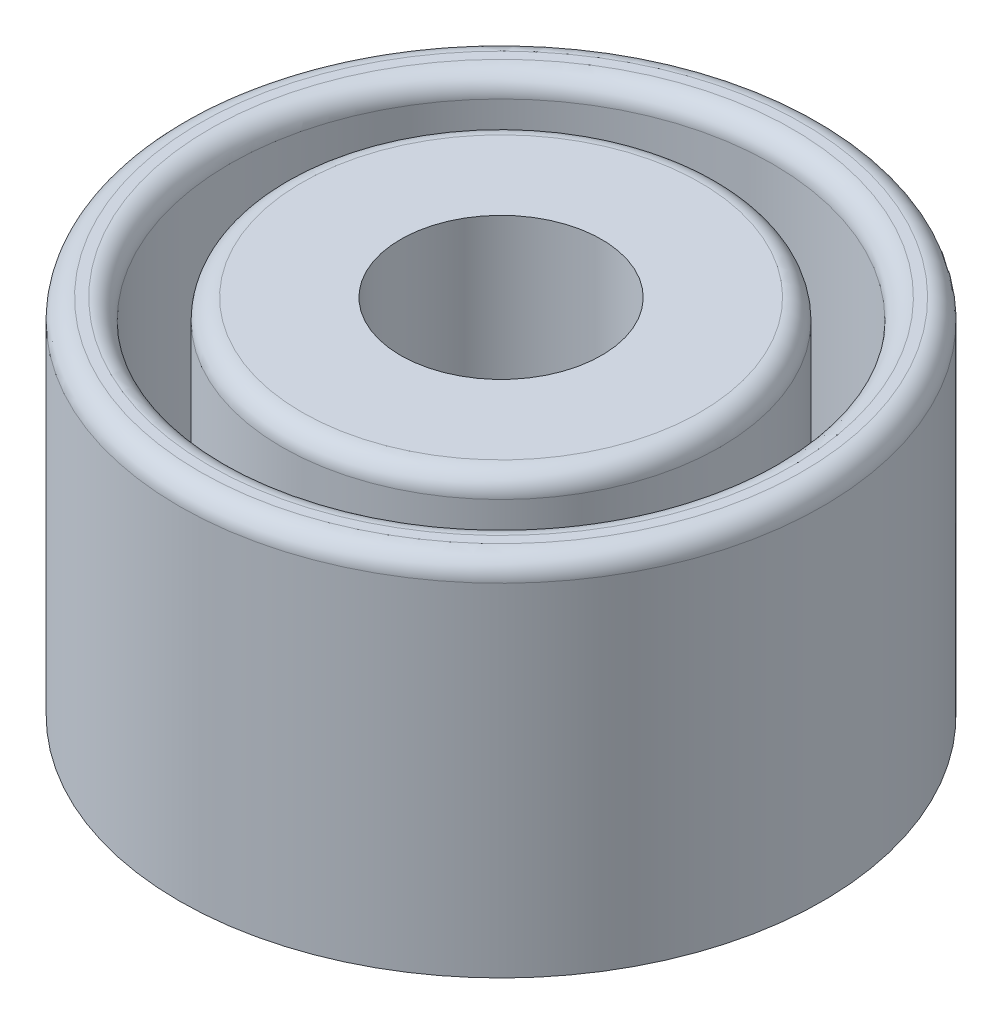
ISO-10303-21;
HEADER;
FILE_DESCRIPTION(('STEP AP214'),'2;1');
FILE_NAME('part.step','',(''),(''),'','','');
FILE_SCHEMA(('AUTOMOTIVE_DESIGN { 1 0 10303 214 1 1 1 1 }'));
ENDSEC;
DATA;
#1=APPLICATION_CONTEXT('core data for automotive mechanical design processes');
#2=APPLICATION_PROTOCOL_DEFINITION('international standard','automotive_design',2000,#1);
#3=PRODUCT_CONTEXT('',#1,'mechanical');
#4=PRODUCT('Part','Part','',(#3));
#5=PRODUCT_RELATED_PRODUCT_CATEGORY('part','',(#4));
#6=PRODUCT_DEFINITION_FORMATION('','',#4);
#7=PRODUCT_DEFINITION_CONTEXT('part definition',#1,'design');
#8=PRODUCT_DEFINITION('design','',#6,#7);
#9=PRODUCT_DEFINITION_SHAPE('','',#8);
#10=(LENGTH_UNIT() NAMED_UNIT(*) SI_UNIT(.MILLI.,.METRE.));
#11=(NAMED_UNIT(*) PLANE_ANGLE_UNIT() SI_UNIT($,.RADIAN.));
#12=(NAMED_UNIT(*) SI_UNIT($,.STERADIAN.) SOLID_ANGLE_UNIT());
#13=UNCERTAINTY_MEASURE_WITH_UNIT(LENGTH_MEASURE(1.E-05),#10,'distance_accuracy_value','');
#14=(GEOMETRIC_REPRESENTATION_CONTEXT(3) GLOBAL_UNCERTAINTY_ASSIGNED_CONTEXT((#13)) GLOBAL_UNIT_ASSIGNED_CONTEXT((#10,
#11,#12)) REPRESENTATION_CONTEXT('',''));
#15=CARTESIAN_POINT('',(0.,0.,0.));
#16=DIRECTION('',(0.,0.,1.));
#17=DIRECTION('',(1.,0.,0.));
#18=AXIS2_PLACEMENT_3D('',#15,#16,#17);
#19=CARTESIAN_POINT('',(0.,0.,0.));
#20=DIRECTION('',(0.,1.,0.));
#21=DIRECTION('',(0.,0.,1.));
#22=AXIS2_PLACEMENT_3D('',#19,#20,#21);
#23=PLANE('',#22);
#24=CARTESIAN_POINT('',(9.09210526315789,0.,2.64802631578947));
#25=CARTESIAN_POINT('',(9.09116825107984,0.,2.55252914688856));
#26=CARTESIAN_POINT('',(9.089320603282,0.,2.36422300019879));
#27=CARTESIAN_POINT('',(9.06957576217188,0.,2.0852658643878));
#28=CARTESIAN_POINT('',(9.03960164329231,0.,1.81349343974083));
#29=CARTESIAN_POINT('',(8.99893777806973,0.,1.54999016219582));
#30=CARTESIAN_POINT('',(8.94443270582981,0.,1.29918048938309));
#31=CARTESIAN_POINT('',(8.87911341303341,0.,1.06414466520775));
#32=CARTESIAN_POINT('',(8.80014352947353,0.,0.846574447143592));
#33=CARTESIAN_POINT('',(8.736209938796,0.,0.710980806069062));
#34=CARTESIAN_POINT('',(8.70497532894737,0.,0.644736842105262));
#35=B_SPLINE_CURVE_WITH_KNOTS('',3,(#24,#25,#26,#27,#28,#29,#30,#31,#32,#33,#34),.UNSPECIFIED.,
.F.,.F.,(4,1,1,1,1,1,1,1,4),(0.,0.139214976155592,0.274511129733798,0.407517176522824,
0.537801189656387,0.663054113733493,0.781514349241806,0.893259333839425,1.),.UNSPECIFIED.);
#36=CARTESIAN_POINT('',(9.09210526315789,0.,2.64802631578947));
#37=VERTEX_POINT('',#36);
#38=CARTESIAN_POINT('',(8.70497532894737,0.,0.644736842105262));
#39=VERTEX_POINT('',#38);
#40=EDGE_CURVE('E69',#37,#39,#35,.T.);
#41=ORIENTED_EDGE('',*,*,#40,.T.);
#42=DIRECTION('',(-1.,0.,0.));
#43=VECTOR('',#42,1.);
#44=CARTESIAN_POINT('',(8.70497532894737,0.,0.644736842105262));
#45=LINE('',#44,#43);
#46=CARTESIAN_POINT('',(7.1578947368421,0.,0.644736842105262));
#47=VERTEX_POINT('',#46);
#48=EDGE_CURVE('E2208',#39,#47,#45,.T.);
#49=ORIENTED_EDGE('',*,*,#48,.T.);
#50=CARTESIAN_POINT('',(7.1578947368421,0.,0.644736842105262));
#51=CARTESIAN_POINT('',(7.21681885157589,0.,0.716634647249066));
#52=CARTESIAN_POINT('',(7.33329682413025,0.,0.858758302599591));
#53=CARTESIAN_POINT('',(7.48273978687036,0.,1.08773048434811));
#54=CARTESIAN_POINT('',(7.61078880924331,0.,1.32472034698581));
#55=CARTESIAN_POINT('',(7.71351183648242,0.,1.57048094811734));
#56=CARTESIAN_POINT('',(7.79466857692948,0.,1.82129273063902));
#57=CARTESIAN_POINT('',(7.85167071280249,0.,2.07421175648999));
#58=CARTESIAN_POINT('',(7.88820614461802,0.,2.32843095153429));
#59=CARTESIAN_POINT('',(7.89255771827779,0.,2.49823337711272));
#60=CARTESIAN_POINT('',(7.89473684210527,0.,2.58326480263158));
#61=B_SPLINE_CURVE_WITH_KNOTS('',3,(#50,#51,#52,#53,#54,#55,#56,#57,#58,#59,#60),.UNSPECIFIED.,
.F.,.F.,(4,1,1,1,1,1,1,1,4),(0.,0.131600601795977,0.260140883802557,0.386616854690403,
0.512699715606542,0.636913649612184,0.75956376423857,0.87959750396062,1.),.UNSPECIFIED.);
#62=CARTESIAN_POINT('',(7.89473684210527,0.,2.58326480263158));
#63=VERTEX_POINT('',#62);
#64=EDGE_CURVE('E2215',#47,#63,#61,.T.);
#65=ORIENTED_EDGE('',*,*,#64,.T.);
#66=CARTESIAN_POINT('',(7.89473684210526,0.,2.58326480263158));
#67=CARTESIAN_POINT('',(7.89451433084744,0.,2.6317494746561));
#68=CARTESIAN_POINT('',(7.89408402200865,0.,2.72551274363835));
#69=CARTESIAN_POINT('',(7.88147548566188,0.,2.86088291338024));
#70=CARTESIAN_POINT('',(7.86512503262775,0.,2.9869854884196));
#71=CARTESIAN_POINT('',(7.84024365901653,0.,3.10366256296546));
#72=CARTESIAN_POINT('',(7.81064358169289,0.,3.21159065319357));
#73=CARTESIAN_POINT('',(7.77437432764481,0.,3.31019618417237));
#74=CARTESIAN_POINT('',(7.7332221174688,0.,3.39969973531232));
#75=CARTESIAN_POINT('',(7.68519412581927,0.,3.47929928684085));
#76=CARTESIAN_POINT('',(7.63357632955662,0.,3.54951095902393));
#77=CARTESIAN_POINT('',(7.57883236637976,0.,3.61223606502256));
#78=CARTESIAN_POINT('',(7.516159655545,0.,3.66158648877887));
#79=CARTESIAN_POINT('',(7.43070076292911,0.,3.71776464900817));
#80=CARTESIAN_POINT('',(7.3110825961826,0.,3.76548999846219));
#81=CARTESIAN_POINT('',(7.21017691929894,0.,3.77268863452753));
#82=CARTESIAN_POINT('',(7.15933388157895,0.,3.77631578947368));
#83=B_SPLINE_CURVE_WITH_KNOTS('',3,(#66,#67,#68,#69,#70,#71,#72,#73,#74,#75,#76,#77,#78,#79,#80,
#81,#82),.UNSPECIFIED.,.F.,.F.,(4,1,1,1,1,1,1,1,1,1,1,1,1,1,4),(0.,0.093082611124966,
0.180010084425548,0.260933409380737,0.337195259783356,0.40896035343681,0.475717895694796,
0.53878702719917,0.597887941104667,0.653913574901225,0.706102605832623,0.757190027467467,
0.806518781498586,0.902511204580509,1.),.UNSPECIFIED.);
#84=CARTESIAN_POINT('',(7.15933388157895,0.,3.77631578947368));
#85=VERTEX_POINT('',#84);
#86=EDGE_CURVE('E2221',#63,#85,#83,.T.);
#87=ORIENTED_EDGE('',*,*,#86,.T.);
#88=CARTESIAN_POINT('',(7.15933388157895,0.,3.77631578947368));
#89=CARTESIAN_POINT('',(7.12612850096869,0.,3.77495413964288));
#90=CARTESIAN_POINT('',(7.06090453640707,0.,3.77227950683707));
#91=CARTESIAN_POINT('',(6.96566255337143,0.,3.75044061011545));
#92=CARTESIAN_POINT('',(6.87718103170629,0.,3.71156594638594));
#93=CARTESIAN_POINT('',(6.792917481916,0.,3.66138774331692));
#94=CARTESIAN_POINT('',(6.71500814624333,0.,3.59585644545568));
#95=CARTESIAN_POINT('',(6.63893107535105,0.,3.52173783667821));
#96=CARTESIAN_POINT('',(6.56650208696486,0.,3.43571902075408));
#97=CARTESIAN_POINT('',(6.47272315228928,0.,3.30314702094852));
#98=CARTESIAN_POINT('',(6.35949014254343,0.,3.11212556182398));
#99=CARTESIAN_POINT('',(6.23251438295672,0.,2.85453861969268));
#100=CARTESIAN_POINT('',(6.10819856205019,0.,2.56704439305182));
#101=CARTESIAN_POINT('',(6.02503643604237,0.,2.36701631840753));
#102=CARTESIAN_POINT('',(5.9821134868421,0.,2.26377467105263));
#103=B_SPLINE_CURVE_WITH_KNOTS('',3,(#88,#89,#90,#91,#92,#93,#94,#95,#96,#97,#98,#99,#100,#101,
#102),.UNSPECIFIED.,.F.,.F.,(4,1,1,1,1,1,1,1,1,1,1,1,4),(0.,0.0492404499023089,
0.0967209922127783,0.143917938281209,0.192134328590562,0.241713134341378,0.294561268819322,
0.349606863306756,0.408270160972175,0.535341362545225,0.678580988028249,0.834104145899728,1.),.UNSPECIFIED.);
#104=CARTESIAN_POINT('',(5.9821134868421,0.,2.26377467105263));
#105=VERTEX_POINT('',#104);
#106=EDGE_CURVE('E2230',#85,#105,#103,.T.);
#107=ORIENTED_EDGE('',*,*,#106,.T.);
#108=CARTESIAN_POINT('',(5.9821134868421,0.,2.26377467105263));
#109=CARTESIAN_POINT('',(5.95330879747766,0.,2.1978509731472));
#110=CARTESIAN_POINT('',(5.8971020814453,0.,2.06921377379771));
#111=CARTESIAN_POINT('',(5.80670693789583,0.,1.88335280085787));
#112=CARTESIAN_POINT('',(5.70879127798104,0.,1.71213848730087));
#113=CARTESIAN_POINT('',(5.60839474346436,0.,1.55212654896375));
#114=CARTESIAN_POINT('',(5.50137516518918,0.,1.40743371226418));
#115=CARTESIAN_POINT('',(5.39185760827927,0.,1.27297533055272));
#116=CARTESIAN_POINT('',(5.27581693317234,0.,1.15322914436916));
#117=CARTESIAN_POINT('',(5.15567150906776,0.,1.04518304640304));
#118=CARTESIAN_POINT('',(5.02934852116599,0.,0.950988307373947));
#119=CARTESIAN_POINT('',(4.89710024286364,0.,0.868826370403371));
#120=CARTESIAN_POINT('',(4.75838106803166,0.,0.799363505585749));
#121=CARTESIAN_POINT('',(4.61319311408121,0.,0.743155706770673));
#122=CARTESIAN_POINT('',(4.46215654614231,0.,0.698310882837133));
#123=CARTESIAN_POINT('',(4.30418687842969,0.,0.666767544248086));
#124=CARTESIAN_POINT('',(4.14000684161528,0.,0.647627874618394));
#125=CARTESIAN_POINT('',(4.02828697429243,0.,0.64570966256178));
#126=CARTESIAN_POINT('',(3.97162828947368,0.,0.644736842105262));
#127=B_SPLINE_CURVE_WITH_KNOTS('',3,(#108,#109,#110,#111,#112,#113,#114,#115,#116,#117,#118,
#119,#120,#121,#122,#123,#124,#125,#126),.UNSPECIFIED.,.F.,.F.,(4,1,1,1,1,1,1,1,1,1,1,1,1,1,1,1,
4),(0.,0.0781747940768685,0.152542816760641,0.224441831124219,0.292408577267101,
0.357677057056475,0.419882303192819,0.48071159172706,0.538677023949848,0.595288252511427,
0.651704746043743,0.707654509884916,0.763606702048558,0.820676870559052,0.878642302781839,
0.938453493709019,1.),.UNSPECIFIED.);
#128=CARTESIAN_POINT('',(3.97162828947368,0.,0.644736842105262));
#129=VERTEX_POINT('',#128);
#130=EDGE_CURVE('E2239',#105,#129,#127,.T.);
#131=ORIENTED_EDGE('',*,*,#130,.T.);
#132=CARTESIAN_POINT('',(3.97162828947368,0.,0.644736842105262));
#133=CARTESIAN_POINT('',(3.884161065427,0.,0.647547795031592));
#134=CARTESIAN_POINT('',(3.71496444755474,0.,0.65298530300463));
#135=CARTESIAN_POINT('',(3.47005827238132,0.,0.693557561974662));
#136=CARTESIAN_POINT('',(3.24414206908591,0.,0.762083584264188));
#137=CARTESIAN_POINT('',(3.03818348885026,0.,0.8598600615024));
#138=CARTESIAN_POINT('',(2.85081953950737,0.,0.980829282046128));
#139=CARTESIAN_POINT('',(2.68071452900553,0.,1.12193373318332));
#140=CARTESIAN_POINT('',(2.52815406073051,0.,1.28379590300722));
#141=CARTESIAN_POINT('',(2.39302261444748,0.,1.46413698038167));
#142=CARTESIAN_POINT('',(2.27483008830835,0.,1.66212223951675));
#143=CARTESIAN_POINT('',(2.17462336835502,0.,1.87616810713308));
#144=CARTESIAN_POINT('',(2.08916060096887,0.,2.1040947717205));
#145=CARTESIAN_POINT('',(2.02236901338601,0.,2.34658143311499));
#146=CARTESIAN_POINT('',(1.97102874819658,0.,2.59961708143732));
#147=CARTESIAN_POINT('',(1.93601740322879,0.,2.86172480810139));
#148=CARTESIAN_POINT('',(1.91145497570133,0.,3.13015376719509));
#149=CARTESIAN_POINT('',(1.90908852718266,0.,3.31189514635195));
#150=CARTESIAN_POINT('',(1.9078947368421,0.,3.40357730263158));
#151=B_SPLINE_CURVE_WITH_KNOTS('',3,(#132,#133,#134,#135,#136,#137,#138,#139,#140,#141,#142,
#143,#144,#145,#146,#147,#148,#149,#150),.UNSPECIFIED.,.F.,.F.,(4,1,1,1,1,1,1,1,1,1,1,1,1,1,1,1,
4),(0.,0.0675745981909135,0.130716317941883,0.191225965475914,0.249435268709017,
0.30630333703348,0.363168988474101,0.419814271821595,0.477796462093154,0.536989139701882,
0.597684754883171,0.660210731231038,0.72488475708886,0.791847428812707,0.859586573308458,
0.929166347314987,1.),.UNSPECIFIED.);
#152=CARTESIAN_POINT('',(1.9078947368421,0.,3.40357730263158));
#153=VERTEX_POINT('',#152);
#154=EDGE_CURVE('E2248',#129,#153,#151,.T.);
#155=ORIENTED_EDGE('',*,*,#154,.T.);
#156=CARTESIAN_POINT('',(1.9078947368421,0.,3.40357730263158));
#157=CARTESIAN_POINT('',(1.90881510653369,0.,3.49233511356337));
#158=CARTESIAN_POINT('',(1.91060192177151,0.,3.66465044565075));
#159=CARTESIAN_POINT('',(1.92176127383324,0.,3.9157501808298));
#160=CARTESIAN_POINT('',(1.94190942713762,0.,4.15094940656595));
#161=CARTESIAN_POINT('',(1.96911083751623,0.,4.3723681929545));
#162=CARTESIAN_POINT('',(2.00494593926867,0.,4.58182655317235));
#163=CARTESIAN_POINT('',(2.05020765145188,0.,4.7817961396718));
#164=CARTESIAN_POINT('',(2.10044682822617,0.,4.97425319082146));
#165=CARTESIAN_POINT('',(2.14401456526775,0.,5.09723942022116));
#166=CARTESIAN_POINT('',(2.16550164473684,0.,5.1578947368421));
#167=B_SPLINE_CURVE_WITH_KNOTS('',3,(#156,#157,#158,#159,#160,#161,#162,#163,#164,#165,#166),
.UNSPECIFIED.,.F.,.F.,(4,1,1,1,1,1,1,1,4),(0.,0.149404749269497,0.290055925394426,
0.422965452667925,0.546658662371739,0.6654718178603,0.78046999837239,0.891730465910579,1.),.UNSPECIFIED.);
#168=CARTESIAN_POINT('',(2.16550164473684,0.,5.1578947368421));
#169=VERTEX_POINT('',#168);
#170=EDGE_CURVE('E2257',#153,#169,#167,.T.);
#171=ORIENTED_EDGE('',*,*,#170,.T.);
#172=DIRECTION('',(1.,0.,0.));
#173=VECTOR('',#172,1.);
#174=CARTESIAN_POINT('',(2.16550164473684,0.,5.1578947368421));
#175=LINE('',#174,#173);
#176=CARTESIAN_POINT('',(3.56578947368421,0.,5.1578947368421));
#177=VERTEX_POINT('',#176);
#178=EDGE_CURVE('E2266',#169,#177,#175,.T.);
#179=ORIENTED_EDGE('',*,*,#178,.T.);
#180=CARTESIAN_POINT('',(3.56578947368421,0.,5.15789473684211));
#181=CARTESIAN_POINT('',(3.52860301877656,0.,5.09714969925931));
#182=CARTESIAN_POINT('',(3.45262013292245,0.,4.97302968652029));
#183=CARTESIAN_POINT('',(3.36018606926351,0.,4.77197216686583));
#184=CARTESIAN_POINT('',(3.27905419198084,0.,4.56112791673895));
#185=CARTESIAN_POINT('',(3.21573536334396,0.,4.34313632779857));
#186=CARTESIAN_POINT('',(3.16450035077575,0.,4.12323704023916));
#187=CARTESIAN_POINT('',(3.13115671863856,0.,3.9051942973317));
#188=CARTESIAN_POINT('',(3.11000503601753,0.,3.69326062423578));
#189=CARTESIAN_POINT('',(3.10681960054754,0.,3.55473366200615));
#190=CARTESIAN_POINT('',(3.10526315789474,0.,3.48704769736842));
#191=B_SPLINE_CURVE_WITH_KNOTS('',3,(#180,#181,#182,#183,#184,#185,#186,#187,#188,#189,#190),
.UNSPECIFIED.,.F.,.F.,(4,1,1,1,1,1,1,1,4),(0.,0.121648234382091,0.248563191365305,
0.377551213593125,0.507536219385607,0.63623461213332,0.763226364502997,0.884309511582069,1.),.UNSPECIFIED.);
#192=CARTESIAN_POINT('',(3.10526315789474,0.,3.48704769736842));
#193=VERTEX_POINT('',#192);
#194=EDGE_CURVE('E2273',#177,#193,#191,.T.);
#195=ORIENTED_EDGE('',*,*,#194,.T.);
#196=CARTESIAN_POINT('',(3.10526315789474,0.,3.48704769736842));
#197=CARTESIAN_POINT('',(3.1074370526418,0.,3.40101668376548));
#198=CARTESIAN_POINT('',(3.11161698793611,0.,3.23559741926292));
#199=CARTESIAN_POINT('',(3.15157773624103,0.,3.00170205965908));
#200=CARTESIAN_POINT('',(3.21588583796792,0.,2.79746022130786));
#201=CARTESIAN_POINT('',(3.29945014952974,0.,2.62367439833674));
#202=CARTESIAN_POINT('',(3.40752654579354,0.,2.48591325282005));
#203=CARTESIAN_POINT('',(3.51323893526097,0.,2.39722352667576));
#204=CARTESIAN_POINT('',(3.60713508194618,0.,2.34805258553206));
#205=CARTESIAN_POINT('',(3.68153623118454,0.,2.32293142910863));
#206=CARTESIAN_POINT('',(3.75980055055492,0.,2.30589101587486));
#207=CARTESIAN_POINT('',(3.81322904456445,0.,2.30373748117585));
#208=CARTESIAN_POINT('',(3.84066611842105,0.,2.30263157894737));
#209=B_SPLINE_CURVE_WITH_KNOTS('',3,(#196,#197,#198,#199,#200,#201,#202,#203,#204,#205,#206,
#207,#208),.UNSPECIFIED.,.F.,.F.,(4,1,1,1,1,1,1,1,1,1,4),(0.,0.166646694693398,
0.320426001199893,0.458044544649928,0.580712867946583,0.691948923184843,0.795053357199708,
0.845375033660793,0.896540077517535,0.946870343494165,1.),.UNSPECIFIED.);
#210=CARTESIAN_POINT('',(3.84066611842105,0.,2.30263157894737));
#211=VERTEX_POINT('',#210);
#212=EDGE_CURVE('E2279',#193,#211,#209,.T.);
#213=ORIENTED_EDGE('',*,*,#212,.T.);
#214=CARTESIAN_POINT('',(3.84066611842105,0.,2.30263157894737));
#215=CARTESIAN_POINT('',(3.86905559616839,0.,2.30370908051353));
#216=CARTESIAN_POINT('',(3.92493961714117,0.,2.30583011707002));
#217=CARTESIAN_POINT('',(4.00608702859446,0.,2.32342791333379));
#218=CARTESIAN_POINT('',(4.08253763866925,0.,2.35298540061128));
#219=CARTESIAN_POINT('',(4.18109801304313,0.,2.40863251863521));
#220=CARTESIAN_POINT('',(4.29681001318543,0.,2.50830501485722));
#221=CARTESIAN_POINT('',(4.42456081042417,0.,2.66199130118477));
#222=CARTESIAN_POINT('',(4.54466589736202,0.,2.85333126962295));
#223=CARTESIAN_POINT('',(4.66329686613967,0.,3.07959445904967));
#224=CARTESIAN_POINT('',(4.78336060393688,0.,3.33859928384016));
#225=CARTESIAN_POINT('',(4.86070822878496,0.,3.52370665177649));
#226=CARTESIAN_POINT('',(4.90131578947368,0.,3.62088815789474));
#227=B_SPLINE_CURVE_WITH_KNOTS('',3,(#214,#215,#216,#217,#218,#219,#220,#221,#222,#223,#224,
#225,#226),.UNSPECIFIED.,.F.,.F.,(4,1,1,1,1,1,1,1,1,1,4),(0.,0.0477015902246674,
0.0938994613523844,0.138840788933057,0.185066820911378,0.283597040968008,0.393491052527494,
0.520135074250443,0.662674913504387,0.822904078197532,1.),.UNSPECIFIED.);
#228=CARTESIAN_POINT('',(4.90131578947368,0.,3.62088815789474));
#229=VERTEX_POINT('',#228);
#230=EDGE_CURVE('E2288',#211,#229,#227,.T.);
#231=ORIENTED_EDGE('',*,*,#230,.T.);
#232=CARTESIAN_POINT('',(4.90131578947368,0.,3.62088815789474));
#233=CARTESIAN_POINT('',(4.92999327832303,0.,3.68879145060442));
#234=CARTESIAN_POINT('',(4.98639060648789,0.,3.82233048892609));
#235=CARTESIAN_POINT('',(5.07941390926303,0.,4.01442689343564));
#236=CARTESIAN_POINT('',(5.1721177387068,0.,4.19750163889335));
#237=CARTESIAN_POINT('',(5.26879561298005,0.,4.36988087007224));
#238=CARTESIAN_POINT('',(5.37020123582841,0.,4.53098490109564));
#239=CARTESIAN_POINT('',(5.47863422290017,0.,4.67983487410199));
#240=CARTESIAN_POINT('',(5.59256111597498,0.,4.81681019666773));
#241=CARTESIAN_POINT('',(5.71183156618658,0.,4.94340787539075));
#242=CARTESIAN_POINT('',(5.84068550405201,0.,5.05582368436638));
#243=CARTESIAN_POINT('',(5.97703655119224,0.,5.15613419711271));
#244=CARTESIAN_POINT('',(6.12406534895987,0.,5.23940217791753));
#245=CARTESIAN_POINT('',(6.27911250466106,0.,5.31093965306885));
#246=CARTESIAN_POINT('',(6.44565306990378,0.,5.36801984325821));
#247=CARTESIAN_POINT('',(6.62555187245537,0.,5.40528297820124));
#248=CARTESIAN_POINT('',(6.81749936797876,0.,5.43127038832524));
#249=CARTESIAN_POINT('',(6.95008375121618,0.,5.43321172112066));
#250=CARTESIAN_POINT('',(7.01829769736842,0.,5.43421052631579));
#251=B_SPLINE_CURVE_WITH_KNOTS('',3,(#232,#233,#234,#235,#236,#237,#238,#239,#240,#241,#242,
#243,#244,#245,#246,#247,#248,#249,#250),.UNSPECIFIED.,.F.,.F.,(4,1,1,1,1,1,1,1,1,1,1,1,1,1,1,1,
4),(0.,0.0738745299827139,0.145282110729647,0.213885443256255,0.279554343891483,
0.343320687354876,0.404588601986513,0.46400180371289,0.521821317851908,0.578727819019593,
0.635187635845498,0.691193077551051,0.747783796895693,0.80617634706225,0.867200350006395,
0.931675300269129,1.),.UNSPECIFIED.);
#252=CARTESIAN_POINT('',(7.01829769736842,0.,5.43421052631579));
#253=VERTEX_POINT('',#252);
#254=EDGE_CURVE('E2297',#229,#253,#251,.T.);
#255=ORIENTED_EDGE('',*,*,#254,.T.);
#256=CARTESIAN_POINT('',(7.01829769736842,0.,5.43421052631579));
#257=CARTESIAN_POINT('',(7.1115377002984,0.,5.43157099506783));
#258=CARTESIAN_POINT('',(7.29134084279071,0.,5.42648094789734));
#259=CARTESIAN_POINT('',(7.54894938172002,0.,5.38424239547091));
#260=CARTESIAN_POINT('',(7.78410202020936,0.,5.31635151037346));
#261=CARTESIAN_POINT('',(7.99448711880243,0.,5.21633573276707));
#262=CARTESIAN_POINT('',(8.18478999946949,0.,5.09459820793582));
#263=CARTESIAN_POINT('',(8.35517148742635,0.,4.95150642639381));
#264=CARTESIAN_POINT('',(8.50639110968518,0.,4.78818294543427));
#265=CARTESIAN_POINT('',(8.63883421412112,0.,4.6063552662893));
#266=CARTESIAN_POINT('',(8.75241515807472,0.,4.40645450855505));
#267=CARTESIAN_POINT('',(8.84868995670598,0.,4.19134400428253));
#268=CARTESIAN_POINT('',(8.9284105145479,0.,3.96074260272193));
#269=CARTESIAN_POINT('',(8.98901959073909,0.,3.71576891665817));
#270=CARTESIAN_POINT('',(9.0336156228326,0.,3.45916750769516));
#271=CARTESIAN_POINT('',(9.06946261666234,0.,3.19528591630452));
#272=CARTESIAN_POINT('',(9.08715616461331,0.,2.92362558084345));
#273=CARTESIAN_POINT('',(9.09044231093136,0.,2.74063073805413));
#274=CARTESIAN_POINT('',(9.09210526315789,0.,2.64802631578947));
#275=B_SPLINE_CURVE_WITH_KNOTS('',3,(#256,#257,#258,#259,#260,#261,#262,#263,#264,#265,#266,
#267,#268,#269,#270,#271,#272,#273,#274),.UNSPECIFIED.,.F.,.F.,(4,1,1,1,1,1,1,1,1,1,1,1,1,1,1,1,
4),(0.,0.0709970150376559,0.13690997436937,0.198311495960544,0.256844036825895,
0.313719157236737,0.370013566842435,0.425873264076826,0.482892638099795,0.541008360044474,
0.600716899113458,0.662206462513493,0.726648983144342,0.792747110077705,0.860564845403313,
0.929438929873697,1.),.UNSPECIFIED.);
#276=EDGE_CURVE('E571',#253,#37,#275,.T.);
#277=ORIENTED_EDGE('',*,*,#276,.T.);
#278=EDGE_LOOP('',(#41,#49,#65,#87,#107,#131,#155,#171,#179,#195,#213,#231,#255,#277));
#279=FACE_BOUND('',#278,.T.);
#280=DIRECTION('',(0.816327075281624,0.,0.577589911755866));
#281=VECTOR('',#280,1.);
#282=CARTESIAN_POINT('',(-3.13815789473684,0.,4.13486842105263));
#283=LINE('',#282,#281);
#284=CARTESIAN_POINT('',(-3.13815789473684,0.,4.13486842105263));
#285=VERTEX_POINT('',#284);
#286=CARTESIAN_POINT('',(0.,0.,6.35526315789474));
#287=VERTEX_POINT('',#286);
#288=EDGE_CURVE('E719',#285,#287,#283,.T.);
#289=ORIENTED_EDGE('',*,*,#288,.T.);
#290=DIRECTION('',(0.,0.,-1.));
#291=VECTOR('',#290,1.);
#292=CARTESIAN_POINT('',(0.,0.,6.35526315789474));
#293=LINE('',#292,#291);
#294=CARTESIAN_POINT('',(0.,0.,4.6875));
#295=VERTEX_POINT('',#294);
#296=EDGE_CURVE('E922',#287,#295,#293,.T.);
#297=ORIENTED_EDGE('',*,*,#296,.T.);
#298=DIRECTION('',(-0.836348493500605,0.,-0.548198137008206));
#299=VECTOR('',#298,1.);
#300=CARTESIAN_POINT('',(0.,0.,4.6875));
#301=LINE('',#300,#299);
#302=CARTESIAN_POINT('',(-2.60649671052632,0.,2.97902960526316));
#303=VERTEX_POINT('',#302);
#304=EDGE_CURVE('E926',#295,#303,#301,.T.);
#305=ORIENTED_EDGE('',*,*,#304,.T.);
#306=CARTESIAN_POINT('',(-2.60649671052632,0.,2.97902960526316));
#307=CARTESIAN_POINT('',(-2.62282341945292,0.,2.96934784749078));
#308=CARTESIAN_POINT('',(-2.66162125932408,0.,2.9463406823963));
#309=CARTESIAN_POINT('',(-2.7339685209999,0.,2.91232356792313));
#310=CARTESIAN_POINT('',(-2.82748481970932,0.,2.86944882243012));
#311=CARTESIAN_POINT('',(-2.89833150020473,0.,2.83981398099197));
#312=CARTESIAN_POINT('',(-2.93708881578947,0.,2.82360197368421));
#313=B_SPLINE_CURVE_WITH_KNOTS('',3,(#306,#307,#308,#309,#310,#311,#312),.UNSPECIFIED.,.F.,.F.,
(4,1,1,1,4),(0.,0.155679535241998,0.369947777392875,0.655324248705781,1.),.UNSPECIFIED.);
#314=CARTESIAN_POINT('',(-2.93708881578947,0.,2.82360197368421));
#315=VERTEX_POINT('',#314);
#316=EDGE_CURVE('E930',#303,#315,#313,.T.);
#317=ORIENTED_EDGE('',*,*,#316,.T.);
#318=DIRECTION('',(0.,0.,-1.));
#319=VECTOR('',#318,1.);
#320=CARTESIAN_POINT('',(-2.93708881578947,0.,2.82360197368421));
#321=LINE('',#320,#319);
#322=CARTESIAN_POINT('',(-2.93708881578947,0.,2.80263157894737));
#323=VERTEX_POINT('',#322);
#324=EDGE_CURVE('E936',#315,#323,#321,.T.);
#325=ORIENTED_EDGE('',*,*,#324,.T.);
#326=DIRECTION('',(1.,0.,0.));
#327=VECTOR('',#326,1.);
#328=CARTESIAN_POINT('',(-2.93708881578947,0.,2.80263157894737));
#329=LINE('',#328,#327);
#330=CARTESIAN_POINT('',(0.,0.,2.80263157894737));
#331=VERTEX_POINT('',#330);
#332=EDGE_CURVE('E943',#323,#331,#329,.T.);
#333=ORIENTED_EDGE('',*,*,#332,.T.);
#334=DIRECTION('',(0.,0.,-1.));
#335=VECTOR('',#334,1.);
#336=CARTESIAN_POINT('',(0.,0.,2.80263157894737));
#337=LINE('',#336,#335);
#338=CARTESIAN_POINT('',(0.,0.,1.46052631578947));
#339=VERTEX_POINT('',#338);
#340=EDGE_CURVE('E947',#331,#339,#337,.T.);
#341=ORIENTED_EDGE('',*,*,#340,.T.);
#342=DIRECTION('',(-1.,0.,0.));
#343=VECTOR('',#342,1.);
#344=CARTESIAN_POINT('',(0.,0.,1.46052631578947));
#345=LINE('',#344,#343);
#346=CARTESIAN_POINT('',(-6.,0.,1.46052631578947));
#347=VERTEX_POINT('',#346);
#348=EDGE_CURVE('E951',#339,#347,#345,.T.);
#349=ORIENTED_EDGE('',*,*,#348,.T.);
#350=DIRECTION('',(0.,0.,1.));
#351=VECTOR('',#350,1.);
#352=CARTESIAN_POINT('',(-6.,0.,1.46052631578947));
#353=LINE('',#352,#351);
#354=CARTESIAN_POINT('',(-6.,0.,2.80263157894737));
#355=VERTEX_POINT('',#354);
#356=EDGE_CURVE('E955',#347,#355,#353,.T.);
#357=ORIENTED_EDGE('',*,*,#356,.T.);
#358=DIRECTION('',(1.,0.,0.));
#359=VECTOR('',#358,1.);
#360=CARTESIAN_POINT('',(-6.,0.,2.80263157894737));
#361=LINE('',#360,#359);
#362=CARTESIAN_POINT('',(-3.16282894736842,0.,2.80263157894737));
#363=VERTEX_POINT('',#362);
#364=EDGE_CURVE('E959',#355,#363,#361,.T.);
#365=ORIENTED_EDGE('',*,*,#364,.T.);
#366=DIRECTION('',(0.,0.,1.));
#367=VECTOR('',#366,1.);
#368=CARTESIAN_POINT('',(-3.16282894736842,0.,2.80263157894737));
#369=LINE('',#368,#367);
#370=CARTESIAN_POINT('',(-3.16282894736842,0.,2.82360197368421));
#371=VERTEX_POINT('',#370);
#372=EDGE_CURVE('E963',#363,#371,#369,.T.);
#373=ORIENTED_EDGE('',*,*,#372,.T.);
#374=CARTESIAN_POINT('',(-3.16282894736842,0.,2.82360197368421));
#375=CARTESIAN_POINT('',(-3.18471119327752,0.,2.83286256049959));
#376=CARTESIAN_POINT('',(-3.23268025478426,0.,2.85316311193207));
#377=CARTESIAN_POINT('',(-3.30952280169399,0.,2.89124862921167));
#378=CARTESIAN_POINT('',(-3.39908103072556,0.,2.93663069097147));
#379=CARTESIAN_POINT('',(-3.46302678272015,0.,2.96991680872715));
#380=CARTESIAN_POINT('',(-3.49712171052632,0.,2.98766447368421));
#381=B_SPLINE_CURVE_WITH_KNOTS('',3,(#374,#375,#376,#377,#378,#379,#380),.UNSPECIFIED.,.F.,.F.,
(4,1,1,1,4),(0.,0.191327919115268,0.419418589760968,0.690442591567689,1.),.UNSPECIFIED.);
#382=CARTESIAN_POINT('',(-3.49712171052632,0.,2.98766447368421));
#383=VERTEX_POINT('',#382);
#384=EDGE_CURVE('E967',#371,#383,#381,.T.);
#385=ORIENTED_EDGE('',*,*,#384,.T.);
#386=DIRECTION('',(-0.838415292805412,0.,0.545031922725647));
#387=VECTOR('',#386,1.);
#388=CARTESIAN_POINT('',(-3.49712171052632,0.,2.98766447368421));
#389=LINE('',#388,#387);
#390=CARTESIAN_POINT('',(-6.,0.,4.61472039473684));
#391=VERTEX_POINT('',#390);
#392=EDGE_CURVE('E973',#383,#391,#389,.T.);
#393=ORIENTED_EDGE('',*,*,#392,.T.);
#394=DIRECTION('',(0.,0.,1.));
#395=VECTOR('',#394,1.);
#396=CARTESIAN_POINT('',(-6.,0.,4.61472039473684));
#397=LINE('',#396,#395);
#398=CARTESIAN_POINT('',(-6.,0.,6.19736842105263));
#399=VERTEX_POINT('',#398);
#400=EDGE_CURVE('E980',#391,#399,#397,.T.);
#401=ORIENTED_EDGE('',*,*,#400,.T.);
#402=DIRECTION('',(0.811268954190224,0.,-0.584673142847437));
#403=VECTOR('',#402,1.);
#404=CARTESIAN_POINT('',(-6.,0.,6.19736842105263));
#405=LINE('',#404,#403);
#406=EDGE_CURVE('E984',#399,#285,#405,.T.);
#407=ORIENTED_EDGE('',*,*,#406,.T.);
#408=EDGE_LOOP('',(#289,#297,#305,#317,#325,#333,#341,#349,#357,#365,#373,#385,#393,#401,#407));
#409=FACE_BOUND('',#408,.T.);
#410=DIRECTION('',(1.,0.,0.));
#411=VECTOR('',#410,1.);
#412=CARTESIAN_POINT('',(7.71052631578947,0.,-0.184210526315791));
#413=LINE('',#412,#411);
#414=CARTESIAN_POINT('',(7.71052631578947,0.,-0.184210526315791));
#415=VERTEX_POINT('',#414);
#416=CARTESIAN_POINT('',(9.,0.,-0.184210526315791));
#417=VERTEX_POINT('',#416);
#418=EDGE_CURVE('E759',#415,#417,#413,.T.);
#419=ORIENTED_EDGE('',*,*,#418,.T.);
#420=DIRECTION('',(0.,0.,-1.));
#421=VECTOR('',#420,1.);
#422=CARTESIAN_POINT('',(9.,0.,-0.184210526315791));
#423=LINE('',#422,#421);
#424=CARTESIAN_POINT('',(9.,0.,-4.32894736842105));
#425=VERTEX_POINT('',#424);
#426=EDGE_CURVE('E763',#417,#425,#423,.T.);
#427=ORIENTED_EDGE('',*,*,#426,.T.);
#428=DIRECTION('',(-1.,0.,0.));
#429=VECTOR('',#428,1.);
#430=CARTESIAN_POINT('',(9.,0.,-4.32894736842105));
#431=LINE('',#430,#429);
#432=CARTESIAN_POINT('',(2.,0.,-4.32894736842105));
#433=VERTEX_POINT('',#432);
#434=EDGE_CURVE('E768',#425,#433,#431,.T.);
#435=ORIENTED_EDGE('',*,*,#434,.T.);
#436=DIRECTION('',(0.,0.,1.));
#437=VECTOR('',#436,1.);
#438=CARTESIAN_POINT('',(2.,0.,-4.32894736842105));
#439=LINE('',#438,#437);
#440=CARTESIAN_POINT('',(2.,0.,-0.36842105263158));
#441=VERTEX_POINT('',#440);
#442=EDGE_CURVE('E772',#433,#441,#439,.T.);
#443=ORIENTED_EDGE('',*,*,#442,.T.);
#444=DIRECTION('',(1.,0.,0.));
#445=VECTOR('',#444,1.);
#446=CARTESIAN_POINT('',(2.,0.,-0.36842105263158));
#447=LINE('',#446,#445);
#448=CARTESIAN_POINT('',(3.28947368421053,0.,-0.36842105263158));
#449=VERTEX_POINT('',#448);
#450=EDGE_CURVE('E776',#441,#449,#447,.T.);
#451=ORIENTED_EDGE('',*,*,#450,.T.);
#452=DIRECTION('',(0.,0.,-1.));
#453=VECTOR('',#452,1.);
#454=CARTESIAN_POINT('',(3.28947368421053,0.,-0.36842105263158));
#455=LINE('',#454,#453);
#456=CARTESIAN_POINT('',(3.28947368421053,0.,-2.76315789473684));
#457=VERTEX_POINT('',#456);
#458=EDGE_CURVE('E780',#449,#457,#455,.T.);
#459=ORIENTED_EDGE('',*,*,#458,.T.);
#460=DIRECTION('',(1.,0.,0.));
#461=VECTOR('',#460,1.);
#462=CARTESIAN_POINT('',(3.28947368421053,0.,-2.76315789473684));
#463=LINE('',#462,#461);
#464=CARTESIAN_POINT('',(4.85526315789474,0.,-2.76315789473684));
#465=VERTEX_POINT('',#464);
#466=EDGE_CURVE('E784',#457,#465,#463,.T.);
#467=ORIENTED_EDGE('',*,*,#466,.T.);
#468=DIRECTION('',(0.,0.,1.));
#469=VECTOR('',#468,1.);
#470=CARTESIAN_POINT('',(4.85526315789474,0.,-2.76315789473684));
#471=LINE('',#470,#469);
#472=CARTESIAN_POINT('',(4.85526315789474,0.,-0.55263157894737));
#473=VERTEX_POINT('',#472);
#474=EDGE_CURVE('E788',#465,#473,#471,.T.);
#475=ORIENTED_EDGE('',*,*,#474,.T.);
#476=DIRECTION('',(1.,0.,0.));
#477=VECTOR('',#476,1.);
#478=CARTESIAN_POINT('',(4.85526315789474,0.,-0.55263157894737));
#479=LINE('',#478,#477);
#480=CARTESIAN_POINT('',(6.14473684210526,0.,-0.55263157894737));
#481=VERTEX_POINT('',#480);
#482=EDGE_CURVE('E792',#473,#481,#479,.T.);
#483=ORIENTED_EDGE('',*,*,#482,.T.);
#484=DIRECTION('',(0.,0.,-1.));
#485=VECTOR('',#484,1.);
#486=CARTESIAN_POINT('',(6.14473684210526,0.,-0.55263157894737));
#487=LINE('',#486,#485);
#488=CARTESIAN_POINT('',(6.14473684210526,0.,-2.76315789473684));
#489=VERTEX_POINT('',#488);
#490=EDGE_CURVE('E796',#481,#489,#487,.T.);
#491=ORIENTED_EDGE('',*,*,#490,.T.);
#492=DIRECTION('',(1.,0.,0.));
#493=VECTOR('',#492,1.);
#494=CARTESIAN_POINT('',(6.14473684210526,0.,-2.76315789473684));
#495=LINE('',#494,#493);
#496=CARTESIAN_POINT('',(7.71052631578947,0.,-2.76315789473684));
#497=VERTEX_POINT('',#496);
#498=EDGE_CURVE('E800',#489,#497,#495,.T.);
#499=ORIENTED_EDGE('',*,*,#498,.T.);
#500=DIRECTION('',(0.,0.,1.));
#501=VECTOR('',#500,1.);
#502=CARTESIAN_POINT('',(7.71052631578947,0.,-2.76315789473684));
#503=LINE('',#502,#501);
#504=EDGE_CURVE('E725',#497,#415,#503,.T.);
#505=ORIENTED_EDGE('',*,*,#504,.T.);
#506=EDGE_LOOP('',(#419,#427,#435,#443,#451,#459,#467,#475,#483,#491,#499,#505));
#507=FACE_BOUND('',#506,.T.);
#508=CARTESIAN_POINT('',(0.,0.,0.));
#509=DIRECTION('',(0.,1.,0.));
#510=DIRECTION('',(0.,0.,1.));
#511=AXIS2_PLACEMENT_3D('',#508,#509,#510);
#512=CIRCLE('',#511,16.);
#513=CARTESIAN_POINT('',(0.,0.,16.));
#514=VERTEX_POINT('',#513);
#515=EDGE_CURVE('E1044',#514,#514,#512,.T.);
#516=ORIENTED_EDGE('',*,*,#515,.F.);
#517=EDGE_LOOP('',(#516));
#518=FACE_BOUND('',#517,.T.);
#519=DIRECTION('',(1.,0.,0.));
#520=VECTOR('',#519,1.);
#521=CARTESIAN_POINT('',(-6.,0.,11.8026315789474));
#522=LINE('',#521,#520);
#523=CARTESIAN_POINT('',(-6.,0.,11.8026315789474));
#524=VERTEX_POINT('',#523);
#525=CARTESIAN_POINT('',(-2.61266447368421,0.,11.8026315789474));
#526=VERTEX_POINT('',#525);
#527=EDGE_CURVE('E626',#524,#526,#522,.T.);
#528=ORIENTED_EDGE('',*,*,#527,.T.);
#529=CARTESIAN_POINT('',(-2.61266447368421,0.,11.8026315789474));
#530=CARTESIAN_POINT('',(-2.50405577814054,0.,11.8007077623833));
#531=CARTESIAN_POINT('',(-2.29343936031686,0.,11.7969770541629));
#532=CARTESIAN_POINT('',(-1.9873423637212,0.,11.769079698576));
#533=CARTESIAN_POINT('',(-1.70245163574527,0.,11.7198134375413));
#534=CARTESIAN_POINT('',(-1.43788321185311,0.,11.6527682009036));
#535=CARTESIAN_POINT('',(-1.19504797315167,0.,11.5649293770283));
#536=CARTESIAN_POINT('',(-0.972362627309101,0.,11.4590913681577));
#537=CARTESIAN_POINT('',(-0.771021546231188,0.,11.3325756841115));
#538=CARTESIAN_POINT('',(-0.590535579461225,0.,11.1865841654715));
#539=CARTESIAN_POINT('',(-0.432657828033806,0.,11.019137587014));
#540=CARTESIAN_POINT('',(-0.295084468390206,0.,10.8332431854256));
#541=CARTESIAN_POINT('',(-0.178481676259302,0.,10.6278002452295));
#542=CARTESIAN_POINT('',(-0.0829848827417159,0.,10.4031635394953));
#543=CARTESIAN_POINT('',(-0.0114592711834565,0.,10.1585923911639));
#544=CARTESIAN_POINT('',(0.0421168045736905,0.,9.895877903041));
#545=CARTESIAN_POINT('',(0.0723375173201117,0.,9.61336792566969));
#546=CARTESIAN_POINT('',(0.07669865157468,0.,9.41865549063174));
#547=CARTESIAN_POINT('',(0.0789473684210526,0.,9.31825657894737));
#548=B_SPLINE_CURVE_WITH_KNOTS('',3,(#529,#530,#531,#532,#533,#534,#535,#536,#537,#538,#539,
#540,#541,#542,#543,#544,#545,#546,#547),.UNSPECIFIED.,.F.,.F.,(4,1,1,1,1,1,1,1,1,1,1,1,1,1,1,1,
4),(0.,0.0775603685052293,0.150406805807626,0.219250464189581,0.283850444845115,
0.345066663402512,0.403382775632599,0.459599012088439,0.514496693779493,0.568711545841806,
0.623508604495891,0.679272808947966,0.737033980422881,0.797422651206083,0.860945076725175,
0.9282995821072,1.),.UNSPECIFIED.);
#549=CARTESIAN_POINT('',(0.0789473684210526,0.,9.31825657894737));
#550=VERTEX_POINT('',#549);
#551=EDGE_CURVE('E630',#526,#550,#548,.T.);
#552=ORIENTED_EDGE('',*,*,#551,.T.);
#553=CARTESIAN_POINT('',(0.0789473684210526,0.,9.31825657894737));
#554=CARTESIAN_POINT('',(0.0772694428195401,0.,9.22072149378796));
#555=CARTESIAN_POINT('',(0.0740177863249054,0.,9.03170799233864));
#556=CARTESIAN_POINT('',(0.0428157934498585,0.,8.75760867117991));
#557=CARTESIAN_POINT('',(-0.00880588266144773,0.,8.50252508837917));
#558=CARTESIAN_POINT('',(-0.0794961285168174,0.,8.26558712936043));
#559=CARTESIAN_POINT('',(-0.172799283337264,0.,8.0475686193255));
#560=CARTESIAN_POINT('',(-0.286295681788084,0.,7.84827015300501));
#561=CARTESIAN_POINT('',(-0.420145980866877,0.,7.66726466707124));
#562=CARTESIAN_POINT('',(-0.576515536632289,0.,7.5074759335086));
#563=CARTESIAN_POINT('',(-0.751037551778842,0.,7.36408733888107));
#564=CARTESIAN_POINT('',(-0.948098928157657,0.,7.24180821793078));
#565=CARTESIAN_POINT('',(-1.16539505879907,0.,7.13807594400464));
#566=CARTESIAN_POINT('',(-1.40305884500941,0.,7.05310037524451));
#567=CARTESIAN_POINT('',(-1.66137889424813,0.,6.98821794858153));
#568=CARTESIAN_POINT('',(-1.93944245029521,0.,6.94212196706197));
#569=CARTESIAN_POINT('',(-2.23788490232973,0.,6.91334204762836));
#570=CARTESIAN_POINT('',(-2.44359985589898,0.,6.90974888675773));
#571=CARTESIAN_POINT('',(-2.54975328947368,0.,6.90789473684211));
#572=B_SPLINE_CURVE_WITH_KNOTS('',3,(#553,#554,#555,#556,#557,#558,#559,#560,#561,#562,#563,
#564,#565,#566,#567,#568,#569,#570,#571),.UNSPECIFIED.,.F.,.F.,(4,1,1,1,1,1,1,1,1,1,1,1,1,1,1,1,
4),(0.,0.0715286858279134,0.138615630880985,0.202031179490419,0.262241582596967,
0.319671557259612,0.375604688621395,0.430140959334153,0.484323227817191,0.539206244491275,
0.595447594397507,0.654000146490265,0.715540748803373,0.780285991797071,0.849115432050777,
0.92214024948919,1.),.UNSPECIFIED.);
#573=CARTESIAN_POINT('',(-2.54975328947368,0.,6.90789473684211));
#574=VERTEX_POINT('',#573);
#575=EDGE_CURVE('E637',#550,#574,#572,.T.);
#576=ORIENTED_EDGE('',*,*,#575,.T.);
#577=DIRECTION('',(-1.,0.,0.));
#578=VECTOR('',#577,1.);
#579=CARTESIAN_POINT('',(-2.54975328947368,0.,6.90789473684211));
#580=LINE('',#579,#578);
#581=CARTESIAN_POINT('',(-6.,0.,6.90789473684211));
#582=VERTEX_POINT('',#581);
#583=EDGE_CURVE('E646',#574,#582,#580,.T.);
#584=ORIENTED_EDGE('',*,*,#583,.T.);
#585=DIRECTION('',(0.,0.,1.));
#586=VECTOR('',#585,1.);
#587=CARTESIAN_POINT('',(-6.,0.,6.90789473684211));
#588=LINE('',#587,#586);
#589=CARTESIAN_POINT('',(-6.,0.,8.25));
#590=VERTEX_POINT('',#589);
#591=EDGE_CURVE('E653',#582,#590,#588,.T.);
#592=ORIENTED_EDGE('',*,*,#591,.T.);
#593=DIRECTION('',(1.,0.,0.));
#594=VECTOR('',#593,1.);
#595=CARTESIAN_POINT('',(-6.,0.,8.25));
#596=LINE('',#595,#594);
#597=CARTESIAN_POINT('',(-2.5485197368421,0.,8.25));
#598=VERTEX_POINT('',#597);
#599=EDGE_CURVE('E657',#590,#598,#596,.T.);
#600=ORIENTED_EDGE('',*,*,#599,.T.);
#601=CARTESIAN_POINT('',(-2.5485197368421,0.,8.25));
#602=CARTESIAN_POINT('',(-2.49011316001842,0.,8.25111060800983));
#603=CARTESIAN_POINT('',(-2.3772791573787,0.,8.25325615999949));
#604=CARTESIAN_POINT('',(-2.21322848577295,0.,8.26509207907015));
#605=CARTESIAN_POINT('',(-2.06069722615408,0.,8.28701185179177));
#606=CARTESIAN_POINT('',(-1.91949145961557,0.,8.3182042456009));
#607=CARTESIAN_POINT('',(-1.78893008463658,0.,8.35550589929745));
#608=CARTESIAN_POINT('',(-1.67008631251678,0.,8.4039408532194));
#609=CARTESIAN_POINT('',(-1.56203426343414,0.,8.46066996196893));
#610=CARTESIAN_POINT('',(-1.46513733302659,0.,8.52590779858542));
#611=CARTESIAN_POINT('',(-1.38026276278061,0.,8.60069557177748));
#612=CARTESIAN_POINT('',(-1.30710986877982,0.,8.68440518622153));
#613=CARTESIAN_POINT('',(-1.2429869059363,0.,8.77587496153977));
#614=CARTESIAN_POINT('',(-1.19313091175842,0.,8.87786274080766));
#615=CARTESIAN_POINT('',(-1.15324921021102,0.,8.98739588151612));
#616=CARTESIAN_POINT('',(-1.12461471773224,0.,9.10564850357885));
#617=CARTESIAN_POINT('',(-1.10931373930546,0.,9.23273917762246));
#618=CARTESIAN_POINT('',(-1.10663556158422,0.,9.32027485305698));
#619=CARTESIAN_POINT('',(-1.10526315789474,0.,9.36513157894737));
#620=B_SPLINE_CURVE_WITH_KNOTS('',3,(#601,#602,#603,#604,#605,#606,#607,#608,#609,#610,#611,
#612,#613,#614,#615,#616,#617,#618,#619),.UNSPECIFIED.,.F.,.F.,(4,1,1,1,1,1,1,1,1,1,1,1,1,1,1,1,
4),(0.,0.0841523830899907,0.162571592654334,0.236797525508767,0.30593449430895,
0.370789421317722,0.432172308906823,0.490470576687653,0.546334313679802,0.600055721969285,
0.652941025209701,0.70618014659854,0.760489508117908,0.815959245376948,0.873861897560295,
0.935361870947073,1.),.UNSPECIFIED.);
#621=CARTESIAN_POINT('',(-1.10526315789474,0.,9.36513157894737));
#622=VERTEX_POINT('',#621);
#623=EDGE_CURVE('E661',#598,#622,#620,.T.);
#624=ORIENTED_EDGE('',*,*,#623,.T.);
#625=CARTESIAN_POINT('',(-1.10526315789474,0.,9.36513157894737));
#626=CARTESIAN_POINT('',(-1.10587962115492,0.,9.40961503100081));
#627=CARTESIAN_POINT('',(-1.10707205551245,0.,9.4956600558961));
#628=CARTESIAN_POINT('',(-1.12568745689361,0.,9.62020138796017));
#629=CARTESIAN_POINT('',(-1.15182179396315,0.,9.73666231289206));
#630=CARTESIAN_POINT('',(-1.19030576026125,0.,9.8441443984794));
#631=CARTESIAN_POINT('',(-1.23865474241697,0.,9.94367039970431));
#632=CARTESIAN_POINT('',(-1.29960502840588,0.,10.0335043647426));
#633=CARTESIAN_POINT('',(-1.37037638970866,0.,10.1159306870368));
#634=CARTESIAN_POINT('',(-1.45271579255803,0.,10.1896343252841));
#635=CARTESIAN_POINT('',(-1.54680222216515,0.,10.2527906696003));
#636=CARTESIAN_POINT('',(-1.65045589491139,0.,10.3096383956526));
#637=CARTESIAN_POINT('',(-1.76598742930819,0.,10.3555156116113));
#638=CARTESIAN_POINT('',(-1.89148379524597,0.,10.3954149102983));
#639=CARTESIAN_POINT('',(-2.02830663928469,0.,10.4245650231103));
#640=CARTESIAN_POINT('',(-2.17551665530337,0.,10.4447852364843));
#641=CARTESIAN_POINT('',(-2.33359574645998,0.,10.4592966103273));
#642=CARTESIAN_POINT('',(-2.4428098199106,0.,10.4601076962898));
#643=CARTESIAN_POINT('',(-2.49917763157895,0.,10.4605263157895));
#644=B_SPLINE_CURVE_WITH_KNOTS('',3,(#625,#626,#627,#628,#629,#630,#631,#632,#633,#634,#635,
#636,#637,#638,#639,#640,#641,#642,#643),.UNSPECIFIED.,.F.,.F.,(4,1,1,1,1,1,1,1,1,1,1,1,1,1,1,1,
4),(0.,0.0658237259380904,0.127323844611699,0.186122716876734,0.242374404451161,
0.296034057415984,0.349582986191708,0.402697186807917,0.456615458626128,0.512702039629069,
0.570205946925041,0.631394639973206,0.696504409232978,0.76507725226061,0.838291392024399,
0.916538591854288,1.),.UNSPECIFIED.);
#645=CARTESIAN_POINT('',(-2.49917763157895,0.,10.4605263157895));
#646=VERTEX_POINT('',#645);
#647=EDGE_CURVE('E667',#622,#646,#644,.T.);
#648=ORIENTED_EDGE('',*,*,#647,.T.);
#649=DIRECTION('',(-1.,0.,0.));
#650=VECTOR('',#649,1.);
#651=CARTESIAN_POINT('',(-2.49917763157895,0.,10.4605263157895));
#652=LINE('',#651,#650);
#653=CARTESIAN_POINT('',(-6.,0.,10.4605263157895));
#654=VERTEX_POINT('',#653);
#655=EDGE_CURVE('E676',#646,#654,#652,.T.);
#656=ORIENTED_EDGE('',*,*,#655,.T.);
#657=DIRECTION('',(0.,0.,1.));
#658=VECTOR('',#657,1.);
#659=CARTESIAN_POINT('',(-6.,0.,10.4605263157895));
#660=LINE('',#659,#658);
#661=EDGE_CURVE('E683',#654,#524,#660,.T.);
#662=ORIENTED_EDGE('',*,*,#661,.T.);
#663=EDGE_LOOP('',(#528,#552,#576,#584,#592,#600,#624,#648,#656,#662));
#664=FACE_BOUND('',#663,.T.);
#665=DIRECTION('',(1.,0.,0.));
#666=VECTOR('',#665,1.);
#667=CARTESIAN_POINT('',(-1.5,0.,0.434210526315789));
#668=LINE('',#667,#666);
#669=CARTESIAN_POINT('',(-1.5,0.,0.434210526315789));
#670=VERTEX_POINT('',#669);
#671=CARTESIAN_POINT('',(-0.244243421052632,0.,0.434210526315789));
#672=VERTEX_POINT('',#671);
#673=EDGE_CURVE('E1034',#670,#672,#668,.T.);
#674=ORIENTED_EDGE('',*,*,#673,.T.);
#675=CARTESIAN_POINT('',(-0.244243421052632,0.,0.434210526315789));
#676=CARTESIAN_POINT('',(-0.218442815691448,0.,0.377774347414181));
#677=CARTESIAN_POINT('',(-0.165862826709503,0.,0.262761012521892));
#678=CARTESIAN_POINT('',(-0.0989230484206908,0.,0.0804249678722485));
#679=CARTESIAN_POINT('',(-0.0442825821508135,0.,-0.114886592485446));
#680=CARTESIAN_POINT('',(0.00181139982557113,0.,-0.322341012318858));
#681=CARTESIAN_POINT('',(0.0352611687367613,0.,-0.542951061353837));
#682=CARTESIAN_POINT('',(0.0616417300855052,0.,-0.775366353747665));
#683=CARTESIAN_POINT('',(0.0761936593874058,0.,-1.02078333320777));
#684=CARTESIAN_POINT('',(0.0780135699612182,0.,-1.18830452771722));
#685=CARTESIAN_POINT('',(0.0789473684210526,0.,-1.27425986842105));
#686=B_SPLINE_CURVE_WITH_KNOTS('',3,(#675,#676,#677,#678,#679,#680,#681,#682,#683,#684,#685),
.UNSPECIFIED.,.F.,.F.,(4,1,1,1,1,1,1,1,4),(0.,0.106138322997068,0.216303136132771,
0.331869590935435,0.452882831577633,0.579638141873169,0.713409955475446,0.852950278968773,1.),.UNSPECIFIED.);
#687=CARTESIAN_POINT('',(0.0789473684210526,0.,-1.27425986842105));
#688=VERTEX_POINT('',#687);
#689=EDGE_CURVE('E2394',#672,#688,#686,.T.);
#690=ORIENTED_EDGE('',*,*,#689,.T.);
#691=CARTESIAN_POINT('',(0.0789473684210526,0.,-1.27425986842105));
#692=CARTESIAN_POINT('',(0.0768328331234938,0.,-1.38581196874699));
#693=CARTESIAN_POINT('',(0.0727075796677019,0.,-1.60343930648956));
#694=CARTESIAN_POINT('',(0.0331877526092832,0.,-1.92076982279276));
#695=CARTESIAN_POINT('',(-0.028708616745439,0.,-2.21990142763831));
#696=CARTESIAN_POINT('',(-0.116466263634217,0.,-2.50120940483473));
#697=CARTESIAN_POINT('',(-0.230330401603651,0.,-2.7637102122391));
#698=CARTESIAN_POINT('',(-0.368906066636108,0.,-3.00870818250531));
#699=CARTESIAN_POINT('',(-0.534128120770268,0.,-3.23432064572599));
#700=CARTESIAN_POINT('',(-0.723288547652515,0.,-3.44011453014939));
#701=CARTESIAN_POINT('',(-0.932237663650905,0.,-3.62551973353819));
#702=CARTESIAN_POINT('',(-1.1612122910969,0.,-3.78478536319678));
#703=CARTESIAN_POINT('',(-1.40478986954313,0.,-3.92179609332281));
#704=CARTESIAN_POINT('',(-1.66666540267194,0.,-4.03169818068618));
#705=CARTESIAN_POINT('',(-1.94467353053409,0.,-4.11807499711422));
#706=CARTESIAN_POINT('',(-2.23961652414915,0.,-4.179160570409));
#707=CARTESIAN_POINT('',(-2.5508191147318,0.,-4.21706796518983));
#708=CARTESIAN_POINT('',(-2.7638687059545,0.,-4.22144387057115));
#709=CARTESIAN_POINT('',(-2.87294407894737,0.,-4.22368421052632));
#710=B_SPLINE_CURVE_WITH_KNOTS('',3,(#691,#692,#693,#694,#695,#696,#697,#698,#699,#700,#701,
#702,#703,#704,#705,#706,#707,#708,#709),.UNSPECIFIED.,.F.,.F.,(4,1,1,1,1,1,1,1,1,1,1,1,1,1,1,1,
4),(0.,0.0709009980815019,0.138320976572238,0.202981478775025,0.264916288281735,
0.32533768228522,0.384585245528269,0.443520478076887,0.502736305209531,0.562010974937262,
0.6207626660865,0.679753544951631,0.739385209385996,0.800992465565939,0.864575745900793,
0.930666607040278,1.),.UNSPECIFIED.);
#711=CARTESIAN_POINT('',(-2.87294407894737,0.,-4.22368421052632));
#712=VERTEX_POINT('',#711);
#713=EDGE_CURVE('E2400',#688,#712,#710,.T.);
#714=ORIENTED_EDGE('',*,*,#713,.T.);
#715=CARTESIAN_POINT('',(-2.87294407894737,0.,-4.22368421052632));
#716=CARTESIAN_POINT('',(-2.98944400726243,0.,-4.22131296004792));
#717=CARTESIAN_POINT('',(-3.21747742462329,0.,-4.21667154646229));
#718=CARTESIAN_POINT('',(-3.55062567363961,0.,-4.17346413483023));
#719=CARTESIAN_POINT('',(-3.86697944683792,0.,-4.10470903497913));
#720=CARTESIAN_POINT('',(-4.16705738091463,0.,-4.00884682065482));
#721=CARTESIAN_POINT('',(-4.44964356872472,0.,-3.88346079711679));
#722=CARTESIAN_POINT('',(-4.71572095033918,0.,-3.73084341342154));
#723=CARTESIAN_POINT('',(-4.96443997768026,0.,-3.54984137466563));
#724=CARTESIAN_POINT('',(-5.19432789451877,0.,-3.34285297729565));
#725=CARTESIAN_POINT('',(-5.40271796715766,0.,-3.11456278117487));
#726=CARTESIAN_POINT('',(-5.5833445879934,0.,-2.86625253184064));
#727=CARTESIAN_POINT('',(-5.73756365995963,0.,-2.6025132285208));
#728=CARTESIAN_POINT('',(-5.86218666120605,0.,-2.32174745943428));
#729=CARTESIAN_POINT('',(-5.96061999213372,0.,-2.02525581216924));
#730=CARTESIAN_POINT('',(-6.02844136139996,0.,-1.71175832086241));
#731=CARTESIAN_POINT('',(-6.07200396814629,0.,-1.38198310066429));
#732=CARTESIAN_POINT('',(-6.07659923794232,0.,-1.15639259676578));
#733=CARTESIAN_POINT('',(-6.07894736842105,0.,-1.04111842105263));
#734=B_SPLINE_CURVE_WITH_KNOTS('',3,(#715,#716,#717,#718,#719,#720,#721,#722,#723,#724,#725,
#726,#727,#728,#729,#730,#731,#732,#733),.UNSPECIFIED.,.F.,.F.,(4,1,1,1,1,1,1,1,1,1,1,1,1,1,1,1,
4),(0.,0.0687769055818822,0.13462182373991,0.198022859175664,0.259768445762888,
0.320326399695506,0.380267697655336,0.440597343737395,0.501644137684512,0.562673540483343,
0.62280687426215,0.682659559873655,0.742773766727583,0.803902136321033,0.866828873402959,
0.931951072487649,1.),.UNSPECIFIED.);
#735=CARTESIAN_POINT('',(-6.07894736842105,0.,-1.04111842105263));
#736=VERTEX_POINT('',#735);
#737=EDGE_CURVE('E2409',#712,#736,#734,.T.);
#738=ORIENTED_EDGE('',*,*,#737,.T.);
#739=CARTESIAN_POINT('',(-6.07894736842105,0.,-1.04111842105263));
#740=CARTESIAN_POINT('',(-6.07831079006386,0.,-0.969553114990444));
#741=CARTESIAN_POINT('',(-6.07706244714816,0.,-0.829212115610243));
#742=CARTESIAN_POINT('',(-6.06509810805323,0.,-0.623148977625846));
#743=CARTESIAN_POINT('',(-6.04910485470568,0.,-0.425415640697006));
#744=CARTESIAN_POINT('',(-6.02228067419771,0.,-0.236725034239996));
#745=CARTESIAN_POINT('',(-5.99109861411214,0.,-0.0561990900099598));
#746=CARTESIAN_POINT('',(-5.95091499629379,0.,0.115189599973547));
#747=CARTESIAN_POINT('',(-5.90671623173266,0.,0.278991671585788));
#748=CARTESIAN_POINT('',(-5.86835975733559,0.,0.383058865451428));
#749=CARTESIAN_POINT('',(-5.84950657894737,0.,0.434210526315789));
#750=B_SPLINE_CURVE_WITH_KNOTS('',3,(#739,#740,#741,#742,#743,#744,#745,#746,#747,#748,#749),
.UNSPECIFIED.,.F.,.F.,(4,1,1,1,1,1,1,1,4),(0.,0.14301312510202,0.280451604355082,
0.412440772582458,0.539353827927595,0.661223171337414,0.778440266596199,0.891097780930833,1.),.UNSPECIFIED.);
#751=CARTESIAN_POINT('',(-5.84950657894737,0.,0.434210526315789));
#752=VERTEX_POINT('',#751);
#753=EDGE_CURVE('E2418',#736,#752,#750,.T.);
#754=ORIENTED_EDGE('',*,*,#753,.T.);
#755=DIRECTION('',(1.,0.,0.));
#756=VECTOR('',#755,1.);
#757=CARTESIAN_POINT('',(-5.84950657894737,0.,0.434210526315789));
#758=LINE('',#757,#756);
#759=CARTESIAN_POINT('',(-4.5,0.,0.434210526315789));
#760=VERTEX_POINT('',#759);
#761=EDGE_CURVE('E2427',#752,#760,#758,.T.);
#762=ORIENTED_EDGE('',*,*,#761,.T.);
#763=CARTESIAN_POINT('',(-4.5,0.,0.434210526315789));
#764=CARTESIAN_POINT('',(-4.53159249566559,0.,0.383662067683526));
#765=CARTESIAN_POINT('',(-4.59428702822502,0.,0.283349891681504));
#766=CARTESIAN_POINT('',(-4.67482418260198,0.,0.125403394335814));
#767=CARTESIAN_POINT('',(-4.74262110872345,0.,-0.037570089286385));
#768=CARTESIAN_POINT('',(-4.7985163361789,0.,-0.206160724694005));
#769=CARTESIAN_POINT('',(-4.84136755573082,0.,-0.379862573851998));
#770=CARTESIAN_POINT('',(-4.87234489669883,0.,-0.558728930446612));
#771=CARTESIAN_POINT('',(-4.89126648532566,0.,-0.742599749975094));
#772=CARTESIAN_POINT('',(-4.89357161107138,0.,-0.867142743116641));
#773=CARTESIAN_POINT('',(-4.89473684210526,0.,-0.930098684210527));
#774=B_SPLINE_CURVE_WITH_KNOTS('',3,(#763,#764,#765,#766,#767,#768,#769,#770,#771,#772,#773),
.UNSPECIFIED.,.F.,.F.,(4,1,1,1,1,1,1,1,4),(0.,0.124061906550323,0.24619780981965,
0.368618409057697,0.491254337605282,0.61562599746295,0.740746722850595,0.868948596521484,1.),.UNSPECIFIED.);
#775=CARTESIAN_POINT('',(-4.89473684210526,0.,-0.930098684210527));
#776=VERTEX_POINT('',#775);
#777=EDGE_CURVE('E2434',#760,#776,#774,.T.);
#778=ORIENTED_EDGE('',*,*,#777,.T.);
#779=CARTESIAN_POINT('',(-4.89473684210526,0.,-0.930098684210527));
#780=CARTESIAN_POINT('',(-4.89291720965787,0.,-0.998414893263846));
#781=CARTESIAN_POINT('',(-4.88935470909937,0.,-1.13216527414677));
#782=CARTESIAN_POINT('',(-4.86618864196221,0.,-1.32805784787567));
#783=CARTESIAN_POINT('',(-4.82526635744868,0.,-1.51385555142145));
#784=CARTESIAN_POINT('',(-4.76870791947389,0.,-1.68961375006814));
#785=CARTESIAN_POINT('',(-4.69570828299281,0.,-1.85538049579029));
#786=CARTESIAN_POINT('',(-4.60469641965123,0.,-2.00966623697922));
#787=CARTESIAN_POINT('',(-4.4995551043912,0.,-2.15557867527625));
#788=CARTESIAN_POINT('',(-4.37751748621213,0.,-2.28917192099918));
#789=CARTESIAN_POINT('',(-4.24204038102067,0.,-2.41065112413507));
#790=CARTESIAN_POINT('',(-4.09329062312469,0.,-2.51508597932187));
#791=CARTESIAN_POINT('',(-3.93417985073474,0.,-2.60588941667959));
#792=CARTESIAN_POINT('',(-3.76183342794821,0.,-2.67594875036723));
#793=CARTESIAN_POINT('',(-3.57930424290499,0.,-2.73368327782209));
#794=CARTESIAN_POINT('',(-3.38512043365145,0.,-2.774080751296));
#795=CARTESIAN_POINT('',(-3.17943147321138,0.,-2.79729461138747));
#796=CARTESIAN_POINT('',(-3.03871075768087,0.,-2.80082488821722));
#797=CARTESIAN_POINT('',(-2.96669407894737,0.,-2.80263157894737));
#798=B_SPLINE_CURVE_WITH_KNOTS('',3,(#779,#780,#781,#782,#783,#784,#785,#786,#787,#788,#789,
#790,#791,#792,#793,#794,#795,#796,#797),.UNSPECIFIED.,.F.,.F.,(4,1,1,1,1,1,1,1,1,1,1,1,1,1,1,1,
4),(0.,0.0675727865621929,0.132294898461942,0.194759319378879,0.255465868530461,
0.314640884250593,0.373513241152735,0.432329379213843,0.492215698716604,0.552132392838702,
0.611939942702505,0.671668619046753,0.732924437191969,0.795568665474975,0.86081638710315,
0.928769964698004,1.),.UNSPECIFIED.);
#799=CARTESIAN_POINT('',(-2.96669407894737,0.,-2.80263157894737));
#800=VERTEX_POINT('',#799);
#801=EDGE_CURVE('E2440',#776,#800,#798,.T.);
#802=ORIENTED_EDGE('',*,*,#801,.T.);
#803=CARTESIAN_POINT('',(-2.96669407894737,0.,-2.80263157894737));
#804=CARTESIAN_POINT('',(-2.89752801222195,0.,-2.80146081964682));
#805=CARTESIAN_POINT('',(-2.76247749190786,0.,-2.79917484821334));
#806=CARTESIAN_POINT('',(-2.56554894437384,0.,-2.77403573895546));
#807=CARTESIAN_POINT('',(-2.37824766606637,0.,-2.73902341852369));
#808=CARTESIAN_POINT('',(-2.20292114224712,0.,-2.68336181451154));
#809=CARTESIAN_POINT('',(-2.03728491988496,0.,-2.61626810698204));
#810=CARTESIAN_POINT('',(-1.88370487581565,0.,-2.5316471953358));
#811=CARTESIAN_POINT('',(-1.7409214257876,0.,-2.43212265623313));
#812=CARTESIAN_POINT('',(-1.60888358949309,0.,-2.3190471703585));
#813=CARTESIAN_POINT('',(-1.49038476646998,0.,-2.19212859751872));
#814=CARTESIAN_POINT('',(-1.38782372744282,0.,-2.05295771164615));
#815=CARTESIAN_POINT('',(-1.29966896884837,0.,-1.90443544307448));
#816=CARTESIAN_POINT('',(-1.22724604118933,0.,-1.74545985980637));
#817=CARTESIAN_POINT('',(-1.17350877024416,0.,-1.57494100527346));
#818=CARTESIAN_POINT('',(-1.13453480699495,0.,-1.39448026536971));
#819=CARTESIAN_POINT('',(-1.10853617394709,0.,-1.20346386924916));
#820=CARTESIAN_POINT('',(-1.10637187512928,0.,-1.0724570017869));
#821=CARTESIAN_POINT('',(-1.10526315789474,0.,-1.00534539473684));
#822=B_SPLINE_CURVE_WITH_KNOTS('',3,(#803,#804,#805,#806,#807,#808,#809,#810,#811,#812,#813,
#814,#815,#816,#817,#818,#819,#820,#821),.UNSPECIFIED.,.F.,.F.,(4,1,1,1,1,1,1,1,1,1,1,1,1,1,1,1,
4),(0.,0.0709515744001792,0.138536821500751,0.203513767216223,0.266257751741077,
0.327002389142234,0.386690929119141,0.44581724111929,0.505375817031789,0.564802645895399,
0.62363901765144,0.682487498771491,0.741798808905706,0.802530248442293,0.86561400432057,
0.931157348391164,1.),.UNSPECIFIED.);
#823=CARTESIAN_POINT('',(-1.10526315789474,0.,-1.00534539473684));
#824=VERTEX_POINT('',#823);
#825=EDGE_CURVE('E2449',#800,#824,#822,.T.);
#826=ORIENTED_EDGE('',*,*,#825,.T.);
#827=CARTESIAN_POINT('',(-1.10526315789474,0.,-1.00534539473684));
#828=CARTESIAN_POINT('',(-1.10641531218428,0.,-0.940332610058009));
#829=CARTESIAN_POINT('',(-1.10869520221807,0.,-0.811684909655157));
#830=CARTESIAN_POINT('',(-1.12790184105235,0.,-0.620889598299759));
#831=CARTESIAN_POINT('',(-1.15840414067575,0.,-0.434557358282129));
#832=CARTESIAN_POINT('',(-1.20188122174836,0.,-0.252413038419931));
#833=CARTESIAN_POINT('',(-1.25744347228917,0.,-0.0743218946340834));
#834=CARTESIAN_POINT('',(-1.32569578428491,0.,0.0998859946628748));
#835=CARTESIAN_POINT('',(-1.40519217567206,0.,0.270609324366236));
#836=CARTESIAN_POINT('',(-1.46832731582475,0.,0.379555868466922));
#837=CARTESIAN_POINT('',(-1.5,0.,0.434210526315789));
#838=B_SPLINE_CURVE_WITH_KNOTS('',3,(#827,#828,#829,#830,#831,#832,#833,#834,#835,#836,#837),
.UNSPECIFIED.,.F.,.F.,(4,1,1,1,1,1,1,1,4),(0.,0.129013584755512,0.255292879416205,
0.380206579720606,0.503531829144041,0.626659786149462,0.750179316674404,0.874673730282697,1.),.UNSPECIFIED.);
#839=EDGE_CURVE('E848',#824,#670,#838,.T.);
#840=ORIENTED_EDGE('',*,*,#839,.T.);
#841=EDGE_LOOP('',(#674,#690,#714,#738,#754,#762,#778,#802,#826,#840));
#842=FACE_BOUND('',#841,.T.);
#843=DIRECTION('',(1.,0.,0.));
#844=VECTOR('',#843,1.);
#845=CARTESIAN_POINT('',(-6.,0.,-5.25));
#846=LINE('',#845,#844);
#847=CARTESIAN_POINT('',(-6.,0.,-5.25));
#848=VERTEX_POINT('',#847);
#849=CARTESIAN_POINT('',(0.,0.,-5.25));
#850=VERTEX_POINT('',#849);
#851=EDGE_CURVE('E61',#848,#850,#846,.T.);
#852=ORIENTED_EDGE('',*,*,#851,.T.);
#853=DIRECTION('',(0.,0.,-1.));
#854=VECTOR('',#853,1.);
#855=CARTESIAN_POINT('',(0.,0.,-5.25));
#856=LINE('',#855,#854);
#857=CARTESIAN_POINT('',(0.,0.,-6.60074013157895));
#858=VERTEX_POINT('',#857);
#859=EDGE_CURVE('E549',#850,#858,#856,.T.);
#860=ORIENTED_EDGE('',*,*,#859,.T.);
#861=DIRECTION('',(-0.843502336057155,0.,-0.537125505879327));
#862=VECTOR('',#861,1.);
#863=CARTESIAN_POINT('',(0.,0.,-6.60074013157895));
#864=LINE('',#863,#862);
#865=CARTESIAN_POINT('',(-3.76973684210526,0.,-9.00123355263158));
#866=VERTEX_POINT('',#865);
#867=EDGE_CURVE('E1989',#858,#866,#864,.T.);
#868=ORIENTED_EDGE('',*,*,#867,.T.);
#869=CARTESIAN_POINT('',(-3.76973684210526,0.,-9.00123355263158));
#870=CARTESIAN_POINT('',(-3.8214740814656,0.,-9.03382918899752));
#871=CARTESIAN_POINT('',(-3.91754084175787,0.,-9.09435343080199));
#872=CARTESIAN_POINT('',(-4.05170694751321,0.,-9.17662450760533));
#873=CARTESIAN_POINT('',(-4.16659443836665,0.,-9.2407170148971));
#874=CARTESIAN_POINT('',(-4.23677182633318,0.,-9.27727129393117));
#875=CARTESIAN_POINT('',(-4.26809210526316,0.,-9.29358552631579));
#876=B_SPLINE_CURVE_WITH_KNOTS('',3,(#869,#870,#871,#872,#873,#874,#875),.UNSPECIFIED.,.F.,.F.,
(4,1,1,1,4),(0.,0.317382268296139,0.58932186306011,0.816713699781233,1.),.UNSPECIFIED.);
#877=CARTESIAN_POINT('',(-4.26809210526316,0.,-9.29358552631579));
#878=VERTEX_POINT('',#877);
#879=EDGE_CURVE('E1993',#866,#878,#876,.T.);
#880=ORIENTED_EDGE('',*,*,#879,.T.);
#881=DIRECTION('',(0.,0.,-1.));
#882=VECTOR('',#881,1.);
#883=CARTESIAN_POINT('',(-4.26809210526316,0.,-9.29358552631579));
#884=LINE('',#883,#882);
#885=CARTESIAN_POINT('',(-4.26809210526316,0.,-9.30962171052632));
#886=VERTEX_POINT('',#885);
#887=EDGE_CURVE('E1999',#878,#886,#884,.T.);
#888=ORIENTED_EDGE('',*,*,#887,.T.);
#889=CARTESIAN_POINT('',(-4.26809210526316,0.,-9.30962171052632));
#890=CARTESIAN_POINT('',(-4.23972219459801,0.,-9.307146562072));
#891=CARTESIAN_POINT('',(-4.17971651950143,0.,-9.30191133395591));
#892=CARTESIAN_POINT('',(-4.08440774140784,0.,-9.29377080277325));
#893=CARTESIAN_POINT('',(-3.97861084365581,0.,-9.28996427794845));
#894=CARTESIAN_POINT('',(-3.86270089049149,0.,-9.28443525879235));
#895=CARTESIAN_POINT('',(-3.73644686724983,0.,-9.28086425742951));
#896=CARTESIAN_POINT('',(-3.59950597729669,0.,-9.27890961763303));
#897=CARTESIAN_POINT('',(-3.45190433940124,0.,-9.27559438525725));
#898=CARTESIAN_POINT('',(-3.34991981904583,0.,-9.27607021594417));
#899=CARTESIAN_POINT('',(-3.29728618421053,0.,-9.27631578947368));
#900=B_SPLINE_CURVE_WITH_KNOTS('',3,(#889,#890,#891,#892,#893,#894,#895,#896,#897,#898,#899),
.UNSPECIFIED.,.F.,.F.,(4,1,1,1,1,1,1,1,4),(0.,0.0879217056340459,0.185964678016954,
0.29525430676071,0.414689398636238,0.544227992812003,0.685158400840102,0.837512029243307,1.),.UNSPECIFIED.);
#901=CARTESIAN_POINT('',(-3.29728618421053,0.,-9.27631578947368));
#902=VERTEX_POINT('',#901);
#903=EDGE_CURVE('E2006',#886,#902,#900,.T.);
#904=ORIENTED_EDGE('',*,*,#903,.T.);
#905=DIRECTION('',(1.,0.,0.));
#906=VECTOR('',#905,1.);
#907=CARTESIAN_POINT('',(-3.29728618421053,0.,-9.27631578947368));
#908=LINE('',#907,#906);
#909=CARTESIAN_POINT('',(0.,0.,-9.27631578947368));
#910=VERTEX_POINT('',#909);
#911=EDGE_CURVE('E2012',#902,#910,#908,.T.);
#912=ORIENTED_EDGE('',*,*,#911,.T.);
#913=DIRECTION('',(0.,0.,-1.));
#914=VECTOR('',#913,1.);
#915=CARTESIAN_POINT('',(0.,0.,-9.27631578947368));
#916=LINE('',#915,#914);
#917=CARTESIAN_POINT('',(0.,0.,-10.5394736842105));
#918=VERTEX_POINT('',#917);
#919=EDGE_CURVE('E2019',#910,#918,#916,.T.);
#920=ORIENTED_EDGE('',*,*,#919,.T.);
#921=DIRECTION('',(-1.,0.,0.));
#922=VECTOR('',#921,1.);
#923=CARTESIAN_POINT('',(0.,0.,-10.5394736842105));
#924=LINE('',#923,#922);
#925=CARTESIAN_POINT('',(-6.,0.,-10.5394736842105));
#926=VERTEX_POINT('',#925);
#927=EDGE_CURVE('E2023',#918,#926,#924,.T.);
#928=ORIENTED_EDGE('',*,*,#927,.T.);
#929=DIRECTION('',(0.,0.,1.));
#930=VECTOR('',#929,1.);
#931=CARTESIAN_POINT('',(-6.,0.,-10.5394736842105));
#932=LINE('',#931,#930);
#933=CARTESIAN_POINT('',(-6.,0.,-9.09745065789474));
#934=VERTEX_POINT('',#933);
#935=EDGE_CURVE('E2027',#926,#934,#932,.T.);
#936=ORIENTED_EDGE('',*,*,#935,.T.);
#937=DIRECTION('',(0.845244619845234,0.,0.534379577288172));
#938=VECTOR('',#937,1.);
#939=CARTESIAN_POINT('',(-6.,0.,-9.09745065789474));
#940=LINE('',#939,#938);
#941=CARTESIAN_POINT('',(-2.34745065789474,0.,-6.78824013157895));
#942=VERTEX_POINT('',#941);
#943=EDGE_CURVE('E2031',#934,#942,#940,.T.);
#944=ORIENTED_EDGE('',*,*,#943,.T.);
#945=CARTESIAN_POINT('',(-2.34745065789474,0.,-6.78824013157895));
#946=CARTESIAN_POINT('',(-2.26601416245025,0.,-6.73701231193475));
#947=CARTESIAN_POINT('',(-2.10504572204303,0.,-6.63575473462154));
#948=CARTESIAN_POINT('',(-1.93951590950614,0.,-6.54214114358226));
#949=CARTESIAN_POINT('',(-1.85773026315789,0.,-6.49588815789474));
#950=B_SPLINE_CURVE_WITH_KNOTS('',3,(#945,#946,#947,#948,#949),.UNSPECIFIED.,.F.,.F.,(4,1,4),
(0.,0.505915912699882,1.),.UNSPECIFIED.);
#951=CARTESIAN_POINT('',(-1.85773026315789,0.,-6.49588815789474));
#952=VERTEX_POINT('',#951);
#953=EDGE_CURVE('E2035',#942,#952,#950,.T.);
#954=ORIENTED_EDGE('',*,*,#953,.T.);
#955=DIRECTION('',(0.,0.,1.));
#956=VECTOR('',#955,1.);
#957=CARTESIAN_POINT('',(-1.85773026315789,0.,-6.49588815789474));
#958=LINE('',#957,#956);
#959=CARTESIAN_POINT('',(-1.85773026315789,0.,-6.47985197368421));
#960=VERTEX_POINT('',#959);
#961=EDGE_CURVE('E2041',#952,#960,#958,.T.);
#962=ORIENTED_EDGE('',*,*,#961,.T.);
#963=CARTESIAN_POINT('',(-1.85773026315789,0.,-6.47985197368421));
#964=CARTESIAN_POINT('',(-1.87746071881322,0.,-6.4823587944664));
#965=CARTESIAN_POINT('',(-1.92056861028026,0.,-6.48783579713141));
#966=CARTESIAN_POINT('',(-1.99201853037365,0.,-6.49595384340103));
#967=CARTESIAN_POINT('',(-2.07607883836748,0.,-6.49953917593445));
#968=CARTESIAN_POINT('',(-2.17305805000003,0.,-6.50518929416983));
#969=CARTESIAN_POINT('',(-2.28205569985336,0.,-6.50859172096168));
#970=CARTESIAN_POINT('',(-2.40419313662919,0.,-6.51063091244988));
#971=CARTESIAN_POINT('',(-2.53863741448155,0.,-6.51388283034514));
#972=CARTESIAN_POINT('',(-2.63281030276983,0.,-6.5134057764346));
#973=CARTESIAN_POINT('',(-2.68174342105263,0.,-6.51315789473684));
#974=B_SPLINE_CURVE_WITH_KNOTS('',3,(#963,#964,#965,#966,#967,#968,#969,#970,#971,#972,#973),
.UNSPECIFIED.,.F.,.F.,(4,1,1,1,1,1,1,1,4),(0.,0.0723076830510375,0.15798072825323,
0.261293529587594,0.37803937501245,0.511150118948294,0.65766880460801,0.822121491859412,1.),.UNSPECIFIED.);
#975=CARTESIAN_POINT('',(-2.68174342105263,0.,-6.51315789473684));
#976=VERTEX_POINT('',#975);
#977=EDGE_CURVE('E2048',#960,#976,#974,.T.);
#978=ORIENTED_EDGE('',*,*,#977,.T.);
#979=DIRECTION('',(-1.,0.,0.));
#980=VECTOR('',#979,1.);
#981=CARTESIAN_POINT('',(-2.68174342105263,0.,-6.51315789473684));
#982=LINE('',#981,#980);
#983=CARTESIAN_POINT('',(-6.,0.,-6.51315789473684));
#984=VERTEX_POINT('',#983);
#985=EDGE_CURVE('E2054',#976,#984,#982,.T.);
#986=ORIENTED_EDGE('',*,*,#985,.T.);
#987=DIRECTION('',(0.,0.,1.));
#988=VECTOR('',#987,1.);
#989=CARTESIAN_POINT('',(-6.,0.,-6.51315789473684));
#990=LINE('',#989,#988);
#991=EDGE_CURVE('E545',#984,#848,#990,.T.);
#992=ORIENTED_EDGE('',*,*,#991,.T.);
#993=EDGE_LOOP('',(#852,#860,#868,#880,#888,#904,#912,#920,#928,#936,#944,#954,#962,#978,#986,#992));
#994=FACE_BOUND('',#993,.T.);
#995=ADVANCED_FACE('F45',(#279,#409,#507,#518,#664,#842,#994),#23,.F.);
#996=CARTESIAN_POINT('',(0.,18.,0.));
#997=DIRECTION('',(0.,-1.,0.));
#998=DIRECTION('',(0.,0.,-1.));
#999=AXIS2_PLACEMENT_3D('',#996,#997,#998);
#1000=CYLINDRICAL_SURFACE('',#999,16.);
#1001=CARTESIAN_POINT('',(0.,17.,0.));
#1002=DIRECTION('',(0.,1.,0.));
#1003=DIRECTION('',(0.,0.,1.));
#1004=AXIS2_PLACEMENT_3D('',#1001,#1002,#1003);
#1005=CIRCLE('',#1004,16.);
#1006=CARTESIAN_POINT('',(0.,17.,16.));
#1007=VERTEX_POINT('',#1006);
#1008=EDGE_CURVE('E1059',#1007,#1007,#1005,.F.);
#1009=ORIENTED_EDGE('',*,*,#1008,.T.);
#1010=EDGE_LOOP('',(#1009));
#1011=FACE_BOUND('',#1010,.T.);
#1012=ORIENTED_EDGE('',*,*,#515,.T.);
#1013=EDGE_LOOP('',(#1012));
#1014=FACE_BOUND('',#1013,.T.);
#1015=ADVANCED_FACE('F1083',(#1011,#1014),#1000,.T.);
#1016=CARTESIAN_POINT('',(0.,18.,0.));
#1017=DIRECTION('',(0.,1.,0.));
#1018=DIRECTION('',(0.,0.,1.));
#1019=AXIS2_PLACEMENT_3D('',#1016,#1017,#1018);
#1020=PLANE('',#1019);
#1021=CARTESIAN_POINT('',(0.,18.,0.));
#1022=DIRECTION('',(0.,1.,0.));
#1023=DIRECTION('',(0.,0.,1.));
#1024=AXIS2_PLACEMENT_3D('',#1021,#1022,#1023);
#1025=CIRCLE('',#1024,15.);
#1026=CARTESIAN_POINT('',(0.,18.,15.));
#1027=VERTEX_POINT('',#1026);
#1028=EDGE_CURVE('E1055',#1027,#1027,#1025,.T.);
#1029=ORIENTED_EDGE('',*,*,#1028,.T.);
#1030=EDGE_LOOP('',(#1029));
#1031=FACE_BOUND('',#1030,.T.);
#1032=CARTESIAN_POINT('',(0.,18.,0.));
#1033=DIRECTION('',(0.,1.,0.));
#1034=DIRECTION('',(0.,0.,1.));
#1035=AXIS2_PLACEMENT_3D('',#1032,#1033,#1034);
#1036=CIRCLE('',#1035,14.5);
#1037=CARTESIAN_POINT('',(0.,18.,14.5));
#1038=VERTEX_POINT('',#1037);
#1039=EDGE_CURVE('E1051',#1038,#1038,#1036,.F.);
#1040=ORIENTED_EDGE('',*,*,#1039,.T.);
#1041=EDGE_LOOP('',(#1040));
#1042=FACE_BOUND('',#1041,.T.);
#1043=ADVANCED_FACE('F1089',(#1031,#1042),#1020,.T.);
#1044=CARTESIAN_POINT('',(0.,4.,0.));
#1045=DIRECTION('',(0.,1.,0.));
#1046=DIRECTION('',(0.,0.,1.));
#1047=AXIS2_PLACEMENT_3D('',#1044,#1045,#1046);
#1048=CYLINDRICAL_SURFACE('',#1047,10.9);
#1049=CARTESIAN_POINT('',(0.,17.,0.));
#1050=DIRECTION('',(0.,1.,0.));
#1051=DIRECTION('',(0.,0.,1.));
#1052=AXIS2_PLACEMENT_3D('',#1049,#1050,#1051);
#1053=CIRCLE('',#1052,10.9);
#1054=CARTESIAN_POINT('',(0.,17.,10.9));
#1055=VERTEX_POINT('',#1054);
#1056=EDGE_CURVE('E12',#1055,#1055,#1053,.F.);
#1057=ORIENTED_EDGE('',*,*,#1056,.T.);
#1058=EDGE_LOOP('',(#1057));
#1059=FACE_BOUND('',#1058,.T.);
#1060=CARTESIAN_POINT('',(0.,4.,0.));
#1061=DIRECTION('',(0.,1.,0.));
#1062=DIRECTION('',(0.,0.,1.));
#1063=AXIS2_PLACEMENT_3D('',#1060,#1061,#1062);
#1064=CIRCLE('',#1063,10.9);
#1065=CARTESIAN_POINT('',(0.,4.,10.9));
#1066=VERTEX_POINT('',#1065);
#1067=EDGE_CURVE('E551',#1066,#1066,#1064,.T.);
#1068=ORIENTED_EDGE('',*,*,#1067,.T.);
#1069=EDGE_LOOP('',(#1068));
#1070=FACE_BOUND('',#1069,.T.);
#1071=ADVANCED_FACE('F1109',(#1059,#1070),#1048,.T.);
#1072=CARTESIAN_POINT('',(0.,4.,0.));
#1073=DIRECTION('',(0.,1.,0.));
#1074=DIRECTION('',(0.,0.,1.));
#1075=AXIS2_PLACEMENT_3D('',#1072,#1073,#1074);
#1076=CYLINDRICAL_SURFACE('',#1075,13.5);
#1077=CARTESIAN_POINT('',(0.,17.,0.));
#1078=DIRECTION('',(0.,1.,0.));
#1079=DIRECTION('',(0.,0.,1.));
#1080=AXIS2_PLACEMENT_3D('',#1077,#1078,#1079);
#1081=CIRCLE('',#1080,13.5);
#1082=CARTESIAN_POINT('',(0.,17.,13.5));
#1083=VERTEX_POINT('',#1082);
#1084=EDGE_CURVE('E1063',#1083,#1083,#1081,.T.);
#1085=ORIENTED_EDGE('',*,*,#1084,.T.);
#1086=EDGE_LOOP('',(#1085));
#1087=FACE_BOUND('',#1086,.T.);
#1088=CARTESIAN_POINT('',(0.,4.,0.));
#1089=DIRECTION('',(0.,1.,0.));
#1090=DIRECTION('',(0.,0.,1.));
#1091=AXIS2_PLACEMENT_3D('',#1088,#1089,#1090);
#1092=CIRCLE('',#1091,13.5);
#1093=CARTESIAN_POINT('',(0.,4.,13.5));
#1094=VERTEX_POINT('',#1093);
#1095=EDGE_CURVE('E557',#1094,#1094,#1092,.T.);
#1096=ORIENTED_EDGE('',*,*,#1095,.F.);
#1097=EDGE_LOOP('',(#1096));
#1098=FACE_BOUND('',#1097,.T.);
#1099=ADVANCED_FACE('F1114',(#1087,#1098),#1076,.F.);
#1100=CARTESIAN_POINT('',(0.,4.,0.));
#1101=DIRECTION('',(0.,1.,0.));
#1102=DIRECTION('',(0.,0.,1.));
#1103=AXIS2_PLACEMENT_3D('',#1100,#1101,#1102);
#1104=PLANE('',#1103);
#1105=ORIENTED_EDGE('',*,*,#1067,.F.);
#1106=EDGE_LOOP('',(#1105));
#1107=FACE_BOUND('',#1106,.T.);
#1108=ORIENTED_EDGE('',*,*,#1095,.T.);
#1109=EDGE_LOOP('',(#1108));
#1110=FACE_BOUND('',#1109,.T.);
#1111=ADVANCED_FACE('F1117',(#1107,#1110),#1104,.T.);
#1112=CARTESIAN_POINT('',(0.,18.,0.));
#1113=DIRECTION('',(0.,1.,0.));
#1114=DIRECTION('',(0.,0.,1.));
#1115=AXIS2_PLACEMENT_3D('',#1112,#1113,#1114);
#1116=CIRCLE('',#1115,9.9);
#1117=CARTESIAN_POINT('',(0.,18.,9.9));
#1118=VERTEX_POINT('',#1117);
#1119=EDGE_CURVE('E54',#1118,#1118,#1116,.T.);
#1120=ORIENTED_EDGE('',*,*,#1119,.T.);
#1121=EDGE_LOOP('',(#1120));
#1122=FACE_BOUND('',#1121,.T.);
#1123=CARTESIAN_POINT('',(0.,18.,0.));
#1124=DIRECTION('',(0.,1.,0.));
#1125=DIRECTION('',(0.,0.,1.));
#1126=AXIS2_PLACEMENT_3D('',#1123,#1124,#1125);
#1127=CIRCLE('',#1126,5.);
#1128=CARTESIAN_POINT('',(0.,18.,5.));
#1129=VERTEX_POINT('',#1128);
#1130=EDGE_CURVE('E1039',#1129,#1129,#1127,.T.);
#1131=ORIENTED_EDGE('',*,*,#1130,.F.);
#1132=EDGE_LOOP('',(#1131));
#1133=FACE_BOUND('',#1132,.T.);
#1134=ADVANCED_FACE('F1070',(#1122,#1133),#1020,.T.);
#1135=CARTESIAN_POINT('',(0.,4.,0.));
#1136=DIRECTION('',(0.,1.,0.));
#1137=DIRECTION('',(0.,0.,1.));
#1138=AXIS2_PLACEMENT_3D('',#1135,#1136,#1137);
#1139=CYLINDRICAL_SURFACE('',#1138,5.);
#1140=CARTESIAN_POINT('',(0.,4.,0.));
#1141=DIRECTION('',(0.,1.,0.));
#1142=DIRECTION('',(0.,0.,1.));
#1143=AXIS2_PLACEMENT_3D('',#1140,#1141,#1142);
#1144=CIRCLE('',#1143,5.);
#1145=CARTESIAN_POINT('',(0.,4.,5.));
#1146=VERTEX_POINT('',#1145);
#1147=EDGE_CURVE('E1040',#1146,#1146,#1144,.T.);
#1148=ORIENTED_EDGE('',*,*,#1147,.F.);
#1149=EDGE_LOOP('',(#1148));
#1150=FACE_BOUND('',#1149,.T.);
#1151=ORIENTED_EDGE('',*,*,#1130,.T.);
#1152=EDGE_LOOP('',(#1151));
#1153=FACE_BOUND('',#1152,.T.);
#1154=ADVANCED_FACE('F1127',(#1150,#1153),#1139,.F.);
#1155=CARTESIAN_POINT('',(0.,4.,0.));
#1156=DIRECTION('',(0.,1.,0.));
#1157=DIRECTION('',(0.,0.,1.));
#1158=AXIS2_PLACEMENT_3D('',#1155,#1156,#1157);
#1159=PLANE('',#1158);
#1160=ORIENTED_EDGE('',*,*,#1147,.T.);
#1161=EDGE_LOOP('',(#1160));
#1162=FACE_BOUND('',#1161,.T.);
#1163=ADVANCED_FACE('F1135',(#1162),#1159,.T.);
#1164=CARTESIAN_POINT('',(7.71052631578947,1.,-0.184210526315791));
#1165=DIRECTION('',(0.,0.,-1.));
#1166=DIRECTION('',(-1.,0.,0.));
#1167=AXIS2_PLACEMENT_3D('',#1164,#1165,#1166);
#1168=PLANE('',#1167);
#1169=ORIENTED_EDGE('',*,*,#418,.F.);
#1170=DIRECTION('',(0.,-1.,0.));
#1171=VECTOR('',#1170,1.);
#1172=CARTESIAN_POINT('',(7.71052631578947,1.,-0.184210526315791));
#1173=LINE('',#1172,#1171);
#1174=CARTESIAN_POINT('',(7.71052631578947,1.,-0.184210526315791));
#1175=VERTEX_POINT('',#1174);
#1176=EDGE_CURVE('E758',#1175,#415,#1173,.T.);
#1177=ORIENTED_EDGE('',*,*,#1176,.F.);
#1178=DIRECTION('',(1.,0.,0.));
#1179=VECTOR('',#1178,1.);
#1180=CARTESIAN_POINT('',(7.71052631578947,1.,-0.184210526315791));
#1181=LINE('',#1180,#1179);
#1182=CARTESIAN_POINT('',(9.,1.,-0.184210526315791));
#1183=VERTEX_POINT('',#1182);
#1184=EDGE_CURVE('E720',#1175,#1183,#1181,.T.);
#1185=ORIENTED_EDGE('',*,*,#1184,.T.);
#1186=DIRECTION('',(0.,-1.,0.));
#1187=VECTOR('',#1186,1.);
#1188=CARTESIAN_POINT('',(9.,1.,-0.184210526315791));
#1189=LINE('',#1188,#1187);
#1190=EDGE_CURVE('E631',#1183,#417,#1189,.T.);
#1191=ORIENTED_EDGE('',*,*,#1190,.T.);
#1192=EDGE_LOOP('',(#1169,#1177,#1185,#1191));
#1193=FACE_BOUND('',#1192,.T.);
#1194=ADVANCED_FACE('F1137',(#1193),#1168,.T.);
#1195=CARTESIAN_POINT('',(9.,1.,-0.184210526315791));
#1196=DIRECTION('',(-1.,0.,0.));
#1197=DIRECTION('',(0.,0.,1.));
#1198=AXIS2_PLACEMENT_3D('',#1195,#1196,#1197);
#1199=PLANE('',#1198);
#1200=ORIENTED_EDGE('',*,*,#426,.F.);
#1201=ORIENTED_EDGE('',*,*,#1190,.F.);
#1202=DIRECTION('',(0.,0.,-1.));
#1203=VECTOR('',#1202,1.);
#1204=CARTESIAN_POINT('',(9.,1.,-0.184210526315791));
#1205=LINE('',#1204,#1203);
#1206=CARTESIAN_POINT('',(9.,1.,-4.32894736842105));
#1207=VERTEX_POINT('',#1206);
#1208=EDGE_CURVE('E724',#1183,#1207,#1205,.T.);
#1209=ORIENTED_EDGE('',*,*,#1208,.T.);
#1210=DIRECTION('',(0.,-1.,0.));
#1211=VECTOR('',#1210,1.);
#1212=CARTESIAN_POINT('',(9.,1.,-4.32894736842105));
#1213=LINE('',#1212,#1211);
#1214=EDGE_CURVE('E837',#1207,#425,#1213,.T.);
#1215=ORIENTED_EDGE('',*,*,#1214,.T.);
#1216=EDGE_LOOP('',(#1200,#1201,#1209,#1215));
#1217=FACE_BOUND('',#1216,.T.);
#1218=ADVANCED_FACE('F1158',(#1217),#1199,.T.);
#1219=CARTESIAN_POINT('',(9.,1.,-4.32894736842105));
#1220=DIRECTION('',(0.,0.,1.));
#1221=DIRECTION('',(1.,0.,0.));
#1222=AXIS2_PLACEMENT_3D('',#1219,#1220,#1221);
#1223=PLANE('',#1222);
#1224=ORIENTED_EDGE('',*,*,#434,.F.);
#1225=ORIENTED_EDGE('',*,*,#1214,.F.);
#1226=DIRECTION('',(-1.,0.,0.));
#1227=VECTOR('',#1226,1.);
#1228=CARTESIAN_POINT('',(9.,1.,-4.32894736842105));
#1229=LINE('',#1228,#1227);
#1230=CARTESIAN_POINT('',(2.,1.,-4.32894736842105));
#1231=VERTEX_POINT('',#1230);
#1232=EDGE_CURVE('E728',#1207,#1231,#1229,.T.);
#1233=ORIENTED_EDGE('',*,*,#1232,.T.);
#1234=DIRECTION('',(0.,-1.,0.));
#1235=VECTOR('',#1234,1.);
#1236=CARTESIAN_POINT('',(2.,1.,-4.32894736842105));
#1237=LINE('',#1236,#1235);
#1238=EDGE_CURVE('E834',#1231,#433,#1237,.T.);
#1239=ORIENTED_EDGE('',*,*,#1238,.T.);
#1240=EDGE_LOOP('',(#1224,#1225,#1233,#1239));
#1241=FACE_BOUND('',#1240,.T.);
#1242=ADVANCED_FACE('F1166',(#1241),#1223,.T.);
#1243=CARTESIAN_POINT('',(2.,1.,-4.32894736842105));
#1244=DIRECTION('',(1.,0.,0.));
#1245=DIRECTION('',(0.,0.,-1.));
#1246=AXIS2_PLACEMENT_3D('',#1243,#1244,#1245);
#1247=PLANE('',#1246);
#1248=ORIENTED_EDGE('',*,*,#442,.F.);
#1249=ORIENTED_EDGE('',*,*,#1238,.F.);
#1250=DIRECTION('',(0.,0.,1.));
#1251=VECTOR('',#1250,1.);
#1252=CARTESIAN_POINT('',(2.,1.,-4.32894736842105));
#1253=LINE('',#1252,#1251);
#1254=CARTESIAN_POINT('',(2.,1.,-0.36842105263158));
#1255=VERTEX_POINT('',#1254);
#1256=EDGE_CURVE('E731',#1231,#1255,#1253,.T.);
#1257=ORIENTED_EDGE('',*,*,#1256,.T.);
#1258=DIRECTION('',(0.,-1.,0.));
#1259=VECTOR('',#1258,1.);
#1260=CARTESIAN_POINT('',(2.,1.,-0.36842105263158));
#1261=LINE('',#1260,#1259);
#1262=EDGE_CURVE('E831',#1255,#441,#1261,.T.);
#1263=ORIENTED_EDGE('',*,*,#1262,.T.);
#1264=EDGE_LOOP('',(#1248,#1249,#1257,#1263));
#1265=FACE_BOUND('',#1264,.T.);
#1266=ADVANCED_FACE('F1174',(#1265),#1247,.T.);
#1267=CARTESIAN_POINT('',(2.,1.,-0.36842105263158));
#1268=DIRECTION('',(0.,0.,-1.));
#1269=DIRECTION('',(-1.,0.,0.));
#1270=AXIS2_PLACEMENT_3D('',#1267,#1268,#1269);
#1271=PLANE('',#1270);
#1272=ORIENTED_EDGE('',*,*,#450,.F.);
#1273=ORIENTED_EDGE('',*,*,#1262,.F.);
#1274=DIRECTION('',(1.,0.,0.));
#1275=VECTOR('',#1274,1.);
#1276=CARTESIAN_POINT('',(2.,1.,-0.36842105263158));
#1277=LINE('',#1276,#1275);
#1278=CARTESIAN_POINT('',(3.28947368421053,1.,-0.36842105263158));
#1279=VERTEX_POINT('',#1278);
#1280=EDGE_CURVE('E734',#1255,#1279,#1277,.T.);
#1281=ORIENTED_EDGE('',*,*,#1280,.T.);
#1282=DIRECTION('',(0.,-1.,0.));
#1283=VECTOR('',#1282,1.);
#1284=CARTESIAN_POINT('',(3.28947368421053,1.,-0.36842105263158));
#1285=LINE('',#1284,#1283);
#1286=EDGE_CURVE('E828',#1279,#449,#1285,.T.);
#1287=ORIENTED_EDGE('',*,*,#1286,.T.);
#1288=EDGE_LOOP('',(#1272,#1273,#1281,#1287));
#1289=FACE_BOUND('',#1288,.T.);
#1290=ADVANCED_FACE('F1182',(#1289),#1271,.T.);
#1291=CARTESIAN_POINT('',(3.28947368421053,1.,-0.36842105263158));
#1292=DIRECTION('',(-1.,0.,0.));
#1293=DIRECTION('',(0.,0.,1.));
#1294=AXIS2_PLACEMENT_3D('',#1291,#1292,#1293);
#1295=PLANE('',#1294);
#1296=ORIENTED_EDGE('',*,*,#458,.F.);
#1297=ORIENTED_EDGE('',*,*,#1286,.F.);
#1298=DIRECTION('',(0.,0.,-1.));
#1299=VECTOR('',#1298,1.);
#1300=CARTESIAN_POINT('',(3.28947368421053,1.,-0.36842105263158));
#1301=LINE('',#1300,#1299);
#1302=CARTESIAN_POINT('',(3.28947368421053,1.,-2.76315789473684));
#1303=VERTEX_POINT('',#1302);
#1304=EDGE_CURVE('E737',#1279,#1303,#1301,.T.);
#1305=ORIENTED_EDGE('',*,*,#1304,.T.);
#1306=DIRECTION('',(0.,-1.,0.));
#1307=VECTOR('',#1306,1.);
#1308=CARTESIAN_POINT('',(3.28947368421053,1.,-2.76315789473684));
#1309=LINE('',#1308,#1307);
#1310=EDGE_CURVE('E825',#1303,#457,#1309,.T.);
#1311=ORIENTED_EDGE('',*,*,#1310,.T.);
#1312=EDGE_LOOP('',(#1296,#1297,#1305,#1311));
#1313=FACE_BOUND('',#1312,.T.);
#1314=ADVANCED_FACE('F1190',(#1313),#1295,.T.);
#1315=CARTESIAN_POINT('',(3.28947368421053,1.,-2.76315789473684));
#1316=DIRECTION('',(0.,0.,-1.));
#1317=DIRECTION('',(-1.,0.,0.));
#1318=AXIS2_PLACEMENT_3D('',#1315,#1316,#1317);
#1319=PLANE('',#1318);
#1320=ORIENTED_EDGE('',*,*,#466,.F.);
#1321=ORIENTED_EDGE('',*,*,#1310,.F.);
#1322=DIRECTION('',(1.,0.,0.));
#1323=VECTOR('',#1322,1.);
#1324=CARTESIAN_POINT('',(3.28947368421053,1.,-2.76315789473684));
#1325=LINE('',#1324,#1323);
#1326=CARTESIAN_POINT('',(4.85526315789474,1.,-2.76315789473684));
#1327=VERTEX_POINT('',#1326);
#1328=EDGE_CURVE('E740',#1303,#1327,#1325,.T.);
#1329=ORIENTED_EDGE('',*,*,#1328,.T.);
#1330=DIRECTION('',(0.,-1.,0.));
#1331=VECTOR('',#1330,1.);
#1332=CARTESIAN_POINT('',(4.85526315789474,1.,-2.76315789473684));
#1333=LINE('',#1332,#1331);
#1334=EDGE_CURVE('E822',#1327,#465,#1333,.T.);
#1335=ORIENTED_EDGE('',*,*,#1334,.T.);
#1336=EDGE_LOOP('',(#1320,#1321,#1329,#1335));
#1337=FACE_BOUND('',#1336,.T.);
#1338=ADVANCED_FACE('F1198',(#1337),#1319,.T.);
#1339=CARTESIAN_POINT('',(4.85526315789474,1.,-2.76315789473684));
#1340=DIRECTION('',(1.,0.,0.));
#1341=DIRECTION('',(0.,0.,-1.));
#1342=AXIS2_PLACEMENT_3D('',#1339,#1340,#1341);
#1343=PLANE('',#1342);
#1344=ORIENTED_EDGE('',*,*,#474,.F.);
#1345=ORIENTED_EDGE('',*,*,#1334,.F.);
#1346=DIRECTION('',(0.,0.,1.));
#1347=VECTOR('',#1346,1.);
#1348=CARTESIAN_POINT('',(4.85526315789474,1.,-2.76315789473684));
#1349=LINE('',#1348,#1347);
#1350=CARTESIAN_POINT('',(4.85526315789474,1.,-0.55263157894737));
#1351=VERTEX_POINT('',#1350);
#1352=EDGE_CURVE('E743',#1327,#1351,#1349,.T.);
#1353=ORIENTED_EDGE('',*,*,#1352,.T.);
#1354=DIRECTION('',(0.,-1.,0.));
#1355=VECTOR('',#1354,1.);
#1356=CARTESIAN_POINT('',(4.85526315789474,1.,-0.55263157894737));
#1357=LINE('',#1356,#1355);
#1358=EDGE_CURVE('E819',#1351,#473,#1357,.T.);
#1359=ORIENTED_EDGE('',*,*,#1358,.T.);
#1360=EDGE_LOOP('',(#1344,#1345,#1353,#1359));
#1361=FACE_BOUND('',#1360,.T.);
#1362=ADVANCED_FACE('F1206',(#1361),#1343,.T.);
#1363=CARTESIAN_POINT('',(4.85526315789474,1.,-0.55263157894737));
#1364=DIRECTION('',(0.,0.,-1.));
#1365=DIRECTION('',(-1.,0.,0.));
#1366=AXIS2_PLACEMENT_3D('',#1363,#1364,#1365);
#1367=PLANE('',#1366);
#1368=ORIENTED_EDGE('',*,*,#482,.F.);
#1369=ORIENTED_EDGE('',*,*,#1358,.F.);
#1370=DIRECTION('',(1.,0.,0.));
#1371=VECTOR('',#1370,1.);
#1372=CARTESIAN_POINT('',(4.85526315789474,1.,-0.55263157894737));
#1373=LINE('',#1372,#1371);
#1374=CARTESIAN_POINT('',(6.14473684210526,1.,-0.55263157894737));
#1375=VERTEX_POINT('',#1374);
#1376=EDGE_CURVE('E746',#1351,#1375,#1373,.T.);
#1377=ORIENTED_EDGE('',*,*,#1376,.T.);
#1378=DIRECTION('',(0.,-1.,0.));
#1379=VECTOR('',#1378,1.);
#1380=CARTESIAN_POINT('',(6.14473684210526,1.,-0.55263157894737));
#1381=LINE('',#1380,#1379);
#1382=EDGE_CURVE('E816',#1375,#481,#1381,.T.);
#1383=ORIENTED_EDGE('',*,*,#1382,.T.);
#1384=EDGE_LOOP('',(#1368,#1369,#1377,#1383));
#1385=FACE_BOUND('',#1384,.T.);
#1386=ADVANCED_FACE('F1214',(#1385),#1367,.T.);
#1387=CARTESIAN_POINT('',(6.14473684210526,1.,-0.55263157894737));
#1388=DIRECTION('',(-1.,0.,0.));
#1389=DIRECTION('',(0.,0.,1.));
#1390=AXIS2_PLACEMENT_3D('',#1387,#1388,#1389);
#1391=PLANE('',#1390);
#1392=ORIENTED_EDGE('',*,*,#490,.F.);
#1393=ORIENTED_EDGE('',*,*,#1382,.F.);
#1394=DIRECTION('',(0.,0.,-1.));
#1395=VECTOR('',#1394,1.);
#1396=CARTESIAN_POINT('',(6.14473684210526,1.,-0.55263157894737));
#1397=LINE('',#1396,#1395);
#1398=CARTESIAN_POINT('',(6.14473684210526,1.,-2.76315789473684));
#1399=VERTEX_POINT('',#1398);
#1400=EDGE_CURVE('E749',#1375,#1399,#1397,.T.);
#1401=ORIENTED_EDGE('',*,*,#1400,.T.);
#1402=DIRECTION('',(0.,-1.,0.));
#1403=VECTOR('',#1402,1.);
#1404=CARTESIAN_POINT('',(6.14473684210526,1.,-2.76315789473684));
#1405=LINE('',#1404,#1403);
#1406=EDGE_CURVE('E813',#1399,#489,#1405,.T.);
#1407=ORIENTED_EDGE('',*,*,#1406,.T.);
#1408=EDGE_LOOP('',(#1392,#1393,#1401,#1407));
#1409=FACE_BOUND('',#1408,.T.);
#1410=ADVANCED_FACE('F1222',(#1409),#1391,.T.);
#1411=CARTESIAN_POINT('',(6.14473684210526,1.,-2.76315789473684));
#1412=DIRECTION('',(0.,0.,-1.));
#1413=DIRECTION('',(-1.,0.,0.));
#1414=AXIS2_PLACEMENT_3D('',#1411,#1412,#1413);
#1415=PLANE('',#1414);
#1416=ORIENTED_EDGE('',*,*,#498,.F.);
#1417=ORIENTED_EDGE('',*,*,#1406,.F.);
#1418=DIRECTION('',(1.,0.,0.));
#1419=VECTOR('',#1418,1.);
#1420=CARTESIAN_POINT('',(6.14473684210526,1.,-2.76315789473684));
#1421=LINE('',#1420,#1419);
#1422=CARTESIAN_POINT('',(7.71052631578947,1.,-2.76315789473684));
#1423=VERTEX_POINT('',#1422);
#1424=EDGE_CURVE('E752',#1399,#1423,#1421,.T.);
#1425=ORIENTED_EDGE('',*,*,#1424,.T.);
#1426=DIRECTION('',(0.,-1.,0.));
#1427=VECTOR('',#1426,1.);
#1428=CARTESIAN_POINT('',(7.71052631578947,1.,-2.76315789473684));
#1429=LINE('',#1428,#1427);
#1430=EDGE_CURVE('E810',#1423,#497,#1429,.T.);
#1431=ORIENTED_EDGE('',*,*,#1430,.T.);
#1432=EDGE_LOOP('',(#1416,#1417,#1425,#1431));
#1433=FACE_BOUND('',#1432,.T.);
#1434=ADVANCED_FACE('F1230',(#1433),#1415,.T.);
#1435=CARTESIAN_POINT('',(7.71052631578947,1.,-2.76315789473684));
#1436=DIRECTION('',(1.,0.,0.));
#1437=DIRECTION('',(0.,0.,-1.));
#1438=AXIS2_PLACEMENT_3D('',#1435,#1436,#1437);
#1439=PLANE('',#1438);
#1440=ORIENTED_EDGE('',*,*,#504,.F.);
#1441=ORIENTED_EDGE('',*,*,#1430,.F.);
#1442=DIRECTION('',(0.,0.,1.));
#1443=VECTOR('',#1442,1.);
#1444=CARTESIAN_POINT('',(7.71052631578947,1.,-2.76315789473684));
#1445=LINE('',#1444,#1443);
#1446=EDGE_CURVE('E755',#1423,#1175,#1445,.T.);
#1447=ORIENTED_EDGE('',*,*,#1446,.T.);
#1448=ORIENTED_EDGE('',*,*,#1176,.T.);
#1449=EDGE_LOOP('',(#1440,#1441,#1447,#1448));
#1450=FACE_BOUND('',#1449,.T.);
#1451=ADVANCED_FACE('F1238',(#1450),#1439,.T.);
#1452=CARTESIAN_POINT('',(0.,1.,0.));
#1453=DIRECTION('',(0.,1.,0.));
#1454=DIRECTION('',(0.,0.,1.));
#1455=AXIS2_PLACEMENT_3D('',#1452,#1453,#1454);
#1456=PLANE('',#1455);
#1457=ORIENTED_EDGE('',*,*,#1184,.F.);
#1458=ORIENTED_EDGE('',*,*,#1446,.F.);
#1459=ORIENTED_EDGE('',*,*,#1424,.F.);
#1460=ORIENTED_EDGE('',*,*,#1400,.F.);
#1461=ORIENTED_EDGE('',*,*,#1376,.F.);
#1462=ORIENTED_EDGE('',*,*,#1352,.F.);
#1463=ORIENTED_EDGE('',*,*,#1328,.F.);
#1464=ORIENTED_EDGE('',*,*,#1304,.F.);
#1465=ORIENTED_EDGE('',*,*,#1280,.F.);
#1466=ORIENTED_EDGE('',*,*,#1256,.F.);
#1467=ORIENTED_EDGE('',*,*,#1232,.F.);
#1468=ORIENTED_EDGE('',*,*,#1208,.F.);
#1469=EDGE_LOOP('',(#1457,#1458,#1459,#1460,#1461,#1462,#1463,#1464,#1465,#1466,#1467,#1468));
#1470=FACE_BOUND('',#1469,.T.);
#1471=ADVANCED_FACE('F1246',(#1470),#1456,.F.);
#1472=CARTESIAN_POINT('',(-6.,1.,11.8026315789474));
#1473=DIRECTION('',(0.,0.,-1.));
#1474=DIRECTION('',(-1.,0.,0.));
#1475=AXIS2_PLACEMENT_3D('',#1472,#1473,#1474);
#1476=PLANE('',#1475);
#1477=ORIENTED_EDGE('',*,*,#527,.F.);
#1478=DIRECTION('',(0.,-1.,0.));
#1479=VECTOR('',#1478,1.);
#1480=CARTESIAN_POINT('',(-6.,1.,11.8026315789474));
#1481=LINE('',#1480,#1479);
#1482=CARTESIAN_POINT('',(-6.,1.,11.8026315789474));
#1483=VERTEX_POINT('',#1482);
#1484=EDGE_CURVE('E625',#1483,#524,#1481,.T.);
#1485=ORIENTED_EDGE('',*,*,#1484,.F.);
#1486=DIRECTION('',(1.,0.,0.));
#1487=VECTOR('',#1486,1.);
#1488=CARTESIAN_POINT('',(-6.,1.,11.8026315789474));
#1489=LINE('',#1488,#1487);
#1490=CARTESIAN_POINT('',(-2.61266447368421,1.,11.8026315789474));
#1491=VERTEX_POINT('',#1490);
#1492=EDGE_CURVE('E687',#1483,#1491,#1489,.T.);
#1493=ORIENTED_EDGE('',*,*,#1492,.T.);
#1494=DIRECTION('',(0.,-1.,0.));
#1495=VECTOR('',#1494,1.);
#1496=CARTESIAN_POINT('',(-2.61266447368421,1.,11.8026315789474));
#1497=LINE('',#1496,#1495);
#1498=EDGE_CURVE('E715',#1491,#526,#1497,.T.);
#1499=ORIENTED_EDGE('',*,*,#1498,.T.);
#1500=EDGE_LOOP('',(#1477,#1485,#1493,#1499));
#1501=FACE_BOUND('',#1500,.T.);
#1502=ADVANCED_FACE('F1254',(#1501),#1476,.T.);
#1503=CARTESIAN_POINT('',(-2.61266447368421,1.,11.8026315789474));
#1504=CARTESIAN_POINT('',(-2.50405577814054,1.,11.8007077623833));
#1505=CARTESIAN_POINT('',(-2.29343936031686,1.,11.7969770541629));
#1506=CARTESIAN_POINT('',(-1.9873423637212,1.,11.769079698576));
#1507=CARTESIAN_POINT('',(-1.70245163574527,1.,11.7198134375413));
#1508=CARTESIAN_POINT('',(-1.43788321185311,1.,11.6527682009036));
#1509=CARTESIAN_POINT('',(-1.19504797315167,1.,11.5649293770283));
#1510=CARTESIAN_POINT('',(-0.972362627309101,1.,11.4590913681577));
#1511=CARTESIAN_POINT('',(-0.771021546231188,1.,11.3325756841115));
#1512=CARTESIAN_POINT('',(-0.590535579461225,1.,11.1865841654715));
#1513=CARTESIAN_POINT('',(-0.432657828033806,1.,11.019137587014));
#1514=CARTESIAN_POINT('',(-0.295084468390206,1.,10.8332431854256));
#1515=CARTESIAN_POINT('',(-0.178481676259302,1.,10.6278002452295));
#1516=CARTESIAN_POINT('',(-0.0829848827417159,1.,10.4031635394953));
#1517=CARTESIAN_POINT('',(-0.0114592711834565,1.,10.1585923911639));
#1518=CARTESIAN_POINT('',(0.0421168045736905,1.,9.895877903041));
#1519=CARTESIAN_POINT('',(0.0723375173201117,1.,9.61336792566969));
#1520=CARTESIAN_POINT('',(0.07669865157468,1.,9.41865549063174));
#1521=CARTESIAN_POINT('',(0.0789473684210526,1.,9.31825657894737));
#1522=B_SPLINE_CURVE_WITH_KNOTS('',3,(#1503,#1504,#1505,#1506,#1507,#1508,#1509,#1510,#1511,
#1512,#1513,#1514,#1515,#1516,#1517,#1518,#1519,#1520,#1521),.UNSPECIFIED.,.F.,.F.,(4,1,1,1,1,1,
1,1,1,1,1,1,1,1,1,1,4),(0.,0.0775603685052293,0.150406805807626,0.219250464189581,
0.283850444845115,0.345066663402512,0.403382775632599,0.459599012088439,0.514496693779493,
0.568711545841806,0.623508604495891,0.679272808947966,0.737033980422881,0.797422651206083,
0.860945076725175,0.9282995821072,1.),.UNSPECIFIED.);
#1523=DIRECTION('',(0.,-1.,0.));
#1524=VECTOR('',#1523,1.);
#1525=SURFACE_OF_LINEAR_EXTRUSION('',#1522,#1524);
#1526=ORIENTED_EDGE('',*,*,#551,.F.);
#1527=ORIENTED_EDGE('',*,*,#1498,.F.);
#1528=CARTESIAN_POINT('',(0.0789473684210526,1.,9.31825657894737));
#1529=VERTEX_POINT('',#1528);
#1530=EDGE_CURVE('E2360',#1491,#1529,#1522,.T.);
#1531=ORIENTED_EDGE('',*,*,#1530,.T.);
#1532=DIRECTION('',(0.,-1.,0.));
#1533=VECTOR('',#1532,1.);
#1534=CARTESIAN_POINT('',(0.0789473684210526,1.,9.31825657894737));
#1535=LINE('',#1534,#1533);
#1536=EDGE_CURVE('E712',#1529,#550,#1535,.T.);
#1537=ORIENTED_EDGE('',*,*,#1536,.T.);
#1538=EDGE_LOOP('',(#1526,#1527,#1531,#1537));
#1539=FACE_BOUND('',#1538,.T.);
#1540=ADVANCED_FACE('F1262',(#1539),#1525,.T.);
#1541=CARTESIAN_POINT('',(0.0789473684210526,1.,9.31825657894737));
#1542=CARTESIAN_POINT('',(0.0772694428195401,1.,9.22072149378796));
#1543=CARTESIAN_POINT('',(0.0740177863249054,1.,9.03170799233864));
#1544=CARTESIAN_POINT('',(0.0428157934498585,1.,8.75760867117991));
#1545=CARTESIAN_POINT('',(-0.00880588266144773,1.,8.50252508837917));
#1546=CARTESIAN_POINT('',(-0.0794961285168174,1.,8.26558712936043));
#1547=CARTESIAN_POINT('',(-0.172799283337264,1.,8.0475686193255));
#1548=CARTESIAN_POINT('',(-0.286295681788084,1.,7.84827015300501));
#1549=CARTESIAN_POINT('',(-0.420145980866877,1.,7.66726466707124));
#1550=CARTESIAN_POINT('',(-0.576515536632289,1.,7.5074759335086));
#1551=CARTESIAN_POINT('',(-0.751037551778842,1.,7.36408733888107));
#1552=CARTESIAN_POINT('',(-0.948098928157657,1.,7.24180821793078));
#1553=CARTESIAN_POINT('',(-1.16539505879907,1.,7.13807594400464));
#1554=CARTESIAN_POINT('',(-1.40305884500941,1.,7.05310037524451));
#1555=CARTESIAN_POINT('',(-1.66137889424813,1.,6.98821794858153));
#1556=CARTESIAN_POINT('',(-1.93944245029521,1.,6.94212196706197));
#1557=CARTESIAN_POINT('',(-2.23788490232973,1.,6.91334204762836));
#1558=CARTESIAN_POINT('',(-2.44359985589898,1.,6.90974888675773));
#1559=CARTESIAN_POINT('',(-2.54975328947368,1.,6.90789473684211));
#1560=B_SPLINE_CURVE_WITH_KNOTS('',3,(#1541,#1542,#1543,#1544,#1545,#1546,#1547,#1548,#1549,
#1550,#1551,#1552,#1553,#1554,#1555,#1556,#1557,#1558,#1559),.UNSPECIFIED.,.F.,.F.,(4,1,1,1,1,1,
1,1,1,1,1,1,1,1,1,1,4),(0.,0.0715286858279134,0.138615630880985,0.202031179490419,
0.262241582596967,0.319671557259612,0.375604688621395,0.430140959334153,0.484323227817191,
0.539206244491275,0.595447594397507,0.654000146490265,0.715540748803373,0.780285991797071,
0.849115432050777,0.92214024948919,1.),.UNSPECIFIED.);
#1561=DIRECTION('',(0.,-1.,0.));
#1562=VECTOR('',#1561,1.);
#1563=SURFACE_OF_LINEAR_EXTRUSION('',#1560,#1562);
#1564=ORIENTED_EDGE('',*,*,#575,.F.);
#1565=ORIENTED_EDGE('',*,*,#1536,.F.);
#1566=CARTESIAN_POINT('',(-2.54975328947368,1.,6.90789473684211));
#1567=VERTEX_POINT('',#1566);
#1568=EDGE_CURVE('E2366',#1529,#1567,#1560,.T.);
#1569=ORIENTED_EDGE('',*,*,#1568,.T.);
#1570=DIRECTION('',(0.,-1.,0.));
#1571=VECTOR('',#1570,1.);
#1572=CARTESIAN_POINT('',(-2.54975328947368,1.,6.90789473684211));
#1573=LINE('',#1572,#1571);
#1574=EDGE_CURVE('E709',#1567,#574,#1573,.T.);
#1575=ORIENTED_EDGE('',*,*,#1574,.T.);
#1576=EDGE_LOOP('',(#1564,#1565,#1569,#1575));
#1577=FACE_BOUND('',#1576,.T.);
#1578=ADVANCED_FACE('F1270',(#1577),#1563,.T.);
#1579=CARTESIAN_POINT('',(-2.54975328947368,1.,6.90789473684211));
#1580=DIRECTION('',(0.,0.,1.));
#1581=DIRECTION('',(1.,0.,0.));
#1582=AXIS2_PLACEMENT_3D('',#1579,#1580,#1581);
#1583=PLANE('',#1582);
#1584=ORIENTED_EDGE('',*,*,#583,.F.);
#1585=ORIENTED_EDGE('',*,*,#1574,.F.);
#1586=DIRECTION('',(-1.,0.,0.));
#1587=VECTOR('',#1586,1.);
#1588=CARTESIAN_POINT('',(-2.54975328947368,1.,6.90789473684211));
#1589=LINE('',#1588,#1587);
#1590=CARTESIAN_POINT('',(-6.,1.,6.90789473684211));
#1591=VERTEX_POINT('',#1590);
#1592=EDGE_CURVE('E2663',#1567,#1591,#1589,.T.);
#1593=ORIENTED_EDGE('',*,*,#1592,.T.);
#1594=DIRECTION('',(0.,-1.,0.));
#1595=VECTOR('',#1594,1.);
#1596=CARTESIAN_POINT('',(-6.,1.,6.90789473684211));
#1597=LINE('',#1596,#1595);
#1598=EDGE_CURVE('E706',#1591,#582,#1597,.T.);
#1599=ORIENTED_EDGE('',*,*,#1598,.T.);
#1600=EDGE_LOOP('',(#1584,#1585,#1593,#1599));
#1601=FACE_BOUND('',#1600,.T.);
#1602=ADVANCED_FACE('F1278',(#1601),#1583,.T.);
#1603=CARTESIAN_POINT('',(-6.,1.,6.90789473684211));
#1604=DIRECTION('',(1.,0.,0.));
#1605=DIRECTION('',(0.,0.,-1.));
#1606=AXIS2_PLACEMENT_3D('',#1603,#1604,#1605);
#1607=PLANE('',#1606);
#1608=ORIENTED_EDGE('',*,*,#591,.F.);
#1609=ORIENTED_EDGE('',*,*,#1598,.F.);
#1610=DIRECTION('',(0.,0.,1.));
#1611=VECTOR('',#1610,1.);
#1612=CARTESIAN_POINT('',(-6.,1.,6.90789473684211));
#1613=LINE('',#1612,#1611);
#1614=CARTESIAN_POINT('',(-6.,1.,8.25));
#1615=VERTEX_POINT('',#1614);
#1616=EDGE_CURVE('E2667',#1591,#1615,#1613,.T.);
#1617=ORIENTED_EDGE('',*,*,#1616,.T.);
#1618=DIRECTION('',(0.,-1.,0.));
#1619=VECTOR('',#1618,1.);
#1620=CARTESIAN_POINT('',(-6.,1.,8.25));
#1621=LINE('',#1620,#1619);
#1622=EDGE_CURVE('E703',#1615,#590,#1621,.T.);
#1623=ORIENTED_EDGE('',*,*,#1622,.T.);
#1624=EDGE_LOOP('',(#1608,#1609,#1617,#1623));
#1625=FACE_BOUND('',#1624,.T.);
#1626=ADVANCED_FACE('F1286',(#1625),#1607,.T.);
#1627=CARTESIAN_POINT('',(-6.,1.,8.25));
#1628=DIRECTION('',(0.,0.,-1.));
#1629=DIRECTION('',(-1.,0.,0.));
#1630=AXIS2_PLACEMENT_3D('',#1627,#1628,#1629);
#1631=PLANE('',#1630);
#1632=ORIENTED_EDGE('',*,*,#599,.F.);
#1633=ORIENTED_EDGE('',*,*,#1622,.F.);
#1634=DIRECTION('',(1.,0.,0.));
#1635=VECTOR('',#1634,1.);
#1636=CARTESIAN_POINT('',(-6.,1.,8.25));
#1637=LINE('',#1636,#1635);
#1638=CARTESIAN_POINT('',(-2.5485197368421,1.,8.25));
#1639=VERTEX_POINT('',#1638);
#1640=EDGE_CURVE('E2676',#1615,#1639,#1637,.T.);
#1641=ORIENTED_EDGE('',*,*,#1640,.T.);
#1642=DIRECTION('',(0.,-1.,0.));
#1643=VECTOR('',#1642,1.);
#1644=CARTESIAN_POINT('',(-2.5485197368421,1.,8.25));
#1645=LINE('',#1644,#1643);
#1646=EDGE_CURVE('E700',#1639,#598,#1645,.T.);
#1647=ORIENTED_EDGE('',*,*,#1646,.T.);
#1648=EDGE_LOOP('',(#1632,#1633,#1641,#1647));
#1649=FACE_BOUND('',#1648,.T.);
#1650=ADVANCED_FACE('F1294',(#1649),#1631,.T.);
#1651=CARTESIAN_POINT('',(-2.5485197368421,1.,8.25));
#1652=CARTESIAN_POINT('',(-2.49011316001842,1.,8.25111060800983));
#1653=CARTESIAN_POINT('',(-2.3772791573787,1.,8.25325615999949));
#1654=CARTESIAN_POINT('',(-2.21322848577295,1.,8.26509207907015));
#1655=CARTESIAN_POINT('',(-2.06069722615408,1.,8.28701185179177));
#1656=CARTESIAN_POINT('',(-1.91949145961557,1.,8.3182042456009));
#1657=CARTESIAN_POINT('',(-1.78893008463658,1.,8.35550589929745));
#1658=CARTESIAN_POINT('',(-1.67008631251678,1.,8.4039408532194));
#1659=CARTESIAN_POINT('',(-1.56203426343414,1.,8.46066996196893));
#1660=CARTESIAN_POINT('',(-1.46513733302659,1.,8.52590779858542));
#1661=CARTESIAN_POINT('',(-1.38026276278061,1.,8.60069557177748));
#1662=CARTESIAN_POINT('',(-1.30710986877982,1.,8.68440518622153));
#1663=CARTESIAN_POINT('',(-1.2429869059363,1.,8.77587496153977));
#1664=CARTESIAN_POINT('',(-1.19313091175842,1.,8.87786274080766));
#1665=CARTESIAN_POINT('',(-1.15324921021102,1.,8.98739588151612));
#1666=CARTESIAN_POINT('',(-1.12461471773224,1.,9.10564850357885));
#1667=CARTESIAN_POINT('',(-1.10931373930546,1.,9.23273917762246));
#1668=CARTESIAN_POINT('',(-1.10663556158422,1.,9.32027485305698));
#1669=CARTESIAN_POINT('',(-1.10526315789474,1.,9.36513157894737));
#1670=B_SPLINE_CURVE_WITH_KNOTS('',3,(#1651,#1652,#1653,#1654,#1655,#1656,#1657,#1658,#1659,
#1660,#1661,#1662,#1663,#1664,#1665,#1666,#1667,#1668,#1669),.UNSPECIFIED.,.F.,.F.,(4,1,1,1,1,1,
1,1,1,1,1,1,1,1,1,1,4),(0.,0.0841523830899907,0.162571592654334,0.236797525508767,
0.30593449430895,0.370789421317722,0.432172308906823,0.490470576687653,0.546334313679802,
0.600055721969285,0.652941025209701,0.70618014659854,0.760489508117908,0.815959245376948,
0.873861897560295,0.935361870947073,1.),.UNSPECIFIED.);
#1671=DIRECTION('',(0.,-1.,0.));
#1672=VECTOR('',#1671,1.);
#1673=SURFACE_OF_LINEAR_EXTRUSION('',#1670,#1672);
#1674=ORIENTED_EDGE('',*,*,#623,.F.);
#1675=ORIENTED_EDGE('',*,*,#1646,.F.);
#1676=CARTESIAN_POINT('',(-1.10526315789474,1.,9.36513157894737));
#1677=VERTEX_POINT('',#1676);
#1678=EDGE_CURVE('E612',#1639,#1677,#1670,.T.);
#1679=ORIENTED_EDGE('',*,*,#1678,.T.);
#1680=DIRECTION('',(0.,-1.,0.));
#1681=VECTOR('',#1680,1.);
#1682=CARTESIAN_POINT('',(-1.10526315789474,1.,9.36513157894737));
#1683=LINE('',#1682,#1681);
#1684=EDGE_CURVE('E697',#1677,#622,#1683,.T.);
#1685=ORIENTED_EDGE('',*,*,#1684,.T.);
#1686=EDGE_LOOP('',(#1674,#1675,#1679,#1685));
#1687=FACE_BOUND('',#1686,.T.);
#1688=ADVANCED_FACE('F601',(#1687),#1673,.T.);
#1689=CARTESIAN_POINT('',(-1.10526315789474,1.,9.36513157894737));
#1690=CARTESIAN_POINT('',(-1.10587962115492,1.,9.40961503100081));
#1691=CARTESIAN_POINT('',(-1.10707205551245,1.,9.4956600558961));
#1692=CARTESIAN_POINT('',(-1.12568745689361,1.,9.62020138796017));
#1693=CARTESIAN_POINT('',(-1.15182179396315,1.,9.73666231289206));
#1694=CARTESIAN_POINT('',(-1.19030576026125,1.,9.8441443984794));
#1695=CARTESIAN_POINT('',(-1.23865474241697,1.,9.94367039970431));
#1696=CARTESIAN_POINT('',(-1.29960502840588,1.,10.0335043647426));
#1697=CARTESIAN_POINT('',(-1.37037638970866,1.,10.1159306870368));
#1698=CARTESIAN_POINT('',(-1.45271579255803,1.,10.1896343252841));
#1699=CARTESIAN_POINT('',(-1.54680222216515,1.,10.2527906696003));
#1700=CARTESIAN_POINT('',(-1.65045589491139,1.,10.3096383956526));
#1701=CARTESIAN_POINT('',(-1.76598742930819,1.,10.3555156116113));
#1702=CARTESIAN_POINT('',(-1.89148379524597,1.,10.3954149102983));
#1703=CARTESIAN_POINT('',(-2.02830663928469,1.,10.4245650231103));
#1704=CARTESIAN_POINT('',(-2.17551665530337,1.,10.4447852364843));
#1705=CARTESIAN_POINT('',(-2.33359574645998,1.,10.4592966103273));
#1706=CARTESIAN_POINT('',(-2.4428098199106,1.,10.4601076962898));
#1707=CARTESIAN_POINT('',(-2.49917763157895,1.,10.4605263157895));
#1708=B_SPLINE_CURVE_WITH_KNOTS('',3,(#1689,#1690,#1691,#1692,#1693,#1694,#1695,#1696,#1697,
#1698,#1699,#1700,#1701,#1702,#1703,#1704,#1705,#1706,#1707),.UNSPECIFIED.,.F.,.F.,(4,1,1,1,1,1,
1,1,1,1,1,1,1,1,1,1,4),(0.,0.0658237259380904,0.127323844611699,0.186122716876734,
0.242374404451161,0.296034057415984,0.349582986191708,0.402697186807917,0.456615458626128,
0.512702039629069,0.570205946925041,0.631394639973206,0.696504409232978,0.76507725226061,
0.838291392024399,0.916538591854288,1.),.UNSPECIFIED.);
#1709=DIRECTION('',(0.,-1.,0.));
#1710=VECTOR('',#1709,1.);
#1711=SURFACE_OF_LINEAR_EXTRUSION('',#1708,#1710);
#1712=ORIENTED_EDGE('',*,*,#647,.F.);
#1713=ORIENTED_EDGE('',*,*,#1684,.F.);
#1714=CARTESIAN_POINT('',(-2.49917763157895,1.,10.4605263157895));
#1715=VERTEX_POINT('',#1714);
#1716=EDGE_CURVE('E605',#1677,#1715,#1708,.T.);
#1717=ORIENTED_EDGE('',*,*,#1716,.T.);
#1718=DIRECTION('',(0.,-1.,0.));
#1719=VECTOR('',#1718,1.);
#1720=CARTESIAN_POINT('',(-2.49917763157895,1.,10.4605263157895));
#1721=LINE('',#1720,#1719);
#1722=EDGE_CURVE('E694',#1715,#646,#1721,.T.);
#1723=ORIENTED_EDGE('',*,*,#1722,.T.);
#1724=EDGE_LOOP('',(#1712,#1713,#1717,#1723));
#1725=FACE_BOUND('',#1724,.T.);
#1726=ADVANCED_FACE('F596',(#1725),#1711,.T.);
#1727=CARTESIAN_POINT('',(-2.49917763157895,1.,10.4605263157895));
#1728=DIRECTION('',(0.,0.,1.));
#1729=DIRECTION('',(1.,0.,0.));
#1730=AXIS2_PLACEMENT_3D('',#1727,#1728,#1729);
#1731=PLANE('',#1730);
#1732=ORIENTED_EDGE('',*,*,#655,.F.);
#1733=ORIENTED_EDGE('',*,*,#1722,.F.);
#1734=DIRECTION('',(-1.,0.,0.));
#1735=VECTOR('',#1734,1.);
#1736=CARTESIAN_POINT('',(-2.49917763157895,1.,10.4605263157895));
#1737=LINE('',#1736,#1735);
#1738=CARTESIAN_POINT('',(-6.,1.,10.4605263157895));
#1739=VERTEX_POINT('',#1738);
#1740=EDGE_CURVE('E611',#1715,#1739,#1737,.T.);
#1741=ORIENTED_EDGE('',*,*,#1740,.T.);
#1742=DIRECTION('',(0.,-1.,0.));
#1743=VECTOR('',#1742,1.);
#1744=CARTESIAN_POINT('',(-6.,1.,10.4605263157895));
#1745=LINE('',#1744,#1743);
#1746=EDGE_CURVE('E691',#1739,#654,#1745,.T.);
#1747=ORIENTED_EDGE('',*,*,#1746,.T.);
#1748=EDGE_LOOP('',(#1732,#1733,#1741,#1747));
#1749=FACE_BOUND('',#1748,.T.);
#1750=ADVANCED_FACE('F592',(#1749),#1731,.T.);
#1751=CARTESIAN_POINT('',(-6.,1.,10.4605263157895));
#1752=DIRECTION('',(1.,0.,0.));
#1753=DIRECTION('',(0.,0.,-1.));
#1754=AXIS2_PLACEMENT_3D('',#1751,#1752,#1753);
#1755=PLANE('',#1754);
#1756=ORIENTED_EDGE('',*,*,#661,.F.);
#1757=ORIENTED_EDGE('',*,*,#1746,.F.);
#1758=DIRECTION('',(0.,0.,1.));
#1759=VECTOR('',#1758,1.);
#1760=CARTESIAN_POINT('',(-6.,1.,10.4605263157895));
#1761=LINE('',#1760,#1759);
#1762=EDGE_CURVE('E622',#1739,#1483,#1761,.T.);
#1763=ORIENTED_EDGE('',*,*,#1762,.T.);
#1764=ORIENTED_EDGE('',*,*,#1484,.T.);
#1765=EDGE_LOOP('',(#1756,#1757,#1763,#1764));
#1766=FACE_BOUND('',#1765,.T.);
#1767=ADVANCED_FACE('F588',(#1766),#1755,.T.);
#1768=CARTESIAN_POINT('',(-0.638730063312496,1.,11.222791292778));
#1769=DIRECTION('',(0.,-1.,0.));
#1770=DIRECTION('',(0.,0.,-1.));
#1771=AXIS2_PLACEMENT_3D('',#1768,#1769,#1770);
#1772=PLANE('',#1771);
#1773=ORIENTED_EDGE('',*,*,#1492,.F.);
#1774=ORIENTED_EDGE('',*,*,#1762,.F.);
#1775=ORIENTED_EDGE('',*,*,#1740,.F.);
#1776=ORIENTED_EDGE('',*,*,#1716,.F.);
#1777=ORIENTED_EDGE('',*,*,#1678,.F.);
#1778=ORIENTED_EDGE('',*,*,#1640,.F.);
#1779=ORIENTED_EDGE('',*,*,#1616,.F.);
#1780=ORIENTED_EDGE('',*,*,#1592,.F.);
#1781=ORIENTED_EDGE('',*,*,#1568,.F.);
#1782=ORIENTED_EDGE('',*,*,#1530,.F.);
#1783=EDGE_LOOP('',(#1773,#1774,#1775,#1776,#1777,#1778,#1779,#1780,#1781,#1782));
#1784=FACE_BOUND('',#1783,.T.);
#1785=ADVANCED_FACE('F584',(#1784),#1772,.T.);
#1786=CARTESIAN_POINT('',(-3.13815789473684,1.,4.13486842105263));
#1787=DIRECTION('',(0.577589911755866,0.,-0.816327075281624));
#1788=DIRECTION('',(-0.816327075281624,0.,-0.577589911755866));
#1789=AXIS2_PLACEMENT_3D('',#1786,#1787,#1788);
#1790=PLANE('',#1789);
#1791=ORIENTED_EDGE('',*,*,#288,.F.);
#1792=DIRECTION('',(0.,-1.,0.));
#1793=VECTOR('',#1792,1.);
#1794=CARTESIAN_POINT('',(-3.13815789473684,1.,4.13486842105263));
#1795=LINE('',#1794,#1793);
#1796=CARTESIAN_POINT('',(-3.13815789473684,1.,4.13486842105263));
#1797=VERTEX_POINT('',#1796);
#1798=EDGE_CURVE('E918',#1797,#285,#1795,.T.);
#1799=ORIENTED_EDGE('',*,*,#1798,.F.);
#1800=DIRECTION('',(0.816327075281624,0.,0.577589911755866));
#1801=VECTOR('',#1800,1.);
#1802=CARTESIAN_POINT('',(-3.13815789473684,1.,4.13486842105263));
#1803=LINE('',#1802,#1801);
#1804=CARTESIAN_POINT('',(0.,1.,6.35526315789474));
#1805=VERTEX_POINT('',#1804);
#1806=EDGE_CURVE('E988',#1797,#1805,#1803,.T.);
#1807=ORIENTED_EDGE('',*,*,#1806,.T.);
#1808=DIRECTION('',(0.,-1.,0.));
#1809=VECTOR('',#1808,1.);
#1810=CARTESIAN_POINT('',(0.,1.,6.35526315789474));
#1811=LINE('',#1810,#1809);
#1812=EDGE_CURVE('E1031',#1805,#287,#1811,.T.);
#1813=ORIENTED_EDGE('',*,*,#1812,.T.);
#1814=EDGE_LOOP('',(#1791,#1799,#1807,#1813));
#1815=FACE_BOUND('',#1814,.T.);
#1816=ADVANCED_FACE('F587',(#1815),#1790,.T.);
#1817=CARTESIAN_POINT('',(0.,1.,6.35526315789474));
#1818=DIRECTION('',(-1.,0.,0.));
#1819=DIRECTION('',(0.,0.,1.));
#1820=AXIS2_PLACEMENT_3D('',#1817,#1818,#1819);
#1821=PLANE('',#1820);
#1822=ORIENTED_EDGE('',*,*,#296,.F.);
#1823=ORIENTED_EDGE('',*,*,#1812,.F.);
#1824=DIRECTION('',(0.,0.,-1.));
#1825=VECTOR('',#1824,1.);
#1826=CARTESIAN_POINT('',(0.,1.,6.35526315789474));
#1827=LINE('',#1826,#1825);
#1828=CARTESIAN_POINT('',(0.,1.,4.6875));
#1829=VERTEX_POINT('',#1828);
#1830=EDGE_CURVE('E2502',#1805,#1829,#1827,.T.);
#1831=ORIENTED_EDGE('',*,*,#1830,.T.);
#1832=DIRECTION('',(0.,-1.,0.));
#1833=VECTOR('',#1832,1.);
#1834=CARTESIAN_POINT('',(0.,1.,4.6875));
#1835=LINE('',#1834,#1833);
#1836=EDGE_CURVE('E1028',#1829,#295,#1835,.T.);
#1837=ORIENTED_EDGE('',*,*,#1836,.T.);
#1838=EDGE_LOOP('',(#1822,#1823,#1831,#1837));
#1839=FACE_BOUND('',#1838,.T.);
#1840=ADVANCED_FACE('F1330',(#1839),#1821,.T.);
#1841=CARTESIAN_POINT('',(0.,1.,4.6875));
#1842=DIRECTION('',(-0.548198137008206,0.,0.836348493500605));
#1843=DIRECTION('',(0.836348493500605,0.,0.548198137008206));
#1844=AXIS2_PLACEMENT_3D('',#1841,#1842,#1843);
#1845=PLANE('',#1844);
#1846=ORIENTED_EDGE('',*,*,#304,.F.);
#1847=ORIENTED_EDGE('',*,*,#1836,.F.);
#1848=DIRECTION('',(-0.836348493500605,0.,-0.548198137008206));
#1849=VECTOR('',#1848,1.);
#1850=CARTESIAN_POINT('',(0.,1.,4.6875));
#1851=LINE('',#1850,#1849);
#1852=CARTESIAN_POINT('',(-2.60649671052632,1.,2.97902960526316));
#1853=VERTEX_POINT('',#1852);
#1854=EDGE_CURVE('E2505',#1829,#1853,#1851,.T.);
#1855=ORIENTED_EDGE('',*,*,#1854,.T.);
#1856=DIRECTION('',(0.,-1.,0.));
#1857=VECTOR('',#1856,1.);
#1858=CARTESIAN_POINT('',(-2.60649671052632,1.,2.97902960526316));
#1859=LINE('',#1858,#1857);
#1860=EDGE_CURVE('E1025',#1853,#303,#1859,.T.);
#1861=ORIENTED_EDGE('',*,*,#1860,.T.);
#1862=EDGE_LOOP('',(#1846,#1847,#1855,#1861));
#1863=FACE_BOUND('',#1862,.T.);
#1864=ADVANCED_FACE('F1337',(#1863),#1845,.T.);
#1865=CARTESIAN_POINT('',(-2.60649671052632,1.,2.97902960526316));
#1866=CARTESIAN_POINT('',(-2.62282341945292,1.,2.96934784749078));
#1867=CARTESIAN_POINT('',(-2.66162125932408,1.,2.9463406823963));
#1868=CARTESIAN_POINT('',(-2.7339685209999,1.,2.91232356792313));
#1869=CARTESIAN_POINT('',(-2.82748481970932,1.,2.86944882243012));
#1870=CARTESIAN_POINT('',(-2.89833150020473,1.,2.83981398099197));
#1871=CARTESIAN_POINT('',(-2.93708881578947,1.,2.82360197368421));
#1872=B_SPLINE_CURVE_WITH_KNOTS('',3,(#1865,#1866,#1867,#1868,#1869,#1870,#1871),.UNSPECIFIED.,
.F.,.F.,(4,1,1,1,4),(0.,0.155679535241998,0.369947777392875,0.655324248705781,1.),.UNSPECIFIED.);
#1873=DIRECTION('',(0.,-1.,0.));
#1874=VECTOR('',#1873,1.);
#1875=SURFACE_OF_LINEAR_EXTRUSION('',#1872,#1874);
#1876=ORIENTED_EDGE('',*,*,#316,.F.);
#1877=ORIENTED_EDGE('',*,*,#1860,.F.);
#1878=CARTESIAN_POINT('',(-2.93708881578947,1.,2.82360197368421));
#1879=VERTEX_POINT('',#1878);
#1880=EDGE_CURVE('E2508',#1853,#1879,#1872,.T.);
#1881=ORIENTED_EDGE('',*,*,#1880,.T.);
#1882=DIRECTION('',(0.,-1.,0.));
#1883=VECTOR('',#1882,1.);
#1884=CARTESIAN_POINT('',(-2.93708881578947,1.,2.82360197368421));
#1885=LINE('',#1884,#1883);
#1886=EDGE_CURVE('E1022',#1879,#315,#1885,.T.);
#1887=ORIENTED_EDGE('',*,*,#1886,.T.);
#1888=EDGE_LOOP('',(#1876,#1877,#1881,#1887));
#1889=FACE_BOUND('',#1888,.T.);
#1890=ADVANCED_FACE('F1344',(#1889),#1875,.T.);
#1891=CARTESIAN_POINT('',(-2.93708881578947,1.,2.82360197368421));
#1892=DIRECTION('',(-1.,0.,0.));
#1893=DIRECTION('',(0.,0.,1.));
#1894=AXIS2_PLACEMENT_3D('',#1891,#1892,#1893);
#1895=PLANE('',#1894);
#1896=ORIENTED_EDGE('',*,*,#324,.F.);
#1897=ORIENTED_EDGE('',*,*,#1886,.F.);
#1898=DIRECTION('',(0.,0.,-1.));
#1899=VECTOR('',#1898,1.);
#1900=CARTESIAN_POINT('',(-2.93708881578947,1.,2.82360197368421));
#1901=LINE('',#1900,#1899);
#1902=CARTESIAN_POINT('',(-2.93708881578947,1.,2.80263157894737));
#1903=VERTEX_POINT('',#1902);
#1904=EDGE_CURVE('E2514',#1879,#1903,#1901,.T.);
#1905=ORIENTED_EDGE('',*,*,#1904,.T.);
#1906=DIRECTION('',(0.,-1.,0.));
#1907=VECTOR('',#1906,1.);
#1908=CARTESIAN_POINT('',(-2.93708881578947,1.,2.80263157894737));
#1909=LINE('',#1908,#1907);
#1910=EDGE_CURVE('E1019',#1903,#323,#1909,.T.);
#1911=ORIENTED_EDGE('',*,*,#1910,.T.);
#1912=EDGE_LOOP('',(#1896,#1897,#1905,#1911));
#1913=FACE_BOUND('',#1912,.T.);
#1914=ADVANCED_FACE('F1352',(#1913),#1895,.T.);
#1915=CARTESIAN_POINT('',(-2.93708881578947,1.,2.80263157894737));
#1916=DIRECTION('',(0.,0.,-1.));
#1917=DIRECTION('',(-1.,0.,0.));
#1918=AXIS2_PLACEMENT_3D('',#1915,#1916,#1917);
#1919=PLANE('',#1918);
#1920=ORIENTED_EDGE('',*,*,#332,.F.);
#1921=ORIENTED_EDGE('',*,*,#1910,.F.);
#1922=DIRECTION('',(1.,0.,0.));
#1923=VECTOR('',#1922,1.);
#1924=CARTESIAN_POINT('',(-2.93708881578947,1.,2.80263157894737));
#1925=LINE('',#1924,#1923);
#1926=CARTESIAN_POINT('',(0.,1.,2.80263157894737));
#1927=VERTEX_POINT('',#1926);
#1928=EDGE_CURVE('E2520',#1903,#1927,#1925,.T.);
#1929=ORIENTED_EDGE('',*,*,#1928,.T.);
#1930=DIRECTION('',(0.,-1.,0.));
#1931=VECTOR('',#1930,1.);
#1932=CARTESIAN_POINT('',(0.,1.,2.80263157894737));
#1933=LINE('',#1932,#1931);
#1934=EDGE_CURVE('E1016',#1927,#331,#1933,.T.);
#1935=ORIENTED_EDGE('',*,*,#1934,.T.);
#1936=EDGE_LOOP('',(#1920,#1921,#1929,#1935));
#1937=FACE_BOUND('',#1936,.T.);
#1938=ADVANCED_FACE('F1360',(#1937),#1919,.T.);
#1939=CARTESIAN_POINT('',(0.,1.,2.80263157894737));
#1940=DIRECTION('',(-1.,0.,0.));
#1941=DIRECTION('',(0.,0.,1.));
#1942=AXIS2_PLACEMENT_3D('',#1939,#1940,#1941);
#1943=PLANE('',#1942);
#1944=ORIENTED_EDGE('',*,*,#340,.F.);
#1945=ORIENTED_EDGE('',*,*,#1934,.F.);
#1946=DIRECTION('',(0.,0.,-1.));
#1947=VECTOR('',#1946,1.);
#1948=CARTESIAN_POINT('',(0.,1.,2.80263157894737));
#1949=LINE('',#1948,#1947);
#1950=CARTESIAN_POINT('',(0.,1.,1.46052631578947));
#1951=VERTEX_POINT('',#1950);
#1952=EDGE_CURVE('E2523',#1927,#1951,#1949,.T.);
#1953=ORIENTED_EDGE('',*,*,#1952,.T.);
#1954=DIRECTION('',(0.,-1.,0.));
#1955=VECTOR('',#1954,1.);
#1956=CARTESIAN_POINT('',(0.,1.,1.46052631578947));
#1957=LINE('',#1956,#1955);
#1958=EDGE_CURVE('E1013',#1951,#339,#1957,.T.);
#1959=ORIENTED_EDGE('',*,*,#1958,.T.);
#1960=EDGE_LOOP('',(#1944,#1945,#1953,#1959));
#1961=FACE_BOUND('',#1960,.T.);
#1962=ADVANCED_FACE('F1368',(#1961),#1943,.T.);
#1963=CARTESIAN_POINT('',(0.,1.,1.46052631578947));
#1964=DIRECTION('',(0.,0.,1.));
#1965=DIRECTION('',(1.,0.,0.));
#1966=AXIS2_PLACEMENT_3D('',#1963,#1964,#1965);
#1967=PLANE('',#1966);
#1968=ORIENTED_EDGE('',*,*,#348,.F.);
#1969=ORIENTED_EDGE('',*,*,#1958,.F.);
#1970=DIRECTION('',(-1.,0.,0.));
#1971=VECTOR('',#1970,1.);
#1972=CARTESIAN_POINT('',(0.,1.,1.46052631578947));
#1973=LINE('',#1972,#1971);
#1974=CARTESIAN_POINT('',(-6.,1.,1.46052631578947));
#1975=VERTEX_POINT('',#1974);
#1976=EDGE_CURVE('E2526',#1951,#1975,#1973,.T.);
#1977=ORIENTED_EDGE('',*,*,#1976,.T.);
#1978=DIRECTION('',(0.,-1.,0.));
#1979=VECTOR('',#1978,1.);
#1980=CARTESIAN_POINT('',(-6.,1.,1.46052631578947));
#1981=LINE('',#1980,#1979);
#1982=EDGE_CURVE('E1010',#1975,#347,#1981,.T.);
#1983=ORIENTED_EDGE('',*,*,#1982,.T.);
#1984=EDGE_LOOP('',(#1968,#1969,#1977,#1983));
#1985=FACE_BOUND('',#1984,.T.);
#1986=ADVANCED_FACE('F1376',(#1985),#1967,.T.);
#1987=CARTESIAN_POINT('',(-6.,1.,1.46052631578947));
#1988=DIRECTION('',(1.,0.,0.));
#1989=DIRECTION('',(0.,0.,-1.));
#1990=AXIS2_PLACEMENT_3D('',#1987,#1988,#1989);
#1991=PLANE('',#1990);
#1992=ORIENTED_EDGE('',*,*,#356,.F.);
#1993=ORIENTED_EDGE('',*,*,#1982,.F.);
#1994=DIRECTION('',(0.,0.,1.));
#1995=VECTOR('',#1994,1.);
#1996=CARTESIAN_POINT('',(-6.,1.,1.46052631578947));
#1997=LINE('',#1996,#1995);
#1998=CARTESIAN_POINT('',(-6.,1.,2.80263157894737));
#1999=VERTEX_POINT('',#1998);
#2000=EDGE_CURVE('E2529',#1975,#1999,#1997,.T.);
#2001=ORIENTED_EDGE('',*,*,#2000,.T.);
#2002=DIRECTION('',(0.,-1.,0.));
#2003=VECTOR('',#2002,1.);
#2004=CARTESIAN_POINT('',(-6.,1.,2.80263157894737));
#2005=LINE('',#2004,#2003);
#2006=EDGE_CURVE('E1007',#1999,#355,#2005,.T.);
#2007=ORIENTED_EDGE('',*,*,#2006,.T.);
#2008=EDGE_LOOP('',(#1992,#1993,#2001,#2007));
#2009=FACE_BOUND('',#2008,.T.);
#2010=ADVANCED_FACE('F1384',(#2009),#1991,.T.);
#2011=CARTESIAN_POINT('',(-6.,1.,2.80263157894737));
#2012=DIRECTION('',(0.,0.,-1.));
#2013=DIRECTION('',(-1.,0.,0.));
#2014=AXIS2_PLACEMENT_3D('',#2011,#2012,#2013);
#2015=PLANE('',#2014);
#2016=ORIENTED_EDGE('',*,*,#364,.F.);
#2017=ORIENTED_EDGE('',*,*,#2006,.F.);
#2018=DIRECTION('',(1.,0.,0.));
#2019=VECTOR('',#2018,1.);
#2020=CARTESIAN_POINT('',(-6.,1.,2.80263157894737));
#2021=LINE('',#2020,#2019);
#2022=CARTESIAN_POINT('',(-3.16282894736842,1.,2.80263157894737));
#2023=VERTEX_POINT('',#2022);
#2024=EDGE_CURVE('E2531',#1999,#2023,#2021,.T.);
#2025=ORIENTED_EDGE('',*,*,#2024,.T.);
#2026=DIRECTION('',(0.,-1.,0.));
#2027=VECTOR('',#2026,1.);
#2028=CARTESIAN_POINT('',(-3.16282894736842,1.,2.80263157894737));
#2029=LINE('',#2028,#2027);
#2030=EDGE_CURVE('E1004',#2023,#363,#2029,.T.);
#2031=ORIENTED_EDGE('',*,*,#2030,.T.);
#2032=EDGE_LOOP('',(#2016,#2017,#2025,#2031));
#2033=FACE_BOUND('',#2032,.T.);
#2034=ADVANCED_FACE('F1392',(#2033),#2015,.T.);
#2035=CARTESIAN_POINT('',(-3.16282894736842,1.,2.80263157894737));
#2036=DIRECTION('',(1.,0.,0.));
#2037=DIRECTION('',(0.,0.,-1.));
#2038=AXIS2_PLACEMENT_3D('',#2035,#2036,#2037);
#2039=PLANE('',#2038);
#2040=ORIENTED_EDGE('',*,*,#372,.F.);
#2041=ORIENTED_EDGE('',*,*,#2030,.F.);
#2042=DIRECTION('',(0.,0.,1.));
#2043=VECTOR('',#2042,1.);
#2044=CARTESIAN_POINT('',(-3.16282894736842,1.,2.80263157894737));
#2045=LINE('',#2044,#2043);
#2046=CARTESIAN_POINT('',(-3.16282894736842,1.,2.82360197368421));
#2047=VERTEX_POINT('',#2046);
#2048=EDGE_CURVE('E905',#2023,#2047,#2045,.T.);
#2049=ORIENTED_EDGE('',*,*,#2048,.T.);
#2050=DIRECTION('',(0.,-1.,0.));
#2051=VECTOR('',#2050,1.);
#2052=CARTESIAN_POINT('',(-3.16282894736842,1.,2.82360197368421));
#2053=LINE('',#2052,#2051);
#2054=EDGE_CURVE('E1001',#2047,#371,#2053,.T.);
#2055=ORIENTED_EDGE('',*,*,#2054,.T.);
#2056=EDGE_LOOP('',(#2040,#2041,#2049,#2055));
#2057=FACE_BOUND('',#2056,.T.);
#2058=ADVANCED_FACE('F894',(#2057),#2039,.T.);
#2059=CARTESIAN_POINT('',(-3.16282894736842,1.,2.82360197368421));
#2060=CARTESIAN_POINT('',(-3.18471119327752,1.,2.83286256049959));
#2061=CARTESIAN_POINT('',(-3.23268025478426,1.,2.85316311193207));
#2062=CARTESIAN_POINT('',(-3.30952280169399,1.,2.89124862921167));
#2063=CARTESIAN_POINT('',(-3.39908103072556,1.,2.93663069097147));
#2064=CARTESIAN_POINT('',(-3.46302678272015,1.,2.96991680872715));
#2065=CARTESIAN_POINT('',(-3.49712171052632,1.,2.98766447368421));
#2066=B_SPLINE_CURVE_WITH_KNOTS('',3,(#2059,#2060,#2061,#2062,#2063,#2064,#2065),.UNSPECIFIED.,
.F.,.F.,(4,1,1,1,4),(0.,0.191327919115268,0.419418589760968,0.690442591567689,1.),.UNSPECIFIED.);
#2067=DIRECTION('',(0.,-1.,0.));
#2068=VECTOR('',#2067,1.);
#2069=SURFACE_OF_LINEAR_EXTRUSION('',#2066,#2068);
#2070=ORIENTED_EDGE('',*,*,#384,.F.);
#2071=ORIENTED_EDGE('',*,*,#2054,.F.);
#2072=CARTESIAN_POINT('',(-3.49712171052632,1.,2.98766447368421));
#2073=VERTEX_POINT('',#2072);
#2074=EDGE_CURVE('E897',#2047,#2073,#2066,.T.);
#2075=ORIENTED_EDGE('',*,*,#2074,.T.);
#2076=DIRECTION('',(0.,-1.,0.));
#2077=VECTOR('',#2076,1.);
#2078=CARTESIAN_POINT('',(-3.49712171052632,1.,2.98766447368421));
#2079=LINE('',#2078,#2077);
#2080=EDGE_CURVE('E998',#2073,#383,#2079,.T.);
#2081=ORIENTED_EDGE('',*,*,#2080,.T.);
#2082=EDGE_LOOP('',(#2070,#2071,#2075,#2081));
#2083=FACE_BOUND('',#2082,.T.);
#2084=ADVANCED_FACE('F889',(#2083),#2069,.T.);
#2085=CARTESIAN_POINT('',(-3.49712171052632,1.,2.98766447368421));
#2086=DIRECTION('',(0.545031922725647,0.,0.838415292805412));
#2087=DIRECTION('',(0.838415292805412,0.,-0.545031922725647));
#2088=AXIS2_PLACEMENT_3D('',#2085,#2086,#2087);
#2089=PLANE('',#2088);
#2090=ORIENTED_EDGE('',*,*,#392,.F.);
#2091=ORIENTED_EDGE('',*,*,#2080,.F.);
#2092=DIRECTION('',(-0.838415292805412,0.,0.545031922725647));
#2093=VECTOR('',#2092,1.);
#2094=CARTESIAN_POINT('',(-3.49712171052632,1.,2.98766447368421));
#2095=LINE('',#2094,#2093);
#2096=CARTESIAN_POINT('',(-6.,1.,4.61472039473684));
#2097=VERTEX_POINT('',#2096);
#2098=EDGE_CURVE('E904',#2073,#2097,#2095,.T.);
#2099=ORIENTED_EDGE('',*,*,#2098,.T.);
#2100=DIRECTION('',(0.,-1.,0.));
#2101=VECTOR('',#2100,1.);
#2102=CARTESIAN_POINT('',(-6.,1.,4.61472039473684));
#2103=LINE('',#2102,#2101);
#2104=EDGE_CURVE('E995',#2097,#391,#2103,.T.);
#2105=ORIENTED_EDGE('',*,*,#2104,.T.);
#2106=EDGE_LOOP('',(#2090,#2091,#2099,#2105));
#2107=FACE_BOUND('',#2106,.T.);
#2108=ADVANCED_FACE('F885',(#2107),#2089,.T.);
#2109=CARTESIAN_POINT('',(-6.,1.,4.61472039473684));
#2110=DIRECTION('',(1.,0.,0.));
#2111=DIRECTION('',(0.,0.,-1.));
#2112=AXIS2_PLACEMENT_3D('',#2109,#2110,#2111);
#2113=PLANE('',#2112);
#2114=ORIENTED_EDGE('',*,*,#400,.F.);
#2115=ORIENTED_EDGE('',*,*,#2104,.F.);
#2116=DIRECTION('',(0.,0.,1.));
#2117=VECTOR('',#2116,1.);
#2118=CARTESIAN_POINT('',(-6.,1.,4.61472039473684));
#2119=LINE('',#2118,#2117);
#2120=CARTESIAN_POINT('',(-6.,1.,6.19736842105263));
#2121=VERTEX_POINT('',#2120);
#2122=EDGE_CURVE('E912',#2097,#2121,#2119,.T.);
#2123=ORIENTED_EDGE('',*,*,#2122,.T.);
#2124=DIRECTION('',(0.,-1.,0.));
#2125=VECTOR('',#2124,1.);
#2126=CARTESIAN_POINT('',(-6.,1.,6.19736842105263));
#2127=LINE('',#2126,#2125);
#2128=EDGE_CURVE('E992',#2121,#399,#2127,.T.);
#2129=ORIENTED_EDGE('',*,*,#2128,.T.);
#2130=EDGE_LOOP('',(#2114,#2115,#2123,#2129));
#2131=FACE_BOUND('',#2130,.T.);
#2132=ADVANCED_FACE('F881',(#2131),#2113,.T.);
#2133=CARTESIAN_POINT('',(-6.,1.,6.19736842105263));
#2134=DIRECTION('',(-0.584673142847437,0.,-0.811268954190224));
#2135=DIRECTION('',(-0.811268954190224,0.,0.584673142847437));
#2136=AXIS2_PLACEMENT_3D('',#2133,#2134,#2135);
#2137=PLANE('',#2136);
#2138=ORIENTED_EDGE('',*,*,#406,.F.);
#2139=ORIENTED_EDGE('',*,*,#2128,.F.);
#2140=DIRECTION('',(0.811268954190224,0.,-0.584673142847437));
#2141=VECTOR('',#2140,1.);
#2142=CARTESIAN_POINT('',(-6.,1.,6.19736842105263));
#2143=LINE('',#2142,#2141);
#2144=EDGE_CURVE('E915',#2121,#1797,#2143,.T.);
#2145=ORIENTED_EDGE('',*,*,#2144,.T.);
#2146=ORIENTED_EDGE('',*,*,#1798,.T.);
#2147=EDGE_LOOP('',(#2138,#2139,#2145,#2146));
#2148=FACE_BOUND('',#2147,.T.);
#2149=ADVANCED_FACE('F877',(#2148),#2137,.T.);
#2150=CARTESIAN_POINT('',(-2.76933618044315,1.,2.8961977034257));
#2151=DIRECTION('',(0.,-1.,0.));
#2152=DIRECTION('',(0.,0.,-1.));
#2153=AXIS2_PLACEMENT_3D('',#2150,#2151,#2152);
#2154=PLANE('',#2153);
#2155=ORIENTED_EDGE('',*,*,#1806,.F.);
#2156=ORIENTED_EDGE('',*,*,#2144,.F.);
#2157=ORIENTED_EDGE('',*,*,#2122,.F.);
#2158=ORIENTED_EDGE('',*,*,#2098,.F.);
#2159=ORIENTED_EDGE('',*,*,#2074,.F.);
#2160=ORIENTED_EDGE('',*,*,#2048,.F.);
#2161=ORIENTED_EDGE('',*,*,#2024,.F.);
#2162=ORIENTED_EDGE('',*,*,#2000,.F.);
#2163=ORIENTED_EDGE('',*,*,#1976,.F.);
#2164=ORIENTED_EDGE('',*,*,#1952,.F.);
#2165=ORIENTED_EDGE('',*,*,#1928,.F.);
#2166=ORIENTED_EDGE('',*,*,#1904,.F.);
#2167=ORIENTED_EDGE('',*,*,#1880,.F.);
#2168=ORIENTED_EDGE('',*,*,#1854,.F.);
#2169=ORIENTED_EDGE('',*,*,#1830,.F.);
#2170=EDGE_LOOP('',(#2155,#2156,#2157,#2158,#2159,#2160,#2161,#2162,#2163,#2164,#2165,#2166,
#2167,#2168,#2169));
#2171=FACE_BOUND('',#2170,.T.);
#2172=ADVANCED_FACE('F873',(#2171),#2154,.T.);
#2173=CARTESIAN_POINT('',(-1.5,1.,0.434210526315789));
#2174=DIRECTION('',(0.,0.,-1.));
#2175=DIRECTION('',(-1.,0.,0.));
#2176=AXIS2_PLACEMENT_3D('',#2173,#2174,#2175);
#2177=PLANE('',#2176);
#2178=ORIENTED_EDGE('',*,*,#673,.F.);
#2179=DIRECTION('',(0.,-1.,0.));
#2180=VECTOR('',#2179,1.);
#2181=CARTESIAN_POINT('',(-1.5,1.,0.434210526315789));
#2182=LINE('',#2181,#2180);
#2183=CARTESIAN_POINT('',(-1.5,1.,0.434210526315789));
#2184=VERTEX_POINT('',#2183);
#2185=EDGE_CURVE('E2382',#2184,#670,#2182,.T.);
#2186=ORIENTED_EDGE('',*,*,#2185,.F.);
#2187=DIRECTION('',(1.,0.,0.));
#2188=VECTOR('',#2187,1.);
#2189=CARTESIAN_POINT('',(-1.5,1.,0.434210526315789));
#2190=LINE('',#2189,#2188);
#2191=CARTESIAN_POINT('',(-0.244243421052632,1.,0.434210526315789));
#2192=VERTEX_POINT('',#2191);
#2193=EDGE_CURVE('E843',#2184,#2192,#2190,.T.);
#2194=ORIENTED_EDGE('',*,*,#2193,.T.);
#2195=DIRECTION('',(0.,-1.,0.));
#2196=VECTOR('',#2195,1.);
#2197=CARTESIAN_POINT('',(-0.244243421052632,1.,0.434210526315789));
#2198=LINE('',#2197,#2196);
#2199=EDGE_CURVE('E1986',#2192,#672,#2198,.T.);
#2200=ORIENTED_EDGE('',*,*,#2199,.T.);
#2201=EDGE_LOOP('',(#2178,#2186,#2194,#2200));
#2202=FACE_BOUND('',#2201,.T.);
#2203=ADVANCED_FACE('F868',(#2202),#2177,.T.);
#2204=CARTESIAN_POINT('',(-0.244243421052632,1.,0.434210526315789));
#2205=CARTESIAN_POINT('',(-0.218442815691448,1.,0.377774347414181));
#2206=CARTESIAN_POINT('',(-0.165862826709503,1.,0.262761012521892));
#2207=CARTESIAN_POINT('',(-0.0989230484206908,1.,0.0804249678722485));
#2208=CARTESIAN_POINT('',(-0.0442825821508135,1.,-0.114886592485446));
#2209=CARTESIAN_POINT('',(0.00181139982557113,1.,-0.322341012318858));
#2210=CARTESIAN_POINT('',(0.0352611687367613,1.,-0.542951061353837));
#2211=CARTESIAN_POINT('',(0.0616417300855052,1.,-0.775366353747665));
#2212=CARTESIAN_POINT('',(0.0761936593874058,1.,-1.02078333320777));
#2213=CARTESIAN_POINT('',(0.0780135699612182,1.,-1.18830452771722));
#2214=CARTESIAN_POINT('',(0.0789473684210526,1.,-1.27425986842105));
#2215=B_SPLINE_CURVE_WITH_KNOTS('',3,(#2204,#2205,#2206,#2207,#2208,#2209,#2210,#2211,#2212,
#2213,#2214),.UNSPECIFIED.,.F.,.F.,(4,1,1,1,1,1,1,1,4),(0.,0.106138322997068,0.216303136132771,
0.331869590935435,0.452882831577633,0.579638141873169,0.713409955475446,0.852950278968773,1.),.UNSPECIFIED.);
#2216=DIRECTION('',(0.,-1.,0.));
#2217=VECTOR('',#2216,1.);
#2218=SURFACE_OF_LINEAR_EXTRUSION('',#2215,#2217);
#2219=ORIENTED_EDGE('',*,*,#689,.F.);
#2220=ORIENTED_EDGE('',*,*,#2199,.F.);
#2221=CARTESIAN_POINT('',(0.0789473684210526,1.,-1.27425986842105));
#2222=VERTEX_POINT('',#2221);
#2223=EDGE_CURVE('E847',#2192,#2222,#2215,.T.);
#2224=ORIENTED_EDGE('',*,*,#2223,.T.);
#2225=DIRECTION('',(0.,-1.,0.));
#2226=VECTOR('',#2225,1.);
#2227=CARTESIAN_POINT('',(0.0789473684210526,1.,-1.27425986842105));
#2228=LINE('',#2227,#2226);
#2229=EDGE_CURVE('E2493',#2222,#688,#2228,.T.);
#2230=ORIENTED_EDGE('',*,*,#2229,.T.);
#2231=EDGE_LOOP('',(#2219,#2220,#2224,#2230));
#2232=FACE_BOUND('',#2231,.T.);
#2233=ADVANCED_FACE('F863',(#2232),#2218,.T.);
#2234=CARTESIAN_POINT('',(0.0789473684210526,1.,-1.27425986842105));
#2235=CARTESIAN_POINT('',(0.0768328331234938,1.,-1.38581196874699));
#2236=CARTESIAN_POINT('',(0.0727075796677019,1.,-1.60343930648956));
#2237=CARTESIAN_POINT('',(0.0331877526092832,1.,-1.92076982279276));
#2238=CARTESIAN_POINT('',(-0.028708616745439,1.,-2.21990142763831));
#2239=CARTESIAN_POINT('',(-0.116466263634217,1.,-2.50120940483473));
#2240=CARTESIAN_POINT('',(-0.230330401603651,1.,-2.7637102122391));
#2241=CARTESIAN_POINT('',(-0.368906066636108,1.,-3.00870818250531));
#2242=CARTESIAN_POINT('',(-0.534128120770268,1.,-3.23432064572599));
#2243=CARTESIAN_POINT('',(-0.723288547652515,1.,-3.44011453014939));
#2244=CARTESIAN_POINT('',(-0.932237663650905,1.,-3.62551973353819));
#2245=CARTESIAN_POINT('',(-1.1612122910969,1.,-3.78478536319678));
#2246=CARTESIAN_POINT('',(-1.40478986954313,1.,-3.92179609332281));
#2247=CARTESIAN_POINT('',(-1.66666540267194,1.,-4.03169818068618));
#2248=CARTESIAN_POINT('',(-1.94467353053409,1.,-4.11807499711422));
#2249=CARTESIAN_POINT('',(-2.23961652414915,1.,-4.179160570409));
#2250=CARTESIAN_POINT('',(-2.5508191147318,1.,-4.21706796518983));
#2251=CARTESIAN_POINT('',(-2.7638687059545,1.,-4.22144387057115));
#2252=CARTESIAN_POINT('',(-2.87294407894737,1.,-4.22368421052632));
#2253=B_SPLINE_CURVE_WITH_KNOTS('',3,(#2234,#2235,#2236,#2237,#2238,#2239,#2240,#2241,#2242,
#2243,#2244,#2245,#2246,#2247,#2248,#2249,#2250,#2251,#2252),.UNSPECIFIED.,.F.,.F.,(4,1,1,1,1,1,
1,1,1,1,1,1,1,1,1,1,4),(0.,0.0709009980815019,0.138320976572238,0.202981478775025,
0.264916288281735,0.32533768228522,0.384585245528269,0.443520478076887,0.502736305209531,
0.562010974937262,0.6207626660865,0.679753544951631,0.739385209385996,0.800992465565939,
0.864575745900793,0.930666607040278,1.),.UNSPECIFIED.);
#2254=DIRECTION('',(0.,-1.,0.));
#2255=VECTOR('',#2254,1.);
#2256=SURFACE_OF_LINEAR_EXTRUSION('',#2253,#2255);
#2257=ORIENTED_EDGE('',*,*,#713,.F.);
#2258=ORIENTED_EDGE('',*,*,#2229,.F.);
#2259=CARTESIAN_POINT('',(-2.87294407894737,1.,-4.22368421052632));
#2260=VERTEX_POINT('',#2259);
#2261=EDGE_CURVE('E854',#2222,#2260,#2253,.T.);
#2262=ORIENTED_EDGE('',*,*,#2261,.T.);
#2263=DIRECTION('',(0.,-1.,0.));
#2264=VECTOR('',#2263,1.);
#2265=CARTESIAN_POINT('',(-2.87294407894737,1.,-4.22368421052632));
#2266=LINE('',#2265,#2264);
#2267=EDGE_CURVE('E2490',#2260,#712,#2266,.T.);
#2268=ORIENTED_EDGE('',*,*,#2267,.T.);
#2269=EDGE_LOOP('',(#2257,#2258,#2262,#2268));
#2270=FACE_BOUND('',#2269,.T.);
#2271=ADVANCED_FACE('F867',(#2270),#2256,.T.);
#2272=CARTESIAN_POINT('',(-2.87294407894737,1.,-4.22368421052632));
#2273=CARTESIAN_POINT('',(-2.98944400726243,1.,-4.22131296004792));
#2274=CARTESIAN_POINT('',(-3.21747742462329,1.,-4.21667154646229));
#2275=CARTESIAN_POINT('',(-3.55062567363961,1.,-4.17346413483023));
#2276=CARTESIAN_POINT('',(-3.86697944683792,1.,-4.10470903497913));
#2277=CARTESIAN_POINT('',(-4.16705738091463,1.,-4.00884682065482));
#2278=CARTESIAN_POINT('',(-4.44964356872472,1.,-3.88346079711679));
#2279=CARTESIAN_POINT('',(-4.71572095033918,1.,-3.73084341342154));
#2280=CARTESIAN_POINT('',(-4.96443997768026,1.,-3.54984137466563));
#2281=CARTESIAN_POINT('',(-5.19432789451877,1.,-3.34285297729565));
#2282=CARTESIAN_POINT('',(-5.40271796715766,1.,-3.11456278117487));
#2283=CARTESIAN_POINT('',(-5.5833445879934,1.,-2.86625253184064));
#2284=CARTESIAN_POINT('',(-5.73756365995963,1.,-2.6025132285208));
#2285=CARTESIAN_POINT('',(-5.86218666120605,1.,-2.32174745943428));
#2286=CARTESIAN_POINT('',(-5.96061999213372,1.,-2.02525581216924));
#2287=CARTESIAN_POINT('',(-6.02844136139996,1.,-1.71175832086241));
#2288=CARTESIAN_POINT('',(-6.07200396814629,1.,-1.38198310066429));
#2289=CARTESIAN_POINT('',(-6.07659923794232,1.,-1.15639259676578));
#2290=CARTESIAN_POINT('',(-6.07894736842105,1.,-1.04111842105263));
#2291=B_SPLINE_CURVE_WITH_KNOTS('',3,(#2272,#2273,#2274,#2275,#2276,#2277,#2278,#2279,#2280,
#2281,#2282,#2283,#2284,#2285,#2286,#2287,#2288,#2289,#2290),.UNSPECIFIED.,.F.,.F.,(4,1,1,1,1,1,
1,1,1,1,1,1,1,1,1,1,4),(0.,0.0687769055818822,0.13462182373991,0.198022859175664,
0.259768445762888,0.320326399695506,0.380267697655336,0.440597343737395,0.501644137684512,
0.562673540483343,0.62280687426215,0.682659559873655,0.742773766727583,0.803902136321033,
0.866828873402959,0.931951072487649,1.),.UNSPECIFIED.);
#2292=DIRECTION('',(0.,-1.,0.));
#2293=VECTOR('',#2292,1.);
#2294=SURFACE_OF_LINEAR_EXTRUSION('',#2291,#2293);
#2295=ORIENTED_EDGE('',*,*,#737,.F.);
#2296=ORIENTED_EDGE('',*,*,#2267,.F.);
#2297=CARTESIAN_POINT('',(-6.07894736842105,1.,-1.04111842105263));
#2298=VERTEX_POINT('',#2297);
#2299=EDGE_CURVE('E2597',#2260,#2298,#2291,.T.);
#2300=ORIENTED_EDGE('',*,*,#2299,.T.);
#2301=DIRECTION('',(0.,-1.,0.));
#2302=VECTOR('',#2301,1.);
#2303=CARTESIAN_POINT('',(-6.07894736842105,1.,-1.04111842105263));
#2304=LINE('',#2303,#2302);
#2305=EDGE_CURVE('E2487',#2298,#736,#2304,.T.);
#2306=ORIENTED_EDGE('',*,*,#2305,.T.);
#2307=EDGE_LOOP('',(#2295,#2296,#2300,#2306));
#2308=FACE_BOUND('',#2307,.T.);
#2309=ADVANCED_FACE('F1440',(#2308),#2294,.T.);
#2310=CARTESIAN_POINT('',(-6.07894736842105,1.,-1.04111842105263));
#2311=CARTESIAN_POINT('',(-6.07831079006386,1.,-0.969553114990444));
#2312=CARTESIAN_POINT('',(-6.07706244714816,1.,-0.829212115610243));
#2313=CARTESIAN_POINT('',(-6.06509810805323,1.,-0.623148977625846));
#2314=CARTESIAN_POINT('',(-6.04910485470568,1.,-0.425415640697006));
#2315=CARTESIAN_POINT('',(-6.02228067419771,1.,-0.236725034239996));
#2316=CARTESIAN_POINT('',(-5.99109861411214,1.,-0.0561990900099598));
#2317=CARTESIAN_POINT('',(-5.95091499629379,1.,0.115189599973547));
#2318=CARTESIAN_POINT('',(-5.90671623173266,1.,0.278991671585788));
#2319=CARTESIAN_POINT('',(-5.86835975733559,1.,0.383058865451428));
#2320=CARTESIAN_POINT('',(-5.84950657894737,1.,0.434210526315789));
#2321=B_SPLINE_CURVE_WITH_KNOTS('',3,(#2310,#2311,#2312,#2313,#2314,#2315,#2316,#2317,#2318,
#2319,#2320),.UNSPECIFIED.,.F.,.F.,(4,1,1,1,1,1,1,1,4),(0.,0.14301312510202,0.280451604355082,
0.412440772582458,0.539353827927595,0.661223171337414,0.778440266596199,0.891097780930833,1.),.UNSPECIFIED.);
#2322=DIRECTION('',(0.,-1.,0.));
#2323=VECTOR('',#2322,1.);
#2324=SURFACE_OF_LINEAR_EXTRUSION('',#2321,#2323);
#2325=ORIENTED_EDGE('',*,*,#753,.F.);
#2326=ORIENTED_EDGE('',*,*,#2305,.F.);
#2327=CARTESIAN_POINT('',(-5.84950657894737,1.,0.434210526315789));
#2328=VERTEX_POINT('',#2327);
#2329=EDGE_CURVE('E2601',#2298,#2328,#2321,.T.);
#2330=ORIENTED_EDGE('',*,*,#2329,.T.);
#2331=DIRECTION('',(0.,-1.,0.));
#2332=VECTOR('',#2331,1.);
#2333=CARTESIAN_POINT('',(-5.84950657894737,1.,0.434210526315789));
#2334=LINE('',#2333,#2332);
#2335=EDGE_CURVE('E2484',#2328,#752,#2334,.T.);
#2336=ORIENTED_EDGE('',*,*,#2335,.T.);
#2337=EDGE_LOOP('',(#2325,#2326,#2330,#2336));
#2338=FACE_BOUND('',#2337,.T.);
#2339=ADVANCED_FACE('F1447',(#2338),#2324,.T.);
#2340=CARTESIAN_POINT('',(-5.84950657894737,1.,0.434210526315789));
#2341=DIRECTION('',(0.,0.,-1.));
#2342=DIRECTION('',(-1.,0.,0.));
#2343=AXIS2_PLACEMENT_3D('',#2340,#2341,#2342);
#2344=PLANE('',#2343);
#2345=ORIENTED_EDGE('',*,*,#761,.F.);
#2346=ORIENTED_EDGE('',*,*,#2335,.F.);
#2347=DIRECTION('',(1.,0.,0.));
#2348=VECTOR('',#2347,1.);
#2349=CARTESIAN_POINT('',(-5.84950657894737,1.,0.434210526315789));
#2350=LINE('',#2349,#2348);
#2351=CARTESIAN_POINT('',(-4.5,1.,0.434210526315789));
#2352=VERTEX_POINT('',#2351);
#2353=EDGE_CURVE('E2615',#2328,#2352,#2350,.T.);
#2354=ORIENTED_EDGE('',*,*,#2353,.T.);
#2355=DIRECTION('',(0.,-1.,0.));
#2356=VECTOR('',#2355,1.);
#2357=CARTESIAN_POINT('',(-4.5,1.,0.434210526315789));
#2358=LINE('',#2357,#2356);
#2359=EDGE_CURVE('E2481',#2352,#760,#2358,.T.);
#2360=ORIENTED_EDGE('',*,*,#2359,.T.);
#2361=EDGE_LOOP('',(#2345,#2346,#2354,#2360));
#2362=FACE_BOUND('',#2361,.T.);
#2363=ADVANCED_FACE('F1454',(#2362),#2344,.T.);
#2364=CARTESIAN_POINT('',(-4.5,1.,0.434210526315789));
#2365=CARTESIAN_POINT('',(-4.53159249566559,1.,0.383662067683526));
#2366=CARTESIAN_POINT('',(-4.59428702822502,1.,0.283349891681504));
#2367=CARTESIAN_POINT('',(-4.67482418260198,1.,0.125403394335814));
#2368=CARTESIAN_POINT('',(-4.74262110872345,1.,-0.037570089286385));
#2369=CARTESIAN_POINT('',(-4.7985163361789,1.,-0.206160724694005));
#2370=CARTESIAN_POINT('',(-4.84136755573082,1.,-0.379862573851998));
#2371=CARTESIAN_POINT('',(-4.87234489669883,1.,-0.558728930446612));
#2372=CARTESIAN_POINT('',(-4.89126648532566,1.,-0.742599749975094));
#2373=CARTESIAN_POINT('',(-4.89357161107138,1.,-0.867142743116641));
#2374=CARTESIAN_POINT('',(-4.89473684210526,1.,-0.930098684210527));
#2375=B_SPLINE_CURVE_WITH_KNOTS('',3,(#2364,#2365,#2366,#2367,#2368,#2369,#2370,#2371,#2372,
#2373,#2374),.UNSPECIFIED.,.F.,.F.,(4,1,1,1,1,1,1,1,4),(0.,0.124061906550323,0.24619780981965,
0.368618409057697,0.491254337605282,0.61562599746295,0.740746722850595,0.868948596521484,1.),.UNSPECIFIED.);
#2376=DIRECTION('',(0.,-1.,0.));
#2377=VECTOR('',#2376,1.);
#2378=SURFACE_OF_LINEAR_EXTRUSION('',#2375,#2377);
#2379=ORIENTED_EDGE('',*,*,#777,.F.);
#2380=ORIENTED_EDGE('',*,*,#2359,.F.);
#2381=CARTESIAN_POINT('',(-4.89473684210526,1.,-0.930098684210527));
#2382=VERTEX_POINT('',#2381);
#2383=EDGE_CURVE('E2608',#2352,#2382,#2375,.T.);
#2384=ORIENTED_EDGE('',*,*,#2383,.T.);
#2385=DIRECTION('',(0.,-1.,0.));
#2386=VECTOR('',#2385,1.);
#2387=CARTESIAN_POINT('',(-4.89473684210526,1.,-0.930098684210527));
#2388=LINE('',#2387,#2386);
#2389=EDGE_CURVE('E2478',#2382,#776,#2388,.T.);
#2390=ORIENTED_EDGE('',*,*,#2389,.T.);
#2391=EDGE_LOOP('',(#2379,#2380,#2384,#2390));
#2392=FACE_BOUND('',#2391,.T.);
#2393=ADVANCED_FACE('F1462',(#2392),#2378,.T.);
#2394=CARTESIAN_POINT('',(-4.89473684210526,1.,-0.930098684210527));
#2395=CARTESIAN_POINT('',(-4.89291720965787,1.,-0.998414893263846));
#2396=CARTESIAN_POINT('',(-4.88935470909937,1.,-1.13216527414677));
#2397=CARTESIAN_POINT('',(-4.86618864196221,1.,-1.32805784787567));
#2398=CARTESIAN_POINT('',(-4.82526635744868,1.,-1.51385555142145));
#2399=CARTESIAN_POINT('',(-4.76870791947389,1.,-1.68961375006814));
#2400=CARTESIAN_POINT('',(-4.69570828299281,1.,-1.85538049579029));
#2401=CARTESIAN_POINT('',(-4.60469641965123,1.,-2.00966623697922));
#2402=CARTESIAN_POINT('',(-4.4995551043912,1.,-2.15557867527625));
#2403=CARTESIAN_POINT('',(-4.37751748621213,1.,-2.28917192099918));
#2404=CARTESIAN_POINT('',(-4.24204038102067,1.,-2.41065112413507));
#2405=CARTESIAN_POINT('',(-4.09329062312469,1.,-2.51508597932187));
#2406=CARTESIAN_POINT('',(-3.93417985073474,1.,-2.60588941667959));
#2407=CARTESIAN_POINT('',(-3.76183342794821,1.,-2.67594875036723));
#2408=CARTESIAN_POINT('',(-3.57930424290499,1.,-2.73368327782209));
#2409=CARTESIAN_POINT('',(-3.38512043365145,1.,-2.774080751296));
#2410=CARTESIAN_POINT('',(-3.17943147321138,1.,-2.79729461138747));
#2411=CARTESIAN_POINT('',(-3.03871075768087,1.,-2.80082488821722));
#2412=CARTESIAN_POINT('',(-2.96669407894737,1.,-2.80263157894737));
#2413=B_SPLINE_CURVE_WITH_KNOTS('',3,(#2394,#2395,#2396,#2397,#2398,#2399,#2400,#2401,#2402,
#2403,#2404,#2405,#2406,#2407,#2408,#2409,#2410,#2411,#2412),.UNSPECIFIED.,.F.,.F.,(4,1,1,1,1,1,
1,1,1,1,1,1,1,1,1,1,4),(0.,0.0675727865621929,0.132294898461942,0.194759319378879,
0.255465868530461,0.314640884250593,0.373513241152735,0.432329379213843,0.492215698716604,
0.552132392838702,0.611939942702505,0.671668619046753,0.732924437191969,0.795568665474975,
0.86081638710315,0.928769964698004,1.),.UNSPECIFIED.);
#2414=DIRECTION('',(0.,-1.,0.));
#2415=VECTOR('',#2414,1.);
#2416=SURFACE_OF_LINEAR_EXTRUSION('',#2413,#2415);
#2417=ORIENTED_EDGE('',*,*,#801,.F.);
#2418=ORIENTED_EDGE('',*,*,#2389,.F.);
#2419=CARTESIAN_POINT('',(-2.96669407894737,1.,-2.80263157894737));
#2420=VERTEX_POINT('',#2419);
#2421=EDGE_CURVE('E2611',#2382,#2420,#2413,.T.);
#2422=ORIENTED_EDGE('',*,*,#2421,.T.);
#2423=DIRECTION('',(0.,-1.,0.));
#2424=VECTOR('',#2423,1.);
#2425=CARTESIAN_POINT('',(-2.96669407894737,1.,-2.80263157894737));
#2426=LINE('',#2425,#2424);
#2427=EDGE_CURVE('E2475',#2420,#800,#2426,.T.);
#2428=ORIENTED_EDGE('',*,*,#2427,.T.);
#2429=EDGE_LOOP('',(#2417,#2418,#2422,#2428));
#2430=FACE_BOUND('',#2429,.T.);
#2431=ADVANCED_FACE('F1470',(#2430),#2416,.T.);
#2432=CARTESIAN_POINT('',(-2.96669407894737,1.,-2.80263157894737));
#2433=CARTESIAN_POINT('',(-2.89752801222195,1.,-2.80146081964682));
#2434=CARTESIAN_POINT('',(-2.76247749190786,1.,-2.79917484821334));
#2435=CARTESIAN_POINT('',(-2.56554894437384,1.,-2.77403573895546));
#2436=CARTESIAN_POINT('',(-2.37824766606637,1.,-2.73902341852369));
#2437=CARTESIAN_POINT('',(-2.20292114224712,1.,-2.68336181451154));
#2438=CARTESIAN_POINT('',(-2.03728491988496,1.,-2.61626810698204));
#2439=CARTESIAN_POINT('',(-1.88370487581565,1.,-2.5316471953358));
#2440=CARTESIAN_POINT('',(-1.7409214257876,1.,-2.43212265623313));
#2441=CARTESIAN_POINT('',(-1.60888358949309,1.,-2.3190471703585));
#2442=CARTESIAN_POINT('',(-1.49038476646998,1.,-2.19212859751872));
#2443=CARTESIAN_POINT('',(-1.38782372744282,1.,-2.05295771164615));
#2444=CARTESIAN_POINT('',(-1.29966896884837,1.,-1.90443544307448));
#2445=CARTESIAN_POINT('',(-1.22724604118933,1.,-1.74545985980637));
#2446=CARTESIAN_POINT('',(-1.17350877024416,1.,-1.57494100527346));
#2447=CARTESIAN_POINT('',(-1.13453480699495,1.,-1.39448026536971));
#2448=CARTESIAN_POINT('',(-1.10853617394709,1.,-1.20346386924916));
#2449=CARTESIAN_POINT('',(-1.10637187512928,1.,-1.0724570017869));
#2450=CARTESIAN_POINT('',(-1.10526315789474,1.,-1.00534539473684));
#2451=B_SPLINE_CURVE_WITH_KNOTS('',3,(#2432,#2433,#2434,#2435,#2436,#2437,#2438,#2439,#2440,
#2441,#2442,#2443,#2444,#2445,#2446,#2447,#2448,#2449,#2450),.UNSPECIFIED.,.F.,.F.,(4,1,1,1,1,1,
1,1,1,1,1,1,1,1,1,1,4),(0.,0.0709515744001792,0.138536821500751,0.203513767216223,
0.266257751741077,0.327002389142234,0.386690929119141,0.44581724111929,0.505375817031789,
0.564802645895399,0.62363901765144,0.682487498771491,0.741798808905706,0.802530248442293,
0.86561400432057,0.931157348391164,1.),.UNSPECIFIED.);
#2452=DIRECTION('',(0.,-1.,0.));
#2453=VECTOR('',#2452,1.);
#2454=SURFACE_OF_LINEAR_EXTRUSION('',#2451,#2453);
#2455=ORIENTED_EDGE('',*,*,#825,.F.);
#2456=ORIENTED_EDGE('',*,*,#2427,.F.);
#2457=CARTESIAN_POINT('',(-1.10526315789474,1.,-1.00534539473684));
#2458=VERTEX_POINT('',#2457);
#2459=EDGE_CURVE('E2383',#2420,#2458,#2451,.T.);
#2460=ORIENTED_EDGE('',*,*,#2459,.T.);
#2461=DIRECTION('',(0.,-1.,0.));
#2462=VECTOR('',#2461,1.);
#2463=CARTESIAN_POINT('',(-1.10526315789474,1.,-1.00534539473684));
#2464=LINE('',#2463,#2462);
#2465=EDGE_CURVE('E2472',#2458,#824,#2464,.T.);
#2466=ORIENTED_EDGE('',*,*,#2465,.T.);
#2467=EDGE_LOOP('',(#2455,#2456,#2460,#2466));
#2468=FACE_BOUND('',#2467,.T.);
#2469=ADVANCED_FACE('F1478',(#2468),#2454,.T.);
#2470=CARTESIAN_POINT('',(-1.10526315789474,1.,-1.00534539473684));
#2471=CARTESIAN_POINT('',(-1.10641531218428,1.,-0.940332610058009));
#2472=CARTESIAN_POINT('',(-1.10869520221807,1.,-0.811684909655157));
#2473=CARTESIAN_POINT('',(-1.12790184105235,1.,-0.620889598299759));
#2474=CARTESIAN_POINT('',(-1.15840414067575,1.,-0.434557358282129));
#2475=CARTESIAN_POINT('',(-1.20188122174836,1.,-0.252413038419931));
#2476=CARTESIAN_POINT('',(-1.25744347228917,1.,-0.0743218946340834));
#2477=CARTESIAN_POINT('',(-1.32569578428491,1.,0.0998859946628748));
#2478=CARTESIAN_POINT('',(-1.40519217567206,1.,0.270609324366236));
#2479=CARTESIAN_POINT('',(-1.46832731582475,1.,0.379555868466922));
#2480=CARTESIAN_POINT('',(-1.5,1.,0.434210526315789));
#2481=B_SPLINE_CURVE_WITH_KNOTS('',3,(#2470,#2471,#2472,#2473,#2474,#2475,#2476,#2477,#2478,
#2479,#2480),.UNSPECIFIED.,.F.,.F.,(4,1,1,1,1,1,1,1,4),(0.,0.129013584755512,0.255292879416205,
0.380206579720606,0.503531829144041,0.626659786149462,0.750179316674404,0.874673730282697,1.),.UNSPECIFIED.);
#2482=DIRECTION('',(0.,-1.,0.));
#2483=VECTOR('',#2482,1.);
#2484=SURFACE_OF_LINEAR_EXTRUSION('',#2481,#2483);
#2485=ORIENTED_EDGE('',*,*,#839,.F.);
#2486=ORIENTED_EDGE('',*,*,#2465,.F.);
#2487=EDGE_CURVE('E2376',#2458,#2184,#2481,.T.);
#2488=ORIENTED_EDGE('',*,*,#2487,.T.);
#2489=ORIENTED_EDGE('',*,*,#2185,.T.);
#2490=EDGE_LOOP('',(#2485,#2486,#2488,#2489));
#2491=FACE_BOUND('',#2490,.T.);
#2492=ADVANCED_FACE('F1486',(#2491),#2484,.T.);
#2493=CARTESIAN_POINT('',(0.013001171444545,1.,-0.400876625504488));
#2494=DIRECTION('',(0.,-1.,0.));
#2495=DIRECTION('',(0.,0.,-1.));
#2496=AXIS2_PLACEMENT_3D('',#2493,#2494,#2495);
#2497=PLANE('',#2496);
#2498=ORIENTED_EDGE('',*,*,#2193,.F.);
#2499=ORIENTED_EDGE('',*,*,#2487,.F.);
#2500=ORIENTED_EDGE('',*,*,#2459,.F.);
#2501=ORIENTED_EDGE('',*,*,#2421,.F.);
#2502=ORIENTED_EDGE('',*,*,#2383,.F.);
#2503=ORIENTED_EDGE('',*,*,#2353,.F.);
#2504=ORIENTED_EDGE('',*,*,#2329,.F.);
#2505=ORIENTED_EDGE('',*,*,#2299,.F.);
#2506=ORIENTED_EDGE('',*,*,#2261,.F.);
#2507=ORIENTED_EDGE('',*,*,#2223,.F.);
#2508=EDGE_LOOP('',(#2498,#2499,#2500,#2501,#2502,#2503,#2504,#2505,#2506,#2507));
#2509=FACE_BOUND('',#2508,.T.);
#2510=ADVANCED_FACE('F582',(#2509),#2497,.T.);
#2511=CARTESIAN_POINT('',(9.09210526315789,1.,2.64802631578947));
#2512=CARTESIAN_POINT('',(9.09116825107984,1.,2.55252914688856));
#2513=CARTESIAN_POINT('',(9.089320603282,1.,2.36422300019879));
#2514=CARTESIAN_POINT('',(9.06957576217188,1.,2.0852658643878));
#2515=CARTESIAN_POINT('',(9.03960164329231,1.,1.81349343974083));
#2516=CARTESIAN_POINT('',(8.99893777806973,1.,1.54999016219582));
#2517=CARTESIAN_POINT('',(8.94443270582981,1.,1.29918048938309));
#2518=CARTESIAN_POINT('',(8.87911341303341,1.,1.06414466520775));
#2519=CARTESIAN_POINT('',(8.80014352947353,1.,0.846574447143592));
#2520=CARTESIAN_POINT('',(8.736209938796,1.,0.710980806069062));
#2521=CARTESIAN_POINT('',(8.70497532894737,1.,0.644736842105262));
#2522=B_SPLINE_CURVE_WITH_KNOTS('',3,(#2511,#2512,#2513,#2514,#2515,#2516,#2517,#2518,#2519,
#2520,#2521),.UNSPECIFIED.,.F.,.F.,(4,1,1,1,1,1,1,1,4),(0.,0.139214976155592,0.274511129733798,
0.407517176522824,0.537801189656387,0.663054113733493,0.781514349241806,0.893259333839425,1.),.UNSPECIFIED.);
#2523=DIRECTION('',(0.,-1.,0.));
#2524=VECTOR('',#2523,1.);
#2525=SURFACE_OF_LINEAR_EXTRUSION('',#2522,#2524);
#2526=ORIENTED_EDGE('',*,*,#40,.F.);
#2527=DIRECTION('',(0.,-1.,0.));
#2528=VECTOR('',#2527,1.);
#2529=CARTESIAN_POINT('',(9.09210526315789,1.,2.64802631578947));
#2530=LINE('',#2529,#2528);
#2531=CARTESIAN_POINT('',(9.09210526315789,1.,2.64802631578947));
#2532=VERTEX_POINT('',#2531);
#2533=EDGE_CURVE('E2195',#2532,#37,#2530,.T.);
#2534=ORIENTED_EDGE('',*,*,#2533,.F.);
#2535=CARTESIAN_POINT('',(8.70497532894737,1.,0.644736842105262));
#2536=VERTEX_POINT('',#2535);
#2537=EDGE_CURVE('E563',#2532,#2536,#2522,.T.);
#2538=ORIENTED_EDGE('',*,*,#2537,.T.);
#2539=DIRECTION('',(0.,-1.,0.));
#2540=VECTOR('',#2539,1.);
#2541=CARTESIAN_POINT('',(8.70497532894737,1.,0.644736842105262));
#2542=LINE('',#2541,#2540);
#2543=EDGE_CURVE('E764',#2536,#39,#2542,.T.);
#2544=ORIENTED_EDGE('',*,*,#2543,.T.);
#2545=EDGE_LOOP('',(#2526,#2534,#2538,#2544));
#2546=FACE_BOUND('',#2545,.T.);
#2547=ADVANCED_FACE('F577',(#2546),#2525,.T.);
#2548=CARTESIAN_POINT('',(8.70497532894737,1.,0.644736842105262));
#2549=DIRECTION('',(0.,0.,1.));
#2550=DIRECTION('',(1.,0.,0.));
#2551=AXIS2_PLACEMENT_3D('',#2548,#2549,#2550);
#2552=PLANE('',#2551);
#2553=ORIENTED_EDGE('',*,*,#48,.F.);
#2554=ORIENTED_EDGE('',*,*,#2543,.F.);
#2555=DIRECTION('',(-1.,0.,0.));
#2556=VECTOR('',#2555,1.);
#2557=CARTESIAN_POINT('',(8.70497532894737,1.,0.644736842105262));
#2558=LINE('',#2557,#2556);
#2559=CARTESIAN_POINT('',(7.1578947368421,1.,0.644736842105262));
#2560=VERTEX_POINT('',#2559);
#2561=EDGE_CURVE('E570',#2536,#2560,#2558,.T.);
#2562=ORIENTED_EDGE('',*,*,#2561,.T.);
#2563=DIRECTION('',(0.,-1.,0.));
#2564=VECTOR('',#2563,1.);
#2565=CARTESIAN_POINT('',(7.1578947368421,1.,0.644736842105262));
#2566=LINE('',#2565,#2564);
#2567=EDGE_CURVE('E2352',#2560,#47,#2566,.T.);
#2568=ORIENTED_EDGE('',*,*,#2567,.T.);
#2569=EDGE_LOOP('',(#2553,#2554,#2562,#2568));
#2570=FACE_BOUND('',#2569,.T.);
#2571=ADVANCED_FACE('F581',(#2570),#2552,.T.);
#2572=CARTESIAN_POINT('',(7.1578947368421,1.,0.644736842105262));
#2573=CARTESIAN_POINT('',(7.21681885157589,1.,0.716634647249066));
#2574=CARTESIAN_POINT('',(7.33329682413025,1.,0.858758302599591));
#2575=CARTESIAN_POINT('',(7.48273978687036,1.,1.08773048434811));
#2576=CARTESIAN_POINT('',(7.61078880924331,1.,1.32472034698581));
#2577=CARTESIAN_POINT('',(7.71351183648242,1.,1.57048094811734));
#2578=CARTESIAN_POINT('',(7.79466857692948,1.,1.82129273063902));
#2579=CARTESIAN_POINT('',(7.85167071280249,1.,2.07421175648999));
#2580=CARTESIAN_POINT('',(7.88820614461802,1.,2.32843095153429));
#2581=CARTESIAN_POINT('',(7.89255771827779,1.,2.49823337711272));
#2582=CARTESIAN_POINT('',(7.89473684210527,1.,2.58326480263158));
#2583=B_SPLINE_CURVE_WITH_KNOTS('',3,(#2572,#2573,#2574,#2575,#2576,#2577,#2578,#2579,#2580,
#2581,#2582),.UNSPECIFIED.,.F.,.F.,(4,1,1,1,1,1,1,1,4),(0.,0.131600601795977,0.260140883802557,
0.386616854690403,0.512699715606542,0.636913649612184,0.75956376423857,0.87959750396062,1.),.UNSPECIFIED.);
#2584=DIRECTION('',(0.,-1.,0.));
#2585=VECTOR('',#2584,1.);
#2586=SURFACE_OF_LINEAR_EXTRUSION('',#2583,#2585);
#2587=ORIENTED_EDGE('',*,*,#64,.F.);
#2588=ORIENTED_EDGE('',*,*,#2567,.F.);
#2589=CARTESIAN_POINT('',(7.89473684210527,1.,2.58326480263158));
#2590=VERTEX_POINT('',#2589);
#2591=EDGE_CURVE('E2710',#2560,#2590,#2583,.T.);
#2592=ORIENTED_EDGE('',*,*,#2591,.T.);
#2593=DIRECTION('',(0.,-1.,0.));
#2594=VECTOR('',#2593,1.);
#2595=CARTESIAN_POINT('',(7.89473684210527,1.,2.58326480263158));
#2596=LINE('',#2595,#2594);
#2597=EDGE_CURVE('E2349',#2590,#63,#2596,.T.);
#2598=ORIENTED_EDGE('',*,*,#2597,.T.);
#2599=EDGE_LOOP('',(#2587,#2588,#2592,#2598));
#2600=FACE_BOUND('',#2599,.T.);
#2601=ADVANCED_FACE('F1512',(#2600),#2586,.T.);
#2602=CARTESIAN_POINT('',(7.89473684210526,1.,2.58326480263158));
#2603=CARTESIAN_POINT('',(7.89451433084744,1.,2.6317494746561));
#2604=CARTESIAN_POINT('',(7.89408402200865,1.,2.72551274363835));
#2605=CARTESIAN_POINT('',(7.88147548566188,1.,2.86088291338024));
#2606=CARTESIAN_POINT('',(7.86512503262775,1.,2.9869854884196));
#2607=CARTESIAN_POINT('',(7.84024365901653,1.,3.10366256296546));
#2608=CARTESIAN_POINT('',(7.81064358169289,1.,3.21159065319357));
#2609=CARTESIAN_POINT('',(7.77437432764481,1.,3.31019618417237));
#2610=CARTESIAN_POINT('',(7.7332221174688,1.,3.39969973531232));
#2611=CARTESIAN_POINT('',(7.68519412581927,1.,3.47929928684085));
#2612=CARTESIAN_POINT('',(7.63357632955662,1.,3.54951095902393));
#2613=CARTESIAN_POINT('',(7.57883236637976,1.,3.61223606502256));
#2614=CARTESIAN_POINT('',(7.516159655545,1.,3.66158648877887));
#2615=CARTESIAN_POINT('',(7.43070076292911,1.,3.71776464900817));
#2616=CARTESIAN_POINT('',(7.3110825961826,1.,3.76548999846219));
#2617=CARTESIAN_POINT('',(7.21017691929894,1.,3.77268863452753));
#2618=CARTESIAN_POINT('',(7.15933388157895,1.,3.77631578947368));
#2619=B_SPLINE_CURVE_WITH_KNOTS('',3,(#2602,#2603,#2604,#2605,#2606,#2607,#2608,#2609,#2610,
#2611,#2612,#2613,#2614,#2615,#2616,#2617,#2618),.UNSPECIFIED.,.F.,.F.,(4,1,1,1,1,1,1,1,1,1,1,1,
1,1,4),(0.,0.093082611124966,0.180010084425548,0.260933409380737,0.337195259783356,
0.40896035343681,0.475717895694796,0.53878702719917,0.597887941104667,0.653913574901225,
0.706102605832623,0.757190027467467,0.806518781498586,0.902511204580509,1.),.UNSPECIFIED.);
#2620=DIRECTION('',(0.,-1.,0.));
#2621=VECTOR('',#2620,1.);
#2622=SURFACE_OF_LINEAR_EXTRUSION('',#2619,#2621);
#2623=ORIENTED_EDGE('',*,*,#86,.F.);
#2624=ORIENTED_EDGE('',*,*,#2597,.F.);
#2625=CARTESIAN_POINT('',(7.15933388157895,1.,3.77631578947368));
#2626=VERTEX_POINT('',#2625);
#2627=EDGE_CURVE('E2707',#2590,#2626,#2619,.T.);
#2628=ORIENTED_EDGE('',*,*,#2627,.T.);
#2629=DIRECTION('',(0.,-1.,0.));
#2630=VECTOR('',#2629,1.);
#2631=CARTESIAN_POINT('',(7.15933388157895,1.,3.77631578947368));
#2632=LINE('',#2631,#2630);
#2633=EDGE_CURVE('E2346',#2626,#85,#2632,.T.);
#2634=ORIENTED_EDGE('',*,*,#2633,.T.);
#2635=EDGE_LOOP('',(#2623,#2624,#2628,#2634));
#2636=FACE_BOUND('',#2635,.T.);
#2637=ADVANCED_FACE('F1519',(#2636),#2622,.T.);
#2638=CARTESIAN_POINT('',(7.15933388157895,1.,3.77631578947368));
#2639=CARTESIAN_POINT('',(7.12612850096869,1.,3.77495413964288));
#2640=CARTESIAN_POINT('',(7.06090453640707,1.,3.77227950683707));
#2641=CARTESIAN_POINT('',(6.96566255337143,1.,3.75044061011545));
#2642=CARTESIAN_POINT('',(6.87718103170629,1.,3.71156594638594));
#2643=CARTESIAN_POINT('',(6.792917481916,1.,3.66138774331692));
#2644=CARTESIAN_POINT('',(6.71500814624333,1.,3.59585644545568));
#2645=CARTESIAN_POINT('',(6.63893107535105,1.,3.52173783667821));
#2646=CARTESIAN_POINT('',(6.56650208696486,1.,3.43571902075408));
#2647=CARTESIAN_POINT('',(6.47272315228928,1.,3.30314702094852));
#2648=CARTESIAN_POINT('',(6.35949014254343,1.,3.11212556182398));
#2649=CARTESIAN_POINT('',(6.23251438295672,1.,2.85453861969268));
#2650=CARTESIAN_POINT('',(6.10819856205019,1.,2.56704439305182));
#2651=CARTESIAN_POINT('',(6.02503643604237,1.,2.36701631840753));
#2652=CARTESIAN_POINT('',(5.9821134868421,1.,2.26377467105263));
#2653=B_SPLINE_CURVE_WITH_KNOTS('',3,(#2638,#2639,#2640,#2641,#2642,#2643,#2644,#2645,#2646,
#2647,#2648,#2649,#2650,#2651,#2652),.UNSPECIFIED.,.F.,.F.,(4,1,1,1,1,1,1,1,1,1,1,1,4),(0.,
0.0492404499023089,0.0967209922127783,0.143917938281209,0.192134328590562,0.241713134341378,
0.294561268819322,0.349606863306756,0.408270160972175,0.535341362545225,0.678580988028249,
0.834104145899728,1.),.UNSPECIFIED.);
#2654=DIRECTION('',(0.,-1.,0.));
#2655=VECTOR('',#2654,1.);
#2656=SURFACE_OF_LINEAR_EXTRUSION('',#2653,#2655);
#2657=ORIENTED_EDGE('',*,*,#106,.F.);
#2658=ORIENTED_EDGE('',*,*,#2633,.F.);
#2659=CARTESIAN_POINT('',(5.9821134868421,1.,2.26377467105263));
#2660=VERTEX_POINT('',#2659);
#2661=EDGE_CURVE('E2704',#2626,#2660,#2653,.T.);
#2662=ORIENTED_EDGE('',*,*,#2661,.T.);
#2663=DIRECTION('',(0.,-1.,0.));
#2664=VECTOR('',#2663,1.);
#2665=CARTESIAN_POINT('',(5.9821134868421,1.,2.26377467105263));
#2666=LINE('',#2665,#2664);
#2667=EDGE_CURVE('E2343',#2660,#105,#2666,.T.);
#2668=ORIENTED_EDGE('',*,*,#2667,.T.);
#2669=EDGE_LOOP('',(#2657,#2658,#2662,#2668));
#2670=FACE_BOUND('',#2669,.T.);
#2671=ADVANCED_FACE('F1526',(#2670),#2656,.T.);
#2672=CARTESIAN_POINT('',(5.9821134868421,1.,2.26377467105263));
#2673=CARTESIAN_POINT('',(5.95330879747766,1.,2.1978509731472));
#2674=CARTESIAN_POINT('',(5.8971020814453,1.,2.06921377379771));
#2675=CARTESIAN_POINT('',(5.80670693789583,1.,1.88335280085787));
#2676=CARTESIAN_POINT('',(5.70879127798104,1.,1.71213848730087));
#2677=CARTESIAN_POINT('',(5.60839474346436,1.,1.55212654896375));
#2678=CARTESIAN_POINT('',(5.50137516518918,1.,1.40743371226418));
#2679=CARTESIAN_POINT('',(5.39185760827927,1.,1.27297533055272));
#2680=CARTESIAN_POINT('',(5.27581693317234,1.,1.15322914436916));
#2681=CARTESIAN_POINT('',(5.15567150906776,1.,1.04518304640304));
#2682=CARTESIAN_POINT('',(5.02934852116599,1.,0.950988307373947));
#2683=CARTESIAN_POINT('',(4.89710024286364,1.,0.868826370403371));
#2684=CARTESIAN_POINT('',(4.75838106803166,1.,0.799363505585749));
#2685=CARTESIAN_POINT('',(4.61319311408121,1.,0.743155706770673));
#2686=CARTESIAN_POINT('',(4.46215654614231,1.,0.698310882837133));
#2687=CARTESIAN_POINT('',(4.30418687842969,1.,0.666767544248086));
#2688=CARTESIAN_POINT('',(4.14000684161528,1.,0.647627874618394));
#2689=CARTESIAN_POINT('',(4.02828697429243,1.,0.64570966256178));
#2690=CARTESIAN_POINT('',(3.97162828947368,1.,0.644736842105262));
#2691=B_SPLINE_CURVE_WITH_KNOTS('',3,(#2672,#2673,#2674,#2675,#2676,#2677,#2678,#2679,#2680,
#2681,#2682,#2683,#2684,#2685,#2686,#2687,#2688,#2689,#2690),.UNSPECIFIED.,.F.,.F.,(4,1,1,1,1,1,
1,1,1,1,1,1,1,1,1,1,4),(0.,0.0781747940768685,0.152542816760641,0.224441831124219,
0.292408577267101,0.357677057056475,0.419882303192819,0.48071159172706,0.538677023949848,
0.595288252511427,0.651704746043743,0.707654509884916,0.763606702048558,0.820676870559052,
0.878642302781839,0.938453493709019,1.),.UNSPECIFIED.);
#2692=DIRECTION('',(0.,-1.,0.));
#2693=VECTOR('',#2692,1.);
#2694=SURFACE_OF_LINEAR_EXTRUSION('',#2691,#2693);
#2695=ORIENTED_EDGE('',*,*,#130,.F.);
#2696=ORIENTED_EDGE('',*,*,#2667,.F.);
#2697=CARTESIAN_POINT('',(3.97162828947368,1.,0.644736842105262));
#2698=VERTEX_POINT('',#2697);
#2699=EDGE_CURVE('E2701',#2660,#2698,#2691,.T.);
#2700=ORIENTED_EDGE('',*,*,#2699,.T.);
#2701=DIRECTION('',(0.,-1.,0.));
#2702=VECTOR('',#2701,1.);
#2703=CARTESIAN_POINT('',(3.97162828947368,1.,0.644736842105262));
#2704=LINE('',#2703,#2702);
#2705=EDGE_CURVE('E2340',#2698,#129,#2704,.T.);
#2706=ORIENTED_EDGE('',*,*,#2705,.T.);
#2707=EDGE_LOOP('',(#2695,#2696,#2700,#2706));
#2708=FACE_BOUND('',#2707,.T.);
#2709=ADVANCED_FACE('F1534',(#2708),#2694,.T.);
#2710=CARTESIAN_POINT('',(3.97162828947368,1.,0.644736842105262));
#2711=CARTESIAN_POINT('',(3.884161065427,1.,0.647547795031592));
#2712=CARTESIAN_POINT('',(3.71496444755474,1.,0.65298530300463));
#2713=CARTESIAN_POINT('',(3.47005827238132,1.,0.693557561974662));
#2714=CARTESIAN_POINT('',(3.24414206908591,1.,0.762083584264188));
#2715=CARTESIAN_POINT('',(3.03818348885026,1.,0.8598600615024));
#2716=CARTESIAN_POINT('',(2.85081953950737,1.,0.980829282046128));
#2717=CARTESIAN_POINT('',(2.68071452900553,1.,1.12193373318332));
#2718=CARTESIAN_POINT('',(2.52815406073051,1.,1.28379590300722));
#2719=CARTESIAN_POINT('',(2.39302261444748,1.,1.46413698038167));
#2720=CARTESIAN_POINT('',(2.27483008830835,1.,1.66212223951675));
#2721=CARTESIAN_POINT('',(2.17462336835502,1.,1.87616810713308));
#2722=CARTESIAN_POINT('',(2.08916060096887,1.,2.1040947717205));
#2723=CARTESIAN_POINT('',(2.02236901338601,1.,2.34658143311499));
#2724=CARTESIAN_POINT('',(1.97102874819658,1.,2.59961708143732));
#2725=CARTESIAN_POINT('',(1.93601740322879,1.,2.86172480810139));
#2726=CARTESIAN_POINT('',(1.91145497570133,1.,3.13015376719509));
#2727=CARTESIAN_POINT('',(1.90908852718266,1.,3.31189514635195));
#2728=CARTESIAN_POINT('',(1.9078947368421,1.,3.40357730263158));
#2729=B_SPLINE_CURVE_WITH_KNOTS('',3,(#2710,#2711,#2712,#2713,#2714,#2715,#2716,#2717,#2718,
#2719,#2720,#2721,#2722,#2723,#2724,#2725,#2726,#2727,#2728),.UNSPECIFIED.,.F.,.F.,(4,1,1,1,1,1,
1,1,1,1,1,1,1,1,1,1,4),(0.,0.0675745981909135,0.130716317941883,0.191225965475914,
0.249435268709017,0.30630333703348,0.363168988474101,0.419814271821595,0.477796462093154,
0.536989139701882,0.597684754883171,0.660210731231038,0.72488475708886,0.791847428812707,
0.859586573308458,0.929166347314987,1.),.UNSPECIFIED.);
#2730=DIRECTION('',(0.,-1.,0.));
#2731=VECTOR('',#2730,1.);
#2732=SURFACE_OF_LINEAR_EXTRUSION('',#2729,#2731);
#2733=ORIENTED_EDGE('',*,*,#154,.F.);
#2734=ORIENTED_EDGE('',*,*,#2705,.F.);
#2735=CARTESIAN_POINT('',(1.9078947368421,1.,3.40357730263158));
#2736=VERTEX_POINT('',#2735);
#2737=EDGE_CURVE('E2698',#2698,#2736,#2729,.T.);
#2738=ORIENTED_EDGE('',*,*,#2737,.T.);
#2739=DIRECTION('',(0.,-1.,0.));
#2740=VECTOR('',#2739,1.);
#2741=CARTESIAN_POINT('',(1.9078947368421,1.,3.40357730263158));
#2742=LINE('',#2741,#2740);
#2743=EDGE_CURVE('E2337',#2736,#153,#2742,.T.);
#2744=ORIENTED_EDGE('',*,*,#2743,.T.);
#2745=EDGE_LOOP('',(#2733,#2734,#2738,#2744));
#2746=FACE_BOUND('',#2745,.T.);
#2747=ADVANCED_FACE('F1542',(#2746),#2732,.T.);
#2748=CARTESIAN_POINT('',(1.9078947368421,1.,3.40357730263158));
#2749=CARTESIAN_POINT('',(1.90881510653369,1.,3.49233511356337));
#2750=CARTESIAN_POINT('',(1.91060192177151,1.,3.66465044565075));
#2751=CARTESIAN_POINT('',(1.92176127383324,1.,3.9157501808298));
#2752=CARTESIAN_POINT('',(1.94190942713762,1.,4.15094940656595));
#2753=CARTESIAN_POINT('',(1.96911083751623,1.,4.3723681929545));
#2754=CARTESIAN_POINT('',(2.00494593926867,1.,4.58182655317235));
#2755=CARTESIAN_POINT('',(2.05020765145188,1.,4.7817961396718));
#2756=CARTESIAN_POINT('',(2.10044682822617,1.,4.97425319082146));
#2757=CARTESIAN_POINT('',(2.14401456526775,1.,5.09723942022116));
#2758=CARTESIAN_POINT('',(2.16550164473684,1.,5.1578947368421));
#2759=B_SPLINE_CURVE_WITH_KNOTS('',3,(#2748,#2749,#2750,#2751,#2752,#2753,#2754,#2755,#2756,
#2757,#2758),.UNSPECIFIED.,.F.,.F.,(4,1,1,1,1,1,1,1,4),(0.,0.149404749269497,0.290055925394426,
0.422965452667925,0.546658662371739,0.6654718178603,0.78046999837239,0.891730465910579,1.),.UNSPECIFIED.);
#2760=DIRECTION('',(0.,-1.,0.));
#2761=VECTOR('',#2760,1.);
#2762=SURFACE_OF_LINEAR_EXTRUSION('',#2759,#2761);
#2763=ORIENTED_EDGE('',*,*,#170,.F.);
#2764=ORIENTED_EDGE('',*,*,#2743,.F.);
#2765=CARTESIAN_POINT('',(2.16550164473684,1.,5.1578947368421));
#2766=VERTEX_POINT('',#2765);
#2767=EDGE_CURVE('E2695',#2736,#2766,#2759,.T.);
#2768=ORIENTED_EDGE('',*,*,#2767,.T.);
#2769=DIRECTION('',(0.,-1.,0.));
#2770=VECTOR('',#2769,1.);
#2771=CARTESIAN_POINT('',(2.16550164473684,1.,5.1578947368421));
#2772=LINE('',#2771,#2770);
#2773=EDGE_CURVE('E2334',#2766,#169,#2772,.T.);
#2774=ORIENTED_EDGE('',*,*,#2773,.T.);
#2775=EDGE_LOOP('',(#2763,#2764,#2768,#2774));
#2776=FACE_BOUND('',#2775,.T.);
#2777=ADVANCED_FACE('F1550',(#2776),#2762,.T.);
#2778=CARTESIAN_POINT('',(2.16550164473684,1.,5.1578947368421));
#2779=DIRECTION('',(0.,0.,-1.));
#2780=DIRECTION('',(-1.,0.,0.));
#2781=AXIS2_PLACEMENT_3D('',#2778,#2779,#2780);
#2782=PLANE('',#2781);
#2783=ORIENTED_EDGE('',*,*,#178,.F.);
#2784=ORIENTED_EDGE('',*,*,#2773,.F.);
#2785=DIRECTION('',(1.,0.,0.));
#2786=VECTOR('',#2785,1.);
#2787=CARTESIAN_POINT('',(2.16550164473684,1.,5.1578947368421));
#2788=LINE('',#2787,#2786);
#2789=CARTESIAN_POINT('',(3.56578947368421,1.,5.1578947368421));
#2790=VERTEX_POINT('',#2789);
#2791=EDGE_CURVE('E2692',#2766,#2790,#2788,.T.);
#2792=ORIENTED_EDGE('',*,*,#2791,.T.);
#2793=DIRECTION('',(0.,-1.,0.));
#2794=VECTOR('',#2793,1.);
#2795=CARTESIAN_POINT('',(3.56578947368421,1.,5.1578947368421));
#2796=LINE('',#2795,#2794);
#2797=EDGE_CURVE('E2331',#2790,#177,#2796,.T.);
#2798=ORIENTED_EDGE('',*,*,#2797,.T.);
#2799=EDGE_LOOP('',(#2783,#2784,#2792,#2798));
#2800=FACE_BOUND('',#2799,.T.);
#2801=ADVANCED_FACE('F1558',(#2800),#2782,.T.);
#2802=CARTESIAN_POINT('',(3.56578947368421,1.,5.15789473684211));
#2803=CARTESIAN_POINT('',(3.52860301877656,1.,5.09714969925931));
#2804=CARTESIAN_POINT('',(3.45262013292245,1.,4.97302968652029));
#2805=CARTESIAN_POINT('',(3.36018606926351,1.,4.77197216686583));
#2806=CARTESIAN_POINT('',(3.27905419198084,1.,4.56112791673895));
#2807=CARTESIAN_POINT('',(3.21573536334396,1.,4.34313632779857));
#2808=CARTESIAN_POINT('',(3.16450035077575,1.,4.12323704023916));
#2809=CARTESIAN_POINT('',(3.13115671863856,1.,3.9051942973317));
#2810=CARTESIAN_POINT('',(3.11000503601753,1.,3.69326062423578));
#2811=CARTESIAN_POINT('',(3.10681960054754,1.,3.55473366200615));
#2812=CARTESIAN_POINT('',(3.10526315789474,1.,3.48704769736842));
#2813=B_SPLINE_CURVE_WITH_KNOTS('',3,(#2802,#2803,#2804,#2805,#2806,#2807,#2808,#2809,#2810,
#2811,#2812),.UNSPECIFIED.,.F.,.F.,(4,1,1,1,1,1,1,1,4),(0.,0.121648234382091,0.248563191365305,
0.377551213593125,0.507536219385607,0.63623461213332,0.763226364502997,0.884309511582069,1.),.UNSPECIFIED.);
#2814=DIRECTION('',(0.,-1.,0.));
#2815=VECTOR('',#2814,1.);
#2816=SURFACE_OF_LINEAR_EXTRUSION('',#2813,#2815);
#2817=ORIENTED_EDGE('',*,*,#194,.F.);
#2818=ORIENTED_EDGE('',*,*,#2797,.F.);
#2819=CARTESIAN_POINT('',(3.10526315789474,1.,3.48704769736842));
#2820=VERTEX_POINT('',#2819);
#2821=EDGE_CURVE('E2689',#2790,#2820,#2813,.T.);
#2822=ORIENTED_EDGE('',*,*,#2821,.T.);
#2823=DIRECTION('',(0.,-1.,0.));
#2824=VECTOR('',#2823,1.);
#2825=CARTESIAN_POINT('',(3.10526315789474,1.,3.48704769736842));
#2826=LINE('',#2825,#2824);
#2827=EDGE_CURVE('E2328',#2820,#193,#2826,.T.);
#2828=ORIENTED_EDGE('',*,*,#2827,.T.);
#2829=EDGE_LOOP('',(#2817,#2818,#2822,#2828));
#2830=FACE_BOUND('',#2829,.T.);
#2831=ADVANCED_FACE('F1566',(#2830),#2816,.T.);
#2832=CARTESIAN_POINT('',(3.10526315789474,1.,3.48704769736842));
#2833=CARTESIAN_POINT('',(3.1074370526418,1.,3.40101668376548));
#2834=CARTESIAN_POINT('',(3.11161698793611,1.,3.23559741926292));
#2835=CARTESIAN_POINT('',(3.15157773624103,1.,3.00170205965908));
#2836=CARTESIAN_POINT('',(3.21588583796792,1.,2.79746022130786));
#2837=CARTESIAN_POINT('',(3.29945014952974,1.,2.62367439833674));
#2838=CARTESIAN_POINT('',(3.40752654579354,1.,2.48591325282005));
#2839=CARTESIAN_POINT('',(3.51323893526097,1.,2.39722352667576));
#2840=CARTESIAN_POINT('',(3.60713508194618,1.,2.34805258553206));
#2841=CARTESIAN_POINT('',(3.68153623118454,1.,2.32293142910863));
#2842=CARTESIAN_POINT('',(3.75980055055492,1.,2.30589101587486));
#2843=CARTESIAN_POINT('',(3.81322904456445,1.,2.30373748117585));
#2844=CARTESIAN_POINT('',(3.84066611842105,1.,2.30263157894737));
#2845=B_SPLINE_CURVE_WITH_KNOTS('',3,(#2832,#2833,#2834,#2835,#2836,#2837,#2838,#2839,#2840,
#2841,#2842,#2843,#2844),.UNSPECIFIED.,.F.,.F.,(4,1,1,1,1,1,1,1,1,1,4),(0.,0.166646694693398,
0.320426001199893,0.458044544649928,0.580712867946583,0.691948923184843,0.795053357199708,
0.845375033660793,0.896540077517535,0.946870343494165,1.),.UNSPECIFIED.);
#2846=DIRECTION('',(0.,-1.,0.));
#2847=VECTOR('',#2846,1.);
#2848=SURFACE_OF_LINEAR_EXTRUSION('',#2845,#2847);
#2849=ORIENTED_EDGE('',*,*,#212,.F.);
#2850=ORIENTED_EDGE('',*,*,#2827,.F.);
#2851=CARTESIAN_POINT('',(3.84066611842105,1.,2.30263157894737));
#2852=VERTEX_POINT('',#2851);
#2853=EDGE_CURVE('E2687',#2820,#2852,#2845,.T.);
#2854=ORIENTED_EDGE('',*,*,#2853,.T.);
#2855=DIRECTION('',(0.,-1.,0.));
#2856=VECTOR('',#2855,1.);
#2857=CARTESIAN_POINT('',(3.84066611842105,1.,2.30263157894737));
#2858=LINE('',#2857,#2856);
#2859=EDGE_CURVE('E2325',#2852,#211,#2858,.T.);
#2860=ORIENTED_EDGE('',*,*,#2859,.T.);
#2861=EDGE_LOOP('',(#2849,#2850,#2854,#2860));
#2862=FACE_BOUND('',#2861,.T.);
#2863=ADVANCED_FACE('F1574',(#2862),#2848,.T.);
#2864=CARTESIAN_POINT('',(3.84066611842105,1.,2.30263157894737));
#2865=CARTESIAN_POINT('',(3.86905559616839,1.,2.30370908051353));
#2866=CARTESIAN_POINT('',(3.92493961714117,1.,2.30583011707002));
#2867=CARTESIAN_POINT('',(4.00608702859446,1.,2.32342791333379));
#2868=CARTESIAN_POINT('',(4.08253763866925,1.,2.35298540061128));
#2869=CARTESIAN_POINT('',(4.18109801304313,1.,2.40863251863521));
#2870=CARTESIAN_POINT('',(4.29681001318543,1.,2.50830501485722));
#2871=CARTESIAN_POINT('',(4.42456081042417,1.,2.66199130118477));
#2872=CARTESIAN_POINT('',(4.54466589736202,1.,2.85333126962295));
#2873=CARTESIAN_POINT('',(4.66329686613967,1.,3.07959445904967));
#2874=CARTESIAN_POINT('',(4.78336060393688,1.,3.33859928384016));
#2875=CARTESIAN_POINT('',(4.86070822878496,1.,3.52370665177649));
#2876=CARTESIAN_POINT('',(4.90131578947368,1.,3.62088815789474));
#2877=B_SPLINE_CURVE_WITH_KNOTS('',3,(#2864,#2865,#2866,#2867,#2868,#2869,#2870,#2871,#2872,
#2873,#2874,#2875,#2876),.UNSPECIFIED.,.F.,.F.,(4,1,1,1,1,1,1,1,1,1,4),(0.,0.0477015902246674,
0.0938994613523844,0.138840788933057,0.185066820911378,0.283597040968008,0.393491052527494,
0.520135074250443,0.662674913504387,0.822904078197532,1.),.UNSPECIFIED.);
#2878=DIRECTION('',(0.,-1.,0.));
#2879=VECTOR('',#2878,1.);
#2880=SURFACE_OF_LINEAR_EXTRUSION('',#2877,#2879);
#2881=ORIENTED_EDGE('',*,*,#230,.F.);
#2882=ORIENTED_EDGE('',*,*,#2859,.F.);
#2883=CARTESIAN_POINT('',(4.90131578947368,1.,3.62088815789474));
#2884=VERTEX_POINT('',#2883);
#2885=EDGE_CURVE('E2685',#2852,#2884,#2877,.T.);
#2886=ORIENTED_EDGE('',*,*,#2885,.T.);
#2887=DIRECTION('',(0.,-1.,0.));
#2888=VECTOR('',#2887,1.);
#2889=CARTESIAN_POINT('',(4.90131578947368,1.,3.62088815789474));
#2890=LINE('',#2889,#2888);
#2891=EDGE_CURVE('E2322',#2884,#229,#2890,.T.);
#2892=ORIENTED_EDGE('',*,*,#2891,.T.);
#2893=EDGE_LOOP('',(#2881,#2882,#2886,#2892));
#2894=FACE_BOUND('',#2893,.T.);
#2895=ADVANCED_FACE('F1582',(#2894),#2880,.T.);
#2896=CARTESIAN_POINT('',(4.90131578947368,1.,3.62088815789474));
#2897=CARTESIAN_POINT('',(4.92999327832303,1.,3.68879145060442));
#2898=CARTESIAN_POINT('',(4.98639060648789,1.,3.82233048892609));
#2899=CARTESIAN_POINT('',(5.07941390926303,1.,4.01442689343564));
#2900=CARTESIAN_POINT('',(5.1721177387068,1.,4.19750163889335));
#2901=CARTESIAN_POINT('',(5.26879561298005,1.,4.36988087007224));
#2902=CARTESIAN_POINT('',(5.37020123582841,1.,4.53098490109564));
#2903=CARTESIAN_POINT('',(5.47863422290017,1.,4.67983487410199));
#2904=CARTESIAN_POINT('',(5.59256111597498,1.,4.81681019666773));
#2905=CARTESIAN_POINT('',(5.71183156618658,1.,4.94340787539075));
#2906=CARTESIAN_POINT('',(5.84068550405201,1.,5.05582368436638));
#2907=CARTESIAN_POINT('',(5.97703655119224,1.,5.15613419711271));
#2908=CARTESIAN_POINT('',(6.12406534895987,1.,5.23940217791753));
#2909=CARTESIAN_POINT('',(6.27911250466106,1.,5.31093965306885));
#2910=CARTESIAN_POINT('',(6.44565306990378,1.,5.36801984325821));
#2911=CARTESIAN_POINT('',(6.62555187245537,1.,5.40528297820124));
#2912=CARTESIAN_POINT('',(6.81749936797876,1.,5.43127038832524));
#2913=CARTESIAN_POINT('',(6.95008375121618,1.,5.43321172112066));
#2914=CARTESIAN_POINT('',(7.01829769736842,1.,5.43421052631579));
#2915=B_SPLINE_CURVE_WITH_KNOTS('',3,(#2896,#2897,#2898,#2899,#2900,#2901,#2902,#2903,#2904,
#2905,#2906,#2907,#2908,#2909,#2910,#2911,#2912,#2913,#2914),.UNSPECIFIED.,.F.,.F.,(4,1,1,1,1,1,
1,1,1,1,1,1,1,1,1,1,4),(0.,0.0738745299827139,0.145282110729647,0.213885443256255,
0.279554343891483,0.343320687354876,0.404588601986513,0.46400180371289,0.521821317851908,
0.578727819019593,0.635187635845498,0.691193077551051,0.747783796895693,0.80617634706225,
0.867200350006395,0.931675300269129,1.),.UNSPECIFIED.);
#2916=DIRECTION('',(0.,-1.,0.));
#2917=VECTOR('',#2916,1.);
#2918=SURFACE_OF_LINEAR_EXTRUSION('',#2915,#2917);
#2919=ORIENTED_EDGE('',*,*,#254,.F.);
#2920=ORIENTED_EDGE('',*,*,#2891,.F.);
#2921=CARTESIAN_POINT('',(7.01829769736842,1.,5.43421052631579));
#2922=VERTEX_POINT('',#2921);
#2923=EDGE_CURVE('E2196',#2884,#2922,#2915,.T.);
#2924=ORIENTED_EDGE('',*,*,#2923,.T.);
#2925=DIRECTION('',(0.,-1.,0.));
#2926=VECTOR('',#2925,1.);
#2927=CARTESIAN_POINT('',(7.01829769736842,1.,5.43421052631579));
#2928=LINE('',#2927,#2926);
#2929=EDGE_CURVE('E2319',#2922,#253,#2928,.T.);
#2930=ORIENTED_EDGE('',*,*,#2929,.T.);
#2931=EDGE_LOOP('',(#2919,#2920,#2924,#2930));
#2932=FACE_BOUND('',#2931,.T.);
#2933=ADVANCED_FACE('F1590',(#2932),#2918,.T.);
#2934=CARTESIAN_POINT('',(7.01829769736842,1.,5.43421052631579));
#2935=CARTESIAN_POINT('',(7.1115377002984,1.,5.43157099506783));
#2936=CARTESIAN_POINT('',(7.29134084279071,1.,5.42648094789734));
#2937=CARTESIAN_POINT('',(7.54894938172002,1.,5.38424239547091));
#2938=CARTESIAN_POINT('',(7.78410202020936,1.,5.31635151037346));
#2939=CARTESIAN_POINT('',(7.99448711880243,1.,5.21633573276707));
#2940=CARTESIAN_POINT('',(8.18478999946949,1.,5.09459820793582));
#2941=CARTESIAN_POINT('',(8.35517148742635,1.,4.95150642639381));
#2942=CARTESIAN_POINT('',(8.50639110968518,1.,4.78818294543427));
#2943=CARTESIAN_POINT('',(8.63883421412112,1.,4.6063552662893));
#2944=CARTESIAN_POINT('',(8.75241515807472,1.,4.40645450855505));
#2945=CARTESIAN_POINT('',(8.84868995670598,1.,4.19134400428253));
#2946=CARTESIAN_POINT('',(8.9284105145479,1.,3.96074260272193));
#2947=CARTESIAN_POINT('',(8.98901959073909,1.,3.71576891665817));
#2948=CARTESIAN_POINT('',(9.0336156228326,1.,3.45916750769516));
#2949=CARTESIAN_POINT('',(9.06946261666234,1.,3.19528591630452));
#2950=CARTESIAN_POINT('',(9.08715616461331,1.,2.92362558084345));
#2951=CARTESIAN_POINT('',(9.09044231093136,1.,2.74063073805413));
#2952=CARTESIAN_POINT('',(9.09210526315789,1.,2.64802631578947));
#2953=B_SPLINE_CURVE_WITH_KNOTS('',3,(#2934,#2935,#2936,#2937,#2938,#2939,#2940,#2941,#2942,
#2943,#2944,#2945,#2946,#2947,#2948,#2949,#2950,#2951,#2952),.UNSPECIFIED.,.F.,.F.,(4,1,1,1,1,1,
1,1,1,1,1,1,1,1,1,1,4),(0.,0.0709970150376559,0.13690997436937,0.198311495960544,
0.256844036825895,0.313719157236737,0.370013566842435,0.425873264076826,0.482892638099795,
0.541008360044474,0.600716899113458,0.662206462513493,0.726648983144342,0.792747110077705,
0.860564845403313,0.929438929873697,1.),.UNSPECIFIED.);
#2954=DIRECTION('',(0.,-1.,0.));
#2955=VECTOR('',#2954,1.);
#2956=SURFACE_OF_LINEAR_EXTRUSION('',#2953,#2955);
#2957=ORIENTED_EDGE('',*,*,#276,.F.);
#2958=ORIENTED_EDGE('',*,*,#2929,.F.);
#2959=EDGE_CURVE('E2189',#2922,#2532,#2953,.T.);
#2960=ORIENTED_EDGE('',*,*,#2959,.T.);
#2961=ORIENTED_EDGE('',*,*,#2533,.T.);
#2962=EDGE_LOOP('',(#2957,#2958,#2960,#2961));
#2963=FACE_BOUND('',#2962,.T.);
#2964=ADVANCED_FACE('F1598',(#2963),#2956,.T.);
#2965=CARTESIAN_POINT('',(9.00925734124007,1.,1.62367201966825));
#2966=DIRECTION('',(0.,-1.,0.));
#2967=DIRECTION('',(0.,0.,-1.));
#2968=AXIS2_PLACEMENT_3D('',#2965,#2966,#2967);
#2969=PLANE('',#2968);
#2970=ORIENTED_EDGE('',*,*,#2537,.F.);
#2971=ORIENTED_EDGE('',*,*,#2959,.F.);
#2972=ORIENTED_EDGE('',*,*,#2923,.F.);
#2973=ORIENTED_EDGE('',*,*,#2885,.F.);
#2974=ORIENTED_EDGE('',*,*,#2853,.F.);
#2975=ORIENTED_EDGE('',*,*,#2821,.F.);
#2976=ORIENTED_EDGE('',*,*,#2791,.F.);
#2977=ORIENTED_EDGE('',*,*,#2767,.F.);
#2978=ORIENTED_EDGE('',*,*,#2737,.F.);
#2979=ORIENTED_EDGE('',*,*,#2699,.F.);
#2980=ORIENTED_EDGE('',*,*,#2661,.F.);
#2981=ORIENTED_EDGE('',*,*,#2627,.F.);
#2982=ORIENTED_EDGE('',*,*,#2591,.F.);
#2983=ORIENTED_EDGE('',*,*,#2561,.F.);
#2984=EDGE_LOOP('',(#2970,#2971,#2972,#2973,#2974,#2975,#2976,#2977,#2978,#2979,#2980,#2981,
#2982,#2983));
#2985=FACE_BOUND('',#2984,.T.);
#2986=ADVANCED_FACE('F1606',(#2985),#2969,.T.);
#2987=CARTESIAN_POINT('',(-6.,1.,-5.25));
#2988=DIRECTION('',(0.,0.,-1.));
#2989=DIRECTION('',(-1.,0.,0.));
#2990=AXIS2_PLACEMENT_3D('',#2987,#2988,#2989);
#2991=PLANE('',#2990);
#2992=ORIENTED_EDGE('',*,*,#851,.F.);
#2993=DIRECTION('',(0.,-1.,0.));
#2994=VECTOR('',#2993,1.);
#2995=CARTESIAN_POINT('',(-6.,1.,-5.25));
#2996=LINE('',#2995,#2994);
#2997=CARTESIAN_POINT('',(-6.,1.,-5.25));
#2998=VERTEX_POINT('',#2997);
#2999=EDGE_CURVE('E543',#2998,#848,#2996,.T.);
#3000=ORIENTED_EDGE('',*,*,#2999,.F.);
#3001=DIRECTION('',(1.,0.,0.));
#3002=VECTOR('',#3001,1.);
#3003=CARTESIAN_POINT('',(-6.,1.,-5.25));
#3004=LINE('',#3003,#3002);
#3005=CARTESIAN_POINT('',(0.,1.,-5.25));
#3006=VERTEX_POINT('',#3005);
#3007=EDGE_CURVE('E533',#2998,#3006,#3004,.T.);
#3008=ORIENTED_EDGE('',*,*,#3007,.T.);
#3009=DIRECTION('',(0.,-1.,0.));
#3010=VECTOR('',#3009,1.);
#3011=CARTESIAN_POINT('',(0.,1.,-5.25));
#3012=LINE('',#3011,#3010);
#3013=EDGE_CURVE('E542',#3006,#850,#3012,.T.);
#3014=ORIENTED_EDGE('',*,*,#3013,.T.);
#3015=EDGE_LOOP('',(#2992,#3000,#3008,#3014));
#3016=FACE_BOUND('',#3015,.T.);
#3017=ADVANCED_FACE('F541',(#3016),#2991,.T.);
#3018=CARTESIAN_POINT('',(0.,1.,-5.25));
#3019=DIRECTION('',(-1.,0.,0.));
#3020=DIRECTION('',(0.,0.,1.));
#3021=AXIS2_PLACEMENT_3D('',#3018,#3019,#3020);
#3022=PLANE('',#3021);
#3023=ORIENTED_EDGE('',*,*,#859,.F.);
#3024=ORIENTED_EDGE('',*,*,#3013,.F.);
#3025=DIRECTION('',(0.,0.,-1.));
#3026=VECTOR('',#3025,1.);
#3027=CARTESIAN_POINT('',(0.,1.,-5.25));
#3028=LINE('',#3027,#3026);
#3029=CARTESIAN_POINT('',(0.,1.,-6.60074013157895));
#3030=VERTEX_POINT('',#3029);
#3031=EDGE_CURVE('E529',#3006,#3030,#3028,.T.);
#3032=ORIENTED_EDGE('',*,*,#3031,.T.);
#3033=DIRECTION('',(0.,-1.,0.));
#3034=VECTOR('',#3033,1.);
#3035=CARTESIAN_POINT('',(0.,1.,-6.60074013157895));
#3036=LINE('',#3035,#3034);
#3037=EDGE_CURVE('E552',#3030,#858,#3036,.T.);
#3038=ORIENTED_EDGE('',*,*,#3037,.T.);
#3039=EDGE_LOOP('',(#3023,#3024,#3032,#3038));
#3040=FACE_BOUND('',#3039,.T.);
#3041=ADVANCED_FACE('F547',(#3040),#3022,.T.);
#3042=CARTESIAN_POINT('',(0.,1.,-6.60074013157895));
#3043=DIRECTION('',(-0.537125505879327,0.,0.843502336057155));
#3044=DIRECTION('',(0.843502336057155,0.,0.537125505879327));
#3045=AXIS2_PLACEMENT_3D('',#3042,#3043,#3044);
#3046=PLANE('',#3045);
#3047=ORIENTED_EDGE('',*,*,#867,.F.);
#3048=ORIENTED_EDGE('',*,*,#3037,.F.);
#3049=DIRECTION('',(-0.843502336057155,0.,-0.537125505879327));
#3050=VECTOR('',#3049,1.);
#3051=CARTESIAN_POINT('',(0.,1.,-6.60074013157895));
#3052=LINE('',#3051,#3050);
#3053=CARTESIAN_POINT('',(-3.76973684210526,1.,-9.00123355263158));
#3054=VERTEX_POINT('',#3053);
#3055=EDGE_CURVE('E535',#3030,#3054,#3052,.T.);
#3056=ORIENTED_EDGE('',*,*,#3055,.T.);
#3057=DIRECTION('',(0.,-1.,0.));
#3058=VECTOR('',#3057,1.);
#3059=CARTESIAN_POINT('',(-3.76973684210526,1.,-9.00123355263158));
#3060=LINE('',#3059,#3058);
#3061=EDGE_CURVE('E559',#3054,#866,#3060,.T.);
#3062=ORIENTED_EDGE('',*,*,#3061,.T.);
#3063=EDGE_LOOP('',(#3047,#3048,#3056,#3062));
#3064=FACE_BOUND('',#3063,.T.);
#3065=ADVANCED_FACE('F1627',(#3064),#3046,.T.);
#3066=CARTESIAN_POINT('',(-3.76973684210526,1.,-9.00123355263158));
#3067=CARTESIAN_POINT('',(-3.8214740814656,1.,-9.03382918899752));
#3068=CARTESIAN_POINT('',(-3.91754084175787,1.,-9.09435343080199));
#3069=CARTESIAN_POINT('',(-4.05170694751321,1.,-9.17662450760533));
#3070=CARTESIAN_POINT('',(-4.16659443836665,1.,-9.2407170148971));
#3071=CARTESIAN_POINT('',(-4.23677182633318,1.,-9.27727129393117));
#3072=CARTESIAN_POINT('',(-4.26809210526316,1.,-9.29358552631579));
#3073=B_SPLINE_CURVE_WITH_KNOTS('',3,(#3066,#3067,#3068,#3069,#3070,#3071,#3072),.UNSPECIFIED.,
.F.,.F.,(4,1,1,1,4),(0.,0.317382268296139,0.58932186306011,0.816713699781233,1.),.UNSPECIFIED.);
#3074=DIRECTION('',(0.,-1.,0.));
#3075=VECTOR('',#3074,1.);
#3076=SURFACE_OF_LINEAR_EXTRUSION('',#3073,#3075);
#3077=ORIENTED_EDGE('',*,*,#879,.F.);
#3078=ORIENTED_EDGE('',*,*,#3061,.F.);
#3079=CARTESIAN_POINT('',(-4.26809210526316,1.,-9.29358552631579));
#3080=VERTEX_POINT('',#3079);
#3081=EDGE_CURVE('E2176',#3054,#3080,#3073,.T.);
#3082=ORIENTED_EDGE('',*,*,#3081,.T.);
#3083=DIRECTION('',(0.,-1.,0.));
#3084=VECTOR('',#3083,1.);
#3085=CARTESIAN_POINT('',(-4.26809210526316,1.,-9.29358552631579));
#3086=LINE('',#3085,#3084);
#3087=EDGE_CURVE('E2099',#3080,#878,#3086,.T.);
#3088=ORIENTED_EDGE('',*,*,#3087,.T.);
#3089=EDGE_LOOP('',(#3077,#3078,#3082,#3088));
#3090=FACE_BOUND('',#3089,.T.);
#3091=ADVANCED_FACE('F1634',(#3090),#3076,.T.);
#3092=CARTESIAN_POINT('',(-4.26809210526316,1.,-9.29358552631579));
#3093=DIRECTION('',(-1.,0.,0.));
#3094=DIRECTION('',(0.,0.,1.));
#3095=AXIS2_PLACEMENT_3D('',#3092,#3093,#3094);
#3096=PLANE('',#3095);
#3097=ORIENTED_EDGE('',*,*,#887,.F.);
#3098=ORIENTED_EDGE('',*,*,#3087,.F.);
#3099=DIRECTION('',(0.,0.,-1.));
#3100=VECTOR('',#3099,1.);
#3101=CARTESIAN_POINT('',(-4.26809210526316,1.,-9.29358552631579));
#3102=LINE('',#3101,#3100);
#3103=CARTESIAN_POINT('',(-4.26809210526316,1.,-9.30962171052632));
#3104=VERTEX_POINT('',#3103);
#3105=EDGE_CURVE('E2143',#3080,#3104,#3102,.T.);
#3106=ORIENTED_EDGE('',*,*,#3105,.T.);
#3107=DIRECTION('',(0.,-1.,0.));
#3108=VECTOR('',#3107,1.);
#3109=CARTESIAN_POINT('',(-4.26809210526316,1.,-9.30962171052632));
#3110=LINE('',#3109,#3108);
#3111=EDGE_CURVE('E2096',#3104,#886,#3110,.T.);
#3112=ORIENTED_EDGE('',*,*,#3111,.T.);
#3113=EDGE_LOOP('',(#3097,#3098,#3106,#3112));
#3114=FACE_BOUND('',#3113,.T.);
#3115=ADVANCED_FACE('F1642',(#3114),#3096,.T.);
#3116=CARTESIAN_POINT('',(-4.26809210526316,1.,-9.30962171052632));
#3117=CARTESIAN_POINT('',(-4.23972219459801,1.,-9.307146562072));
#3118=CARTESIAN_POINT('',(-4.17971651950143,1.,-9.30191133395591));
#3119=CARTESIAN_POINT('',(-4.08440774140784,1.,-9.29377080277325));
#3120=CARTESIAN_POINT('',(-3.97861084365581,1.,-9.28996427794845));
#3121=CARTESIAN_POINT('',(-3.86270089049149,1.,-9.28443525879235));
#3122=CARTESIAN_POINT('',(-3.73644686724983,1.,-9.28086425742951));
#3123=CARTESIAN_POINT('',(-3.59950597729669,1.,-9.27890961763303));
#3124=CARTESIAN_POINT('',(-3.45190433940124,1.,-9.27559438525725));
#3125=CARTESIAN_POINT('',(-3.34991981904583,1.,-9.27607021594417));
#3126=CARTESIAN_POINT('',(-3.29728618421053,1.,-9.27631578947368));
#3127=B_SPLINE_CURVE_WITH_KNOTS('',3,(#3116,#3117,#3118,#3119,#3120,#3121,#3122,#3123,#3124,
#3125,#3126),.UNSPECIFIED.,.F.,.F.,(4,1,1,1,1,1,1,1,4),(0.,0.0879217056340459,0.185964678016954,
0.29525430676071,0.414689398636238,0.544227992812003,0.685158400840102,0.837512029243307,1.),.UNSPECIFIED.);
#3128=DIRECTION('',(0.,-1.,0.));
#3129=VECTOR('',#3128,1.);
#3130=SURFACE_OF_LINEAR_EXTRUSION('',#3127,#3129);
#3131=ORIENTED_EDGE('',*,*,#903,.F.);
#3132=ORIENTED_EDGE('',*,*,#3111,.F.);
#3133=CARTESIAN_POINT('',(-3.29728618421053,1.,-9.27631578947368));
#3134=VERTEX_POINT('',#3133);
#3135=EDGE_CURVE('E2135',#3104,#3134,#3127,.T.);
#3136=ORIENTED_EDGE('',*,*,#3135,.T.);
#3137=DIRECTION('',(0.,-1.,0.));
#3138=VECTOR('',#3137,1.);
#3139=CARTESIAN_POINT('',(-3.29728618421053,1.,-9.27631578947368));
#3140=LINE('',#3139,#3138);
#3141=EDGE_CURVE('E2093',#3134,#902,#3140,.T.);
#3142=ORIENTED_EDGE('',*,*,#3141,.T.);
#3143=EDGE_LOOP('',(#3131,#3132,#3136,#3142));
#3144=FACE_BOUND('',#3143,.T.);
#3145=ADVANCED_FACE('F1650',(#3144),#3130,.T.);
#3146=CARTESIAN_POINT('',(-3.29728618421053,1.,-9.27631578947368));
#3147=DIRECTION('',(0.,0.,-1.));
#3148=DIRECTION('',(-1.,0.,0.));
#3149=AXIS2_PLACEMENT_3D('',#3146,#3147,#3148);
#3150=PLANE('',#3149);
#3151=ORIENTED_EDGE('',*,*,#911,.F.);
#3152=ORIENTED_EDGE('',*,*,#3141,.F.);
#3153=DIRECTION('',(1.,0.,0.));
#3154=VECTOR('',#3153,1.);
#3155=CARTESIAN_POINT('',(-3.29728618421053,1.,-9.27631578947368));
#3156=LINE('',#3155,#3154);
#3157=CARTESIAN_POINT('',(0.,1.,-9.27631578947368));
#3158=VERTEX_POINT('',#3157);
#3159=EDGE_CURVE('E2142',#3134,#3158,#3156,.T.);
#3160=ORIENTED_EDGE('',*,*,#3159,.T.);
#3161=DIRECTION('',(0.,-1.,0.));
#3162=VECTOR('',#3161,1.);
#3163=CARTESIAN_POINT('',(0.,1.,-9.27631578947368));
#3164=LINE('',#3163,#3162);
#3165=EDGE_CURVE('E2090',#3158,#910,#3164,.T.);
#3166=ORIENTED_EDGE('',*,*,#3165,.T.);
#3167=EDGE_LOOP('',(#3151,#3152,#3160,#3166));
#3168=FACE_BOUND('',#3167,.T.);
#3169=ADVANCED_FACE('F1658',(#3168),#3150,.T.);
#3170=CARTESIAN_POINT('',(0.,1.,-9.27631578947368));
#3171=DIRECTION('',(-1.,0.,0.));
#3172=DIRECTION('',(0.,0.,1.));
#3173=AXIS2_PLACEMENT_3D('',#3170,#3171,#3172);
#3174=PLANE('',#3173);
#3175=ORIENTED_EDGE('',*,*,#919,.F.);
#3176=ORIENTED_EDGE('',*,*,#3165,.F.);
#3177=DIRECTION('',(0.,0.,-1.));
#3178=VECTOR('',#3177,1.);
#3179=CARTESIAN_POINT('',(0.,1.,-9.27631578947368));
#3180=LINE('',#3179,#3178);
#3181=CARTESIAN_POINT('',(0.,1.,-10.5394736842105));
#3182=VERTEX_POINT('',#3181);
#3183=EDGE_CURVE('E2150',#3158,#3182,#3180,.T.);
#3184=ORIENTED_EDGE('',*,*,#3183,.T.);
#3185=DIRECTION('',(0.,-1.,0.));
#3186=VECTOR('',#3185,1.);
#3187=CARTESIAN_POINT('',(0.,1.,-10.5394736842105));
#3188=LINE('',#3187,#3186);
#3189=EDGE_CURVE('E2087',#3182,#918,#3188,.T.);
#3190=ORIENTED_EDGE('',*,*,#3189,.T.);
#3191=EDGE_LOOP('',(#3175,#3176,#3184,#3190));
#3192=FACE_BOUND('',#3191,.T.);
#3193=ADVANCED_FACE('F1666',(#3192),#3174,.T.);
#3194=CARTESIAN_POINT('',(0.,1.,-10.5394736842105));
#3195=DIRECTION('',(0.,0.,1.));
#3196=DIRECTION('',(1.,0.,0.));
#3197=AXIS2_PLACEMENT_3D('',#3194,#3195,#3196);
#3198=PLANE('',#3197);
#3199=ORIENTED_EDGE('',*,*,#927,.F.);
#3200=ORIENTED_EDGE('',*,*,#3189,.F.);
#3201=DIRECTION('',(-1.,0.,0.));
#3202=VECTOR('',#3201,1.);
#3203=CARTESIAN_POINT('',(0.,1.,-10.5394736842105));
#3204=LINE('',#3203,#3202);
#3205=CARTESIAN_POINT('',(-6.,1.,-10.5394736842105));
#3206=VERTEX_POINT('',#3205);
#3207=EDGE_CURVE('E2153',#3182,#3206,#3204,.T.);
#3208=ORIENTED_EDGE('',*,*,#3207,.T.);
#3209=DIRECTION('',(0.,-1.,0.));
#3210=VECTOR('',#3209,1.);
#3211=CARTESIAN_POINT('',(-6.,1.,-10.5394736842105));
#3212=LINE('',#3211,#3210);
#3213=EDGE_CURVE('E2084',#3206,#926,#3212,.T.);
#3214=ORIENTED_EDGE('',*,*,#3213,.T.);
#3215=EDGE_LOOP('',(#3199,#3200,#3208,#3214));
#3216=FACE_BOUND('',#3215,.T.);
#3217=ADVANCED_FACE('F1674',(#3216),#3198,.T.);
#3218=CARTESIAN_POINT('',(-6.,1.,-10.5394736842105));
#3219=DIRECTION('',(1.,0.,0.));
#3220=DIRECTION('',(0.,0.,-1.));
#3221=AXIS2_PLACEMENT_3D('',#3218,#3219,#3220);
#3222=PLANE('',#3221);
#3223=ORIENTED_EDGE('',*,*,#935,.F.);
#3224=ORIENTED_EDGE('',*,*,#3213,.F.);
#3225=DIRECTION('',(0.,0.,1.));
#3226=VECTOR('',#3225,1.);
#3227=CARTESIAN_POINT('',(-6.,1.,-10.5394736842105));
#3228=LINE('',#3227,#3226);
#3229=CARTESIAN_POINT('',(-6.,1.,-9.09745065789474));
#3230=VERTEX_POINT('',#3229);
#3231=EDGE_CURVE('E2125',#3206,#3230,#3228,.T.);
#3232=ORIENTED_EDGE('',*,*,#3231,.T.);
#3233=DIRECTION('',(0.,-1.,0.));
#3234=VECTOR('',#3233,1.);
#3235=CARTESIAN_POINT('',(-6.,1.,-9.09745065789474));
#3236=LINE('',#3235,#3234);
#3237=EDGE_CURVE('E2081',#3230,#934,#3236,.T.);
#3238=ORIENTED_EDGE('',*,*,#3237,.T.);
#3239=EDGE_LOOP('',(#3223,#3224,#3232,#3238));
#3240=FACE_BOUND('',#3239,.T.);
#3241=ADVANCED_FACE('F1682',(#3240),#3222,.T.);
#3242=CARTESIAN_POINT('',(-6.,1.,-9.09745065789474));
#3243=DIRECTION('',(0.534379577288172,0.,-0.845244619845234));
#3244=DIRECTION('',(-0.845244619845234,0.,-0.534379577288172));
#3245=AXIS2_PLACEMENT_3D('',#3242,#3243,#3244);
#3246=PLANE('',#3245);
#3247=ORIENTED_EDGE('',*,*,#943,.F.);
#3248=ORIENTED_EDGE('',*,*,#3237,.F.);
#3249=DIRECTION('',(0.845244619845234,0.,0.534379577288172));
#3250=VECTOR('',#3249,1.);
#3251=CARTESIAN_POINT('',(-6.,1.,-9.09745065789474));
#3252=LINE('',#3251,#3250);
#3253=CARTESIAN_POINT('',(-2.34745065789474,1.,-6.78824013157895));
#3254=VERTEX_POINT('',#3253);
#3255=EDGE_CURVE('E2122',#3230,#3254,#3252,.T.);
#3256=ORIENTED_EDGE('',*,*,#3255,.T.);
#3257=DIRECTION('',(0.,-1.,0.));
#3258=VECTOR('',#3257,1.);
#3259=CARTESIAN_POINT('',(-2.34745065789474,1.,-6.78824013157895));
#3260=LINE('',#3259,#3258);
#3261=EDGE_CURVE('E2078',#3254,#942,#3260,.T.);
#3262=ORIENTED_EDGE('',*,*,#3261,.T.);
#3263=EDGE_LOOP('',(#3247,#3248,#3256,#3262));
#3264=FACE_BOUND('',#3263,.T.);
#3265=ADVANCED_FACE('F1690',(#3264),#3246,.T.);
#3266=CARTESIAN_POINT('',(-2.34745065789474,1.,-6.78824013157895));
#3267=CARTESIAN_POINT('',(-2.26601416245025,1.,-6.73701231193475));
#3268=CARTESIAN_POINT('',(-2.10504572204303,1.,-6.63575473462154));
#3269=CARTESIAN_POINT('',(-1.93951590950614,1.,-6.54214114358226));
#3270=CARTESIAN_POINT('',(-1.85773026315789,1.,-6.49588815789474));
#3271=B_SPLINE_CURVE_WITH_KNOTS('',3,(#3266,#3267,#3268,#3269,#3270),.UNSPECIFIED.,.F.,.F.,(4,1,
4),(0.,0.505915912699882,1.),.UNSPECIFIED.);
#3272=DIRECTION('',(0.,-1.,0.));
#3273=VECTOR('',#3272,1.);
#3274=SURFACE_OF_LINEAR_EXTRUSION('',#3271,#3273);
#3275=ORIENTED_EDGE('',*,*,#953,.F.);
#3276=ORIENTED_EDGE('',*,*,#3261,.F.);
#3277=CARTESIAN_POINT('',(-1.85773026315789,1.,-6.49588815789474));
#3278=VERTEX_POINT('',#3277);
#3279=EDGE_CURVE('E2120',#3254,#3278,#3271,.T.);
#3280=ORIENTED_EDGE('',*,*,#3279,.T.);
#3281=DIRECTION('',(0.,-1.,0.));
#3282=VECTOR('',#3281,1.);
#3283=CARTESIAN_POINT('',(-1.85773026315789,1.,-6.49588815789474));
#3284=LINE('',#3283,#3282);
#3285=EDGE_CURVE('E2075',#3278,#952,#3284,.T.);
#3286=ORIENTED_EDGE('',*,*,#3285,.T.);
#3287=EDGE_LOOP('',(#3275,#3276,#3280,#3286));
#3288=FACE_BOUND('',#3287,.T.);
#3289=ADVANCED_FACE('F1698',(#3288),#3274,.T.);
#3290=CARTESIAN_POINT('',(-1.85773026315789,1.,-6.49588815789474));
#3291=DIRECTION('',(1.,0.,0.));
#3292=DIRECTION('',(0.,0.,-1.));
#3293=AXIS2_PLACEMENT_3D('',#3290,#3291,#3292);
#3294=PLANE('',#3293);
#3295=ORIENTED_EDGE('',*,*,#961,.F.);
#3296=ORIENTED_EDGE('',*,*,#3285,.F.);
#3297=DIRECTION('',(0.,0.,1.));
#3298=VECTOR('',#3297,1.);
#3299=CARTESIAN_POINT('',(-1.85773026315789,1.,-6.49588815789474));
#3300=LINE('',#3299,#3298);
#3301=CARTESIAN_POINT('',(-1.85773026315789,1.,-6.47985197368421));
#3302=VERTEX_POINT('',#3301);
#3303=EDGE_CURVE('E1974',#3278,#3302,#3300,.T.);
#3304=ORIENTED_EDGE('',*,*,#3303,.T.);
#3305=DIRECTION('',(0.,-1.,0.));
#3306=VECTOR('',#3305,1.);
#3307=CARTESIAN_POINT('',(-1.85773026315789,1.,-6.47985197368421));
#3308=LINE('',#3307,#3306);
#3309=EDGE_CURVE('E2072',#3302,#960,#3308,.T.);
#3310=ORIENTED_EDGE('',*,*,#3309,.T.);
#3311=EDGE_LOOP('',(#3295,#3296,#3304,#3310));
#3312=FACE_BOUND('',#3311,.T.);
#3313=ADVANCED_FACE('F1706',(#3312),#3294,.T.);
#3314=CARTESIAN_POINT('',(-1.85773026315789,1.,-6.47985197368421));
#3315=CARTESIAN_POINT('',(-1.87746071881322,1.,-6.4823587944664));
#3316=CARTESIAN_POINT('',(-1.92056861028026,1.,-6.48783579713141));
#3317=CARTESIAN_POINT('',(-1.99201853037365,1.,-6.49595384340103));
#3318=CARTESIAN_POINT('',(-2.07607883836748,1.,-6.49953917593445));
#3319=CARTESIAN_POINT('',(-2.17305805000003,1.,-6.50518929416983));
#3320=CARTESIAN_POINT('',(-2.28205569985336,1.,-6.50859172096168));
#3321=CARTESIAN_POINT('',(-2.40419313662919,1.,-6.51063091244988));
#3322=CARTESIAN_POINT('',(-2.53863741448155,1.,-6.51388283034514));
#3323=CARTESIAN_POINT('',(-2.63281030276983,1.,-6.5134057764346));
#3324=CARTESIAN_POINT('',(-2.68174342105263,1.,-6.51315789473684));
#3325=B_SPLINE_CURVE_WITH_KNOTS('',3,(#3314,#3315,#3316,#3317,#3318,#3319,#3320,#3321,#3322,
#3323,#3324),.UNSPECIFIED.,.F.,.F.,(4,1,1,1,1,1,1,1,4),(0.,0.0723076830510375,0.15798072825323,
0.261293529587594,0.37803937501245,0.511150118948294,0.65766880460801,0.822121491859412,1.),.UNSPECIFIED.);
#3326=DIRECTION('',(0.,-1.,0.));
#3327=VECTOR('',#3326,1.);
#3328=SURFACE_OF_LINEAR_EXTRUSION('',#3325,#3327);
#3329=ORIENTED_EDGE('',*,*,#977,.F.);
#3330=ORIENTED_EDGE('',*,*,#3309,.F.);
#3331=CARTESIAN_POINT('',(-2.68174342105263,1.,-6.51315789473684));
#3332=VERTEX_POINT('',#3331);
#3333=EDGE_CURVE('E1966',#3302,#3332,#3325,.T.);
#3334=ORIENTED_EDGE('',*,*,#3333,.T.);
#3335=DIRECTION('',(0.,-1.,0.));
#3336=VECTOR('',#3335,1.);
#3337=CARTESIAN_POINT('',(-2.68174342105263,1.,-6.51315789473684));
#3338=LINE('',#3337,#3336);
#3339=EDGE_CURVE('E2069',#3332,#976,#3338,.T.);
#3340=ORIENTED_EDGE('',*,*,#3339,.T.);
#3341=EDGE_LOOP('',(#3329,#3330,#3334,#3340));
#3342=FACE_BOUND('',#3341,.T.);
#3343=ADVANCED_FACE('F1714',(#3342),#3328,.T.);
#3344=CARTESIAN_POINT('',(-2.68174342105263,1.,-6.51315789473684));
#3345=DIRECTION('',(0.,0.,1.));
#3346=DIRECTION('',(1.,0.,0.));
#3347=AXIS2_PLACEMENT_3D('',#3344,#3345,#3346);
#3348=PLANE('',#3347);
#3349=ORIENTED_EDGE('',*,*,#985,.F.);
#3350=ORIENTED_EDGE('',*,*,#3339,.F.);
#3351=DIRECTION('',(-1.,0.,0.));
#3352=VECTOR('',#3351,1.);
#3353=CARTESIAN_POINT('',(-2.68174342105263,1.,-6.51315789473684));
#3354=LINE('',#3353,#3352);
#3355=CARTESIAN_POINT('',(-6.,1.,-6.51315789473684));
#3356=VERTEX_POINT('',#3355);
#3357=EDGE_CURVE('E1973',#3332,#3356,#3354,.T.);
#3358=ORIENTED_EDGE('',*,*,#3357,.T.);
#3359=DIRECTION('',(0.,-1.,0.));
#3360=VECTOR('',#3359,1.);
#3361=CARTESIAN_POINT('',(-6.,1.,-6.51315789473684));
#3362=LINE('',#3361,#3360);
#3363=EDGE_CURVE('E2066',#3356,#984,#3362,.T.);
#3364=ORIENTED_EDGE('',*,*,#3363,.T.);
#3365=EDGE_LOOP('',(#3349,#3350,#3358,#3364));
#3366=FACE_BOUND('',#3365,.T.);
#3367=ADVANCED_FACE('F1722',(#3366),#3348,.T.);
#3368=CARTESIAN_POINT('',(-6.,1.,-6.51315789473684));
#3369=DIRECTION('',(1.,0.,0.));
#3370=DIRECTION('',(0.,0.,-1.));
#3371=AXIS2_PLACEMENT_3D('',#3368,#3369,#3370);
#3372=PLANE('',#3371);
#3373=ORIENTED_EDGE('',*,*,#991,.F.);
#3374=ORIENTED_EDGE('',*,*,#3363,.F.);
#3375=DIRECTION('',(0.,0.,1.));
#3376=VECTOR('',#3375,1.);
#3377=CARTESIAN_POINT('',(-6.,1.,-6.51315789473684));
#3378=LINE('',#3377,#3376);
#3379=EDGE_CURVE('E1981',#3356,#2998,#3378,.T.);
#3380=ORIENTED_EDGE('',*,*,#3379,.T.);
#3381=ORIENTED_EDGE('',*,*,#2999,.T.);
#3382=EDGE_LOOP('',(#3373,#3374,#3380,#3381));
#3383=FACE_BOUND('',#3382,.T.);
#3384=ADVANCED_FACE('F1101',(#3383),#3372,.T.);
#3385=CARTESIAN_POINT('',(-4.01519116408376,1.,-9.15380305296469));
#3386=DIRECTION('',(0.,-1.,0.));
#3387=DIRECTION('',(0.,0.,-1.));
#3388=AXIS2_PLACEMENT_3D('',#3385,#3386,#3387);
#3389=PLANE('',#3388);
#3390=ORIENTED_EDGE('',*,*,#3007,.F.);
#3391=ORIENTED_EDGE('',*,*,#3379,.F.);
#3392=ORIENTED_EDGE('',*,*,#3357,.F.);
#3393=ORIENTED_EDGE('',*,*,#3333,.F.);
#3394=ORIENTED_EDGE('',*,*,#3303,.F.);
#3395=ORIENTED_EDGE('',*,*,#3279,.F.);
#3396=ORIENTED_EDGE('',*,*,#3255,.F.);
#3397=ORIENTED_EDGE('',*,*,#3231,.F.);
#3398=ORIENTED_EDGE('',*,*,#3207,.F.);
#3399=ORIENTED_EDGE('',*,*,#3183,.F.);
#3400=ORIENTED_EDGE('',*,*,#3159,.F.);
#3401=ORIENTED_EDGE('',*,*,#3135,.F.);
#3402=ORIENTED_EDGE('',*,*,#3105,.F.);
#3403=ORIENTED_EDGE('',*,*,#3081,.F.);
#3404=ORIENTED_EDGE('',*,*,#3055,.F.);
#3405=ORIENTED_EDGE('',*,*,#3031,.F.);
#3406=EDGE_LOOP('',(#3390,#3391,#3392,#3393,#3394,#3395,#3396,#3397,#3398,#3399,#3400,#3401,
#3402,#3403,#3404,#3405));
#3407=FACE_BOUND('',#3406,.T.);
#3408=ADVANCED_FACE('F531',(#3407),#3389,.T.);
#3409=CARTESIAN_POINT('',(0.,17.,0.));
#3410=DIRECTION('',(0.,1.,0.));
#3411=DIRECTION('',(0.,0.,1.));
#3412=AXIS2_PLACEMENT_3D('',#3409,#3410,#3411);
#3413=TOROIDAL_SURFACE('',#3412,15.,1.);
#3414=ORIENTED_EDGE('',*,*,#1008,.F.);
#3415=EDGE_LOOP('',(#3414));
#3416=FACE_BOUND('',#3415,.T.);
#3417=ORIENTED_EDGE('',*,*,#1028,.F.);
#3418=EDGE_LOOP('',(#3417));
#3419=FACE_BOUND('',#3418,.T.);
#3420=ADVANCED_FACE('F1079',(#3416,#3419),#3413,.T.);
#3421=CARTESIAN_POINT('',(0.,17.,0.));
#3422=DIRECTION('',(0.,1.,0.));
#3423=DIRECTION('',(0.,0.,1.));
#3424=AXIS2_PLACEMENT_3D('',#3421,#3422,#3423);
#3425=TOROIDAL_SURFACE('',#3424,14.5,1.);
#3426=ORIENTED_EDGE('',*,*,#1039,.F.);
#3427=EDGE_LOOP('',(#3426));
#3428=FACE_BOUND('',#3427,.T.);
#3429=ORIENTED_EDGE('',*,*,#1084,.F.);
#3430=EDGE_LOOP('',(#3429));
#3431=FACE_BOUND('',#3430,.T.);
#3432=ADVANCED_FACE('F1074',(#3428,#3431),#3425,.T.);
#3433=CARTESIAN_POINT('',(0.,17.,0.));
#3434=DIRECTION('',(0.,1.,0.));
#3435=DIRECTION('',(0.,0.,1.));
#3436=AXIS2_PLACEMENT_3D('',#3433,#3434,#3435);
#3437=TOROIDAL_SURFACE('',#3436,9.9,1.);
#3438=ORIENTED_EDGE('',*,*,#1056,.F.);
#3439=EDGE_LOOP('',(#3438));
#3440=FACE_BOUND('',#3439,.T.);
#3441=ORIENTED_EDGE('',*,*,#1119,.F.);
#3442=EDGE_LOOP('',(#3441));
#3443=FACE_BOUND('',#3442,.T.);
#3444=ADVANCED_FACE('F47',(#3440,#3443),#3437,.T.);
#3445=CLOSED_SHELL('',(#995,#1015,#1043,#1071,#1099,#1111,#1134,#1154,#1163,#1194,#1218,#1242,
#1266,#1290,#1314,#1338,#1362,#1386,#1410,#1434,#1451,#1471,#1502,#1540,#1578,#1602,#1626,#1650,
#1688,#1726,#1750,#1767,#1785,#1816,#1840,#1864,#1890,#1914,#1938,#1962,#1986,#2010,#2034,#2058,
#2084,#2108,#2132,#2149,#2172,#2203,#2233,#2271,#2309,#2339,#2363,#2393,#2431,#2469,#2492,#2510,
#2547,#2571,#2601,#2637,#2671,#2709,#2747,#2777,#2801,#2831,#2863,#2895,#2933,#2964,#2986,#3017,
#3041,#3065,#3091,#3115,#3145,#3169,#3193,#3217,#3241,#3265,#3289,#3313,#3343,#3367,#3384,#3408,
#3420,#3432,#3444));
#3446=MANIFOLD_SOLID_BREP('B2',#3445);
#3447=ADVANCED_BREP_SHAPE_REPRESENTATION('',(#18,#3446),#14);
#3448=SHAPE_DEFINITION_REPRESENTATION(#9,#3447);
ENDSEC;
END-ISO-10303-21;
